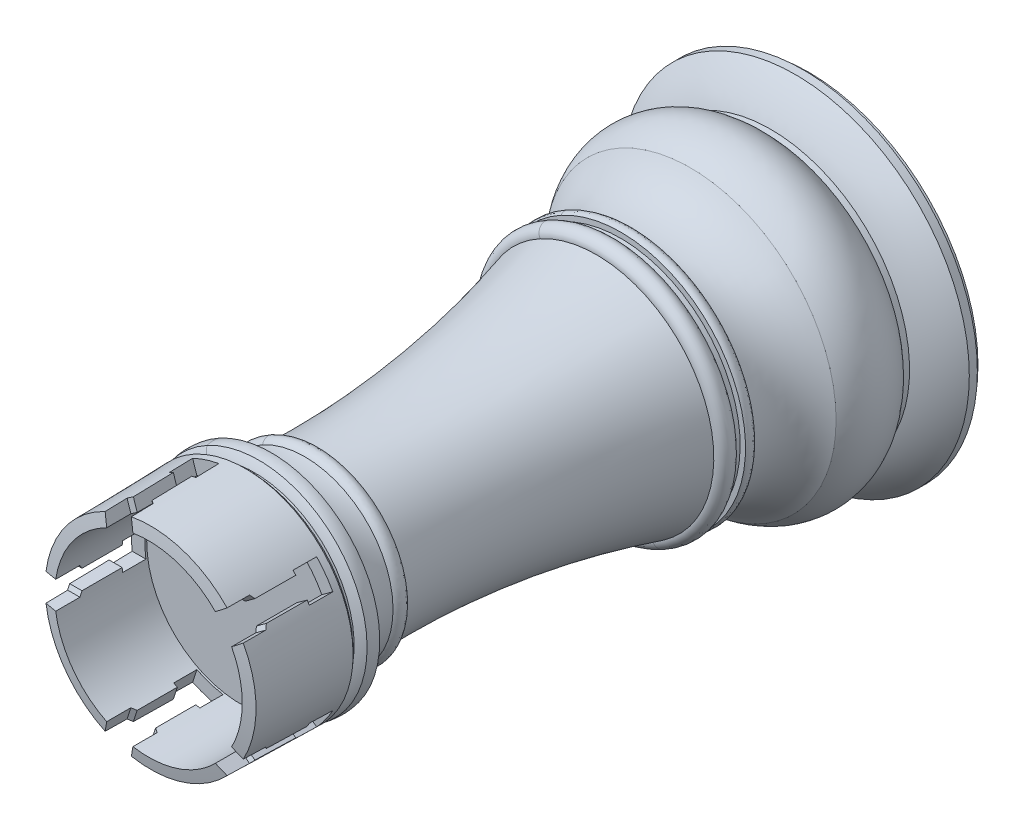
ISO-10303-21;
HEADER;
FILE_DESCRIPTION(('STEP AP214'),'2;1');
FILE_NAME('part.step','',(''),(''),'','','');
FILE_SCHEMA(('AUTOMOTIVE_DESIGN { 1 0 10303 214 1 1 1 1 }'));
ENDSEC;
DATA;
#1=APPLICATION_CONTEXT('core data for automotive mechanical design processes');
#2=APPLICATION_PROTOCOL_DEFINITION('international standard','automotive_design',2000,#1);
#3=PRODUCT_CONTEXT('',#1,'mechanical');
#4=PRODUCT('Part','Part','',(#3));
#5=PRODUCT_RELATED_PRODUCT_CATEGORY('part','',(#4));
#6=PRODUCT_DEFINITION_FORMATION('','',#4);
#7=PRODUCT_DEFINITION_CONTEXT('part definition',#1,'design');
#8=PRODUCT_DEFINITION('design','',#6,#7);
#9=PRODUCT_DEFINITION_SHAPE('','',#8);
#10=(LENGTH_UNIT() NAMED_UNIT(*) SI_UNIT(.MILLI.,.METRE.));
#11=(NAMED_UNIT(*) PLANE_ANGLE_UNIT() SI_UNIT($,.RADIAN.));
#12=(NAMED_UNIT(*) SI_UNIT($,.STERADIAN.) SOLID_ANGLE_UNIT());
#13=UNCERTAINTY_MEASURE_WITH_UNIT(LENGTH_MEASURE(1.E-05),#10,'distance_accuracy_value','');
#14=(GEOMETRIC_REPRESENTATION_CONTEXT(3) GLOBAL_UNCERTAINTY_ASSIGNED_CONTEXT((#13)) GLOBAL_UNIT_ASSIGNED_CONTEXT((#10,
#11,#12)) REPRESENTATION_CONTEXT('',''));
#15=CARTESIAN_POINT('',(0.,0.,0.));
#16=DIRECTION('',(0.,0.,1.));
#17=DIRECTION('',(1.,0.,0.));
#18=AXIS2_PLACEMENT_3D('',#15,#16,#17);
#19=CARTESIAN_POINT('',(0.,0.,42.5));
#20=DIRECTION('',(0.,0.,1.));
#21=DIRECTION('',(1.,0.,0.));
#22=AXIS2_PLACEMENT_3D('',#19,#20,#21);
#23=PLANE('',#22);
#24=CARTESIAN_POINT('',(0.,0.,42.5));
#25=DIRECTION('',(0.,0.,1.));
#26=DIRECTION('',(1.,0.,0.));
#27=AXIS2_PLACEMENT_3D('',#24,#25,#26);
#28=CIRCLE('',#27,6.518315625);
#29=CARTESIAN_POINT('',(6.518315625,0.,42.5));
#30=VERTEX_POINT('',#29);
#31=EDGE_CURVE('E472',#30,#30,#28,.T.);
#32=ORIENTED_EDGE('',*,*,#31,.T.);
#33=EDGE_LOOP('',(#32));
#34=FACE_BOUND('',#33,.T.);
#35=ADVANCED_FACE('F17',(#34),#23,.T.);
#36=CARTESIAN_POINT('',(0.,0.,42.5));
#37=DIRECTION('',(0.,0.,1.));
#38=DIRECTION('',(1.,0.,0.));
#39=AXIS2_PLACEMENT_3D('',#36,#37,#38);
#40=CYLINDRICAL_SURFACE('',#39,6.518315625);
#41=ORIENTED_EDGE('',*,*,#31,.F.);
#42=EDGE_LOOP('',(#41));
#43=FACE_BOUND('',#42,.T.);
#44=CARTESIAN_POINT('',(0.,0.,46.6073196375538));
#45=DIRECTION('',(-0.314968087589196,-0.433516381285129,-0.844309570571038));
#46=DIRECTION('',(-0.496272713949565,-0.683060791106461,0.535855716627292));
#47=AXIS2_PLACEMENT_3D('',#44,#45,#46);
#48=ELLIPSE('',#47,7.72029105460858,6.518315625);
#49=CARTESIAN_POINT('',(4.65293247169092,-4.56493789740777,47.2154497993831));
#50=VERTEX_POINT('',#49);
#51=CARTESIAN_POINT('',(4.84801427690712,-4.35720049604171,47.0360107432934));
#52=VERTEX_POINT('',#51);
#53=EDGE_CURVE('E2226',#50,#52,#48,.F.);
#54=ORIENTED_EDGE('',*,*,#53,.T.);
#55=DIRECTION('',(0.,0.,1.));
#56=VECTOR('',#55,1.);
#57=CARTESIAN_POINT('',(4.84801427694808,-4.35720049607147,0.));
#58=LINE('',#57,#56);
#59=CARTESIAN_POINT('',(4.84801427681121,-4.35720049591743,44.2410965));
#60=VERTEX_POINT('',#59);
#61=EDGE_CURVE('E712',#52,#60,#58,.F.);
#62=ORIENTED_EDGE('',*,*,#61,.T.);
#63=CARTESIAN_POINT('',(0.,0.,44.2410965));
#64=DIRECTION('',(0.,0.,1.));
#65=DIRECTION('',(1.,0.,0.));
#66=AXIS2_PLACEMENT_3D('',#63,#64,#65);
#67=CIRCLE('',#66,6.518315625);
#68=CARTESIAN_POINT('',(4.65293251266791,-4.5649378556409,44.2410965));
#69=VERTEX_POINT('',#68);
#70=EDGE_CURVE('E711',#60,#69,#67,.F.);
#71=ORIENTED_EDGE('',*,*,#70,.T.);
#72=DIRECTION('',(0.,0.,1.));
#73=VECTOR('',#72,1.);
#74=CARTESIAN_POINT('',(4.65293251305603,-4.56493785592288,0.));
#75=LINE('',#74,#73);
#76=CARTESIAN_POINT('',(4.65293242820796,-4.56493794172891,42.62926865));
#77=VERTEX_POINT('',#76);
#78=EDGE_CURVE('E708',#69,#77,#75,.F.);
#79=ORIENTED_EDGE('',*,*,#78,.T.);
#80=CARTESIAN_POINT('',(0.,0.,42.62926865));
#81=DIRECTION('',(0.,0.,1.));
#82=DIRECTION('',(1.,0.,0.));
#83=AXIS2_PLACEMENT_3D('',#80,#81,#82);
#84=CIRCLE('',#83,6.518315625);
#85=CARTESIAN_POINT('',(5.77934911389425,-3.0145584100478,42.62926865));
#86=VERTEX_POINT('',#85);
#87=EDGE_CURVE('E707',#77,#86,#84,.T.);
#88=ORIENTED_EDGE('',*,*,#87,.T.);
#89=DIRECTION('',(0.,0.,1.));
#90=VECTOR('',#89,1.);
#91=CARTESIAN_POINT('',(5.77934911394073,-3.01455841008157,0.));
#92=LINE('',#91,#90);
#93=CARTESIAN_POINT('',(5.7793491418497,-3.01455835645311,44.2410965));
#94=VERTEX_POINT('',#93);
#95=EDGE_CURVE('E704',#86,#94,#92,.T.);
#96=ORIENTED_EDGE('',*,*,#95,.T.);
#97=CARTESIAN_POINT('',(0.,0.,44.2410965));
#98=DIRECTION('',(0.,0.,1.));
#99=DIRECTION('',(1.,0.,0.));
#100=AXIS2_PLACEMENT_3D('',#97,#98,#99);
#101=CIRCLE('',#100,6.518315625);
#102=CARTESIAN_POINT('',(5.64206272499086,-3.26428656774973,44.2410965));
#103=VERTEX_POINT('',#102);
#104=EDGE_CURVE('E2234',#94,#103,#101,.F.);
#105=ORIENTED_EDGE('',*,*,#104,.T.);
#106=DIRECTION('',(0.,0.,1.));
#107=VECTOR('',#106,1.);
#108=CARTESIAN_POINT('',(5.64206272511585,-3.26428656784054,0.));
#109=LINE('',#108,#107);
#110=CARTESIAN_POINT('',(5.64206272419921,-3.26428656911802,47.036010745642));
#111=VERTEX_POINT('',#110);
#112=EDGE_CURVE('E700',#103,#111,#109,.T.);
#113=ORIENTED_EDGE('',*,*,#112,.T.);
#114=CARTESIAN_POINT('',(0.,0.,46.6073196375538));
#115=DIRECTION('',(-0.314968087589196,-0.433516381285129,0.844309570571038));
#116=DIRECTION('',(0.496272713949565,0.683060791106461,0.535855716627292));
#117=AXIS2_PLACEMENT_3D('',#114,#115,#116);
#118=ELLIPSE('',#117,7.72029105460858,6.518315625);
#119=CARTESIAN_POINT('',(5.77934911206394,-3.014558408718,47.2154497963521));
#120=VERTEX_POINT('',#119);
#121=EDGE_CURVE('E2236',#111,#120,#118,.T.);
#122=ORIENTED_EDGE('',*,*,#121,.T.);
#123=DIRECTION('',(0.,0.,1.));
#124=VECTOR('',#123,1.);
#125=CARTESIAN_POINT('',(5.77934911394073,-3.01455841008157,0.));
#126=LINE('',#125,#124);
#127=CARTESIAN_POINT('',(5.7793491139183,-3.01455841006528,48.8983114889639));
#128=VERTEX_POINT('',#127);
#129=EDGE_CURVE('E2242',#120,#128,#126,.T.);
#130=ORIENTED_EDGE('',*,*,#129,.T.);
#131=CARTESIAN_POINT('',(0.,0.,48.8983114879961));
#132=DIRECTION('',(0.,0.,1.));
#133=DIRECTION('',(0.,1.,0.));
#134=AXIS2_PLACEMENT_3D('',#131,#132,#133);
#135=CIRCLE('',#134,6.51831562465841);
#136=CARTESIAN_POINT('',(5.77934911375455,3.0145584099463,48.8983114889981));
#137=VERTEX_POINT('',#136);
#138=EDGE_CURVE('E920',#128,#137,#135,.T.);
#139=ORIENTED_EDGE('',*,*,#138,.T.);
#140=DIRECTION('',(0.,0.,1.));
#141=VECTOR('',#140,1.);
#142=CARTESIAN_POINT('',(5.77934911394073,3.01455841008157,0.));
#143=LINE('',#142,#141);
#144=CARTESIAN_POINT('',(5.77934914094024,3.01455835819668,47.2154497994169));
#145=VERTEX_POINT('',#144);
#146=EDGE_CURVE('E911',#137,#145,#143,.F.);
#147=ORIENTED_EDGE('',*,*,#146,.T.);
#148=CARTESIAN_POINT('',(0.,0.,46.6073196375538));
#149=DIRECTION('',(0.314968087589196,-0.433516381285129,-0.844309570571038));
#150=DIRECTION('',(0.496272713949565,-0.683060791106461,0.535855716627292));
#151=AXIS2_PLACEMENT_3D('',#148,#149,#150);
#152=ELLIPSE('',#151,7.72029105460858,6.518315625);
#153=CARTESIAN_POINT('',(5.64206272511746,3.26428656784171,47.03601074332));
#154=VERTEX_POINT('',#153);
#155=EDGE_CURVE('E908',#145,#154,#152,.F.);
#156=ORIENTED_EDGE('',*,*,#155,.T.);
#157=DIRECTION('',(0.,0.,1.));
#158=VECTOR('',#157,1.);
#159=CARTESIAN_POINT('',(5.64206272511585,3.26428656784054,0.));
#160=LINE('',#159,#158);
#161=CARTESIAN_POINT('',(5.64206272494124,3.26428656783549,44.2410965));
#162=VERTEX_POINT('',#161);
#163=EDGE_CURVE('E696',#154,#162,#160,.F.);
#164=ORIENTED_EDGE('',*,*,#163,.T.);
#165=CARTESIAN_POINT('',(0.,0.,44.2410965));
#166=DIRECTION('',(0.,0.,1.));
#167=DIRECTION('',(1.,0.,0.));
#168=AXIS2_PLACEMENT_3D('',#165,#166,#167);
#169=CIRCLE('',#168,6.518315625);
#170=CARTESIAN_POINT('',(5.77934911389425,3.0145584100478,44.2410965));
#171=VERTEX_POINT('',#170);
#172=EDGE_CURVE('E695',#162,#171,#169,.F.);
#173=ORIENTED_EDGE('',*,*,#172,.T.);
#174=DIRECTION('',(0.,0.,1.));
#175=VECTOR('',#174,1.);
#176=CARTESIAN_POINT('',(5.77934911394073,3.01455841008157,0.));
#177=LINE('',#176,#175);
#178=CARTESIAN_POINT('',(5.77934916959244,3.01455830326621,42.62926865));
#179=VERTEX_POINT('',#178);
#180=EDGE_CURVE('E692',#171,#179,#177,.F.);
#181=ORIENTED_EDGE('',*,*,#180,.T.);
#182=CARTESIAN_POINT('',(0.,0.,42.62926865));
#183=DIRECTION('',(0.,0.,1.));
#184=DIRECTION('',(1.,0.,0.));
#185=AXIS2_PLACEMENT_3D('',#182,#183,#184);
#186=CIRCLE('',#185,6.518315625);
#187=CARTESIAN_POINT('',(4.65293251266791,4.5649378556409,42.62926865));
#188=VERTEX_POINT('',#187);
#189=EDGE_CURVE('E691',#179,#188,#186,.T.);
#190=ORIENTED_EDGE('',*,*,#189,.T.);
#191=DIRECTION('',(0.,0.,1.));
#192=VECTOR('',#191,1.);
#193=CARTESIAN_POINT('',(4.65293251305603,4.56493785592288,0.));
#194=LINE('',#193,#192);
#195=CARTESIAN_POINT('',(4.65293247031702,4.56493789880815,44.2410965));
#196=VERTEX_POINT('',#195);
#197=EDGE_CURVE('E688',#188,#196,#194,.T.);
#198=ORIENTED_EDGE('',*,*,#197,.T.);
#199=CARTESIAN_POINT('',(0.,0.,44.2410965));
#200=DIRECTION('',(0.,0.,1.));
#201=DIRECTION('',(1.,0.,0.));
#202=AXIS2_PLACEMENT_3D('',#199,#200,#201);
#203=CIRCLE('',#202,6.518315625);
#204=CARTESIAN_POINT('',(4.84801427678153,4.35720049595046,44.2410965));
#205=VERTEX_POINT('',#204);
#206=EDGE_CURVE('E900',#196,#205,#203,.F.);
#207=ORIENTED_EDGE('',*,*,#206,.T.);
#208=DIRECTION('',(0.,0.,1.));
#209=VECTOR('',#208,1.);
#210=CARTESIAN_POINT('',(4.84801427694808,4.35720049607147,0.));
#211=LINE('',#210,#209);
#212=CARTESIAN_POINT('',(4.84801427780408,4.35720049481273,47.0360107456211));
#213=VERTEX_POINT('',#212);
#214=EDGE_CURVE('E684',#205,#213,#211,.T.);
#215=ORIENTED_EDGE('',*,*,#214,.T.);
#216=CARTESIAN_POINT('',(0.,0.,46.6073196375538));
#217=DIRECTION('',(0.314968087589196,-0.433516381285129,0.844309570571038));
#218=DIRECTION('',(-0.496272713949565,0.683060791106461,0.535855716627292));
#219=AXIS2_PLACEMENT_3D('',#216,#217,#218);
#220=ELLIPSE('',#219,7.72029105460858,6.518315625);
#221=CARTESIAN_POINT('',(4.65293251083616,4.56493785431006,47.2154497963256));
#222=VERTEX_POINT('',#221);
#223=EDGE_CURVE('E898',#213,#222,#220,.T.);
#224=ORIENTED_EDGE('',*,*,#223,.T.);
#225=DIRECTION('',(0.,0.,1.));
#226=VECTOR('',#225,1.);
#227=CARTESIAN_POINT('',(4.65293251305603,4.56493785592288,0.));
#228=LINE('',#227,#226);
#229=CARTESIAN_POINT('',(4.65293251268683,4.56493785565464,48.898311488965));
#230=VERTEX_POINT('',#229);
#231=EDGE_CURVE('E883',#222,#230,#228,.T.);
#232=ORIENTED_EDGE('',*,*,#231,.T.);
#233=CARTESIAN_POINT('',(0.,0.,48.89831148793));
#234=DIRECTION('',(0.,0.,1.));
#235=DIRECTION('',(0.,1.,0.));
#236=AXIS2_PLACEMENT_3D('',#233,#234,#235);
#237=CIRCLE('',#236,6.51831562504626);
#238=CARTESIAN_POINT('',(-1.08109832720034,6.42803741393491,48.898311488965));
#239=VERTEX_POINT('',#238);
#240=EDGE_CURVE('E873',#230,#239,#237,.T.);
#241=ORIENTED_EDGE('',*,*,#240,.T.);
#242=DIRECTION('',(0.,0.,1.));
#243=VECTOR('',#242,1.);
#244=CARTESIAN_POINT('',(-1.08109832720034,6.42803741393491,0.));
#245=LINE('',#244,#243);
#246=CARTESIAN_POINT('',(-1.08109826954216,6.42803742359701,47.2154497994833));
#247=VERTEX_POINT('',#246);
#248=EDGE_CURVE('E657',#239,#247,#245,.F.);
#249=ORIENTED_EDGE('',*,*,#248,.T.);
#250=CARTESIAN_POINT('',(0.,0.,46.6073196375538));
#251=DIRECTION('',(0.509629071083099,0.165588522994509,-0.844309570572));
#252=DIRECTION('',(0.802986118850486,0.260906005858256,0.535855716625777));
#253=AXIS2_PLACEMENT_3D('',#250,#251,#252);
#254=ELLIPSE('',#253,7.72029105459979,6.518315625);
#255=CARTESIAN_POINT('',(-1.36102774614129,6.37464054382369,47.0360107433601));
#256=VERTEX_POINT('',#255);
#257=EDGE_CURVE('E656',#247,#256,#254,.F.);
#258=ORIENTED_EDGE('',*,*,#257,.T.);
#259=DIRECTION('',(0.,0.,1.));
#260=VECTOR('',#259,1.);
#261=CARTESIAN_POINT('',(-1.36102774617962,6.37464054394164,0.));
#262=LINE('',#261,#260);
#263=CARTESIAN_POINT('',(-1.36102774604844,6.37464054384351,44.2410965));
#264=VERTEX_POINT('',#263);
#265=EDGE_CURVE('E652',#256,#264,#262,.F.);
#266=ORIENTED_EDGE('',*,*,#265,.T.);
#267=CARTESIAN_POINT('',(0.,0.,44.2410965));
#268=DIRECTION('',(0.,0.,1.));
#269=DIRECTION('',(1.,0.,0.));
#270=AXIS2_PLACEMENT_3D('',#267,#268,#269);
#271=CIRCLE('',#270,6.518315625);
#272=CARTESIAN_POINT('',(-1.08109832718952,6.4280374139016,44.2410965));
#273=VERTEX_POINT('',#272);
#274=EDGE_CURVE('E648',#264,#273,#271,.F.);
#275=ORIENTED_EDGE('',*,*,#274,.T.);
#276=DIRECTION('',(0.,0.,1.));
#277=VECTOR('',#276,1.);
#278=CARTESIAN_POINT('',(-1.08109832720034,6.42803741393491,0.));
#279=LINE('',#278,#277);
#280=CARTESIAN_POINT('',(-1.08109820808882,6.42803743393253,42.62926865));
#281=VERTEX_POINT('',#280);
#282=EDGE_CURVE('E644',#273,#281,#279,.F.);
#283=ORIENTED_EDGE('',*,*,#282,.T.);
#284=CARTESIAN_POINT('',(0.,0.,42.62926865));
#285=DIRECTION('',(0.,0.,1.));
#286=DIRECTION('',(1.,0.,0.));
#287=AXIS2_PLACEMENT_3D('',#284,#285,#286);
#288=CIRCLE('',#287,6.518315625);
#289=CARTESIAN_POINT('',(-2.90367867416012,5.835845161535,42.62926865));
#290=VERTEX_POINT('',#289);
#291=EDGE_CURVE('E630',#281,#290,#288,.T.);
#292=ORIENTED_EDGE('',*,*,#291,.T.);
#293=DIRECTION('',(0.,0.,1.));
#294=VECTOR('',#293,1.);
#295=CARTESIAN_POINT('',(-2.90367867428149,5.83584516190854,0.));
#296=LINE('',#295,#294);
#297=CARTESIAN_POINT('',(-2.90367872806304,5.83584513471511,44.2410965));
#298=VERTEX_POINT('',#297);
#299=EDGE_CURVE('E627',#290,#298,#296,.T.);
#300=ORIENTED_EDGE('',*,*,#299,.T.);
#301=CARTESIAN_POINT('',(0.,0.,44.2410965));
#302=DIRECTION('',(0.,0.,1.));
#303=DIRECTION('',(1.,0.,0.));
#304=AXIS2_PLACEMENT_3D('',#301,#302,#303);
#305=CIRCLE('',#304,6.518315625);
#306=CARTESIAN_POINT('',(-2.64582512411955,5.9571845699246,44.2410965));
#307=VERTEX_POINT('',#306);
#308=EDGE_CURVE('E2004',#298,#307,#305,.F.);
#309=ORIENTED_EDGE('',*,*,#308,.T.);
#310=DIRECTION('',(0.,0.,1.));
#311=VECTOR('',#310,1.);
#312=CARTESIAN_POINT('',(-2.6458251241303,5.95718456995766,0.));
#313=LINE('',#312,#311);
#314=CARTESIAN_POINT('',(-2.64582512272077,5.95718457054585,47.0360107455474));
#315=VERTEX_POINT('',#314);
#316=EDGE_CURVE('E716',#307,#315,#313,.T.);
#317=ORIENTED_EDGE('',*,*,#316,.T.);
#318=CARTESIAN_POINT('',(0.,0.,46.6073196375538));
#319=DIRECTION('',(0.509629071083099,0.165588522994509,0.844309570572));
#320=DIRECTION('',(-0.802986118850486,-0.260906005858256,0.535855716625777));
#321=AXIS2_PLACEMENT_3D('',#318,#319,#320);
#322=ELLIPSE('',#321,7.72029105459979,6.518315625);
#323=CARTESIAN_POINT('',(-2.90367867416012,5.835845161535,47.21544979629));
#324=VERTEX_POINT('',#323);
#325=EDGE_CURVE('E2006',#315,#324,#322,.T.);
#326=ORIENTED_EDGE('',*,*,#325,.T.);
#327=DIRECTION('',(0.,0.,1.));
#328=VECTOR('',#327,1.);
#329=CARTESIAN_POINT('',(-2.90367867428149,5.83584516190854,0.));
#330=LINE('',#329,#328);
#331=CARTESIAN_POINT('',(-2.90367867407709,5.83584516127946,48.8983114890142));
#332=VERTEX_POINT('',#331);
#333=EDGE_CURVE('E2016',#324,#332,#330,.T.);
#334=ORIENTED_EDGE('',*,*,#333,.T.);
#335=CARTESIAN_POINT('',(0.,0.,48.8983114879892));
#336=DIRECTION('',(0.,0.,1.));
#337=DIRECTION('',(0.,1.,0.));
#338=AXIS2_PLACEMENT_3D('',#335,#336,#337);
#339=CIRCLE('',#338,6.51831562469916);
#340=CARTESIAN_POINT('',(-6.44750462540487,0.9581871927,48.8983114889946));
#341=VERTEX_POINT('',#340);
#342=EDGE_CURVE('E2035',#332,#341,#339,.T.);
#343=ORIENTED_EDGE('',*,*,#342,.T.);
#344=DIRECTION('',(0.,0.,1.));
#345=VECTOR('',#344,1.);
#346=CARTESIAN_POINT('',(-6.447504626,0.9581871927,0.));
#347=LINE('',#346,#345);
#348=CARTESIAN_POINT('',(-6.44750461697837,0.958187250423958,47.2154497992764));
#349=VERTEX_POINT('',#348);
#350=EDGE_CURVE('E504',#341,#349,#347,.F.);
#351=ORIENTED_EDGE('',*,*,#350,.T.);
#352=CARTESIAN_POINT('',(0.,0.,46.6073196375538));
#353=DIRECTION('',(0.,0.535855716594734,-0.844309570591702));
#354=DIRECTION('',(0.,0.844309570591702,0.535855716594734));
#355=AXIS2_PLACEMENT_3D('',#352,#353,#354);
#356=ELLIPSE('',#355,7.72029105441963,6.518315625);
#357=CARTESIAN_POINT('',(-6.48322413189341,0.6754579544,47.0360107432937));
#358=VERTEX_POINT('',#357);
#359=EDGE_CURVE('E479',#349,#358,#356,.F.);
#360=ORIENTED_EDGE('',*,*,#359,.T.);
#361=DIRECTION('',(0.,0.,1.));
#362=VECTOR('',#361,1.);
#363=CARTESIAN_POINT('',(-6.483224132,0.6754579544,0.));
#364=LINE('',#363,#362);
#365=CARTESIAN_POINT('',(-6.48322413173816,0.6754579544,44.2410965));
#366=VERTEX_POINT('',#365);
#367=EDGE_CURVE('E475',#358,#366,#364,.F.);
#368=ORIENTED_EDGE('',*,*,#367,.T.);
#369=CARTESIAN_POINT('',(0.,0.,44.2410965));
#370=DIRECTION('',(0.,0.,1.));
#371=DIRECTION('',(1.,0.,0.));
#372=AXIS2_PLACEMENT_3D('',#369,#370,#371);
#373=CIRCLE('',#372,6.518315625);
#374=CARTESIAN_POINT('',(-6.44750460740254,0.958187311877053,44.2410965));
#375=VERTEX_POINT('',#374);
#376=EDGE_CURVE('E20',#375,#366,#373,.T.);
#377=ORIENTED_EDGE('',*,*,#376,.F.);
#378=DIRECTION('',(0.,0.,-1.));
#379=VECTOR('',#378,1.);
#380=CARTESIAN_POINT('',(-6.4475045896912,0.958187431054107,45.699155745));
#381=LINE('',#380,#379);
#382=CARTESIAN_POINT('',(-6.44750458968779,0.958187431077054,42.62926865));
#383=VERTEX_POINT('',#382);
#384=EDGE_CURVE('E473',#383,#375,#381,.F.);
#385=ORIENTED_EDGE('',*,*,#384,.F.);
#386=CARTESIAN_POINT('',(0.,0.,42.62926865));
#387=DIRECTION('',(0.,0.,1.));
#388=DIRECTION('',(1.,0.,0.));
#389=AXIS2_PLACEMENT_3D('',#386,#387,#388);
#390=CIRCLE('',#389,6.518315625);
#391=CARTESIAN_POINT('',(-6.44750462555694,-0.9581871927,42.62926865));
#392=VERTEX_POINT('',#391);
#393=EDGE_CURVE('E490',#383,#392,#390,.T.);
#394=ORIENTED_EDGE('',*,*,#393,.T.);
#395=DIRECTION('',(0.,0.,-1.));
#396=VECTOR('',#395,1.);
#397=CARTESIAN_POINT('',(-6.447504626,-0.9581871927,0.));
#398=LINE('',#397,#396);
#399=CARTESIAN_POINT('',(-6.44750461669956,-0.9581872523,44.2410965));
#400=VERTEX_POINT('',#399);
#401=EDGE_CURVE('E664',#392,#400,#398,.F.);
#402=ORIENTED_EDGE('',*,*,#401,.T.);
#403=CARTESIAN_POINT('',(0.,0.,44.2410965));
#404=DIRECTION('',(0.,0.,1.));
#405=DIRECTION('',(1.,0.,0.));
#406=AXIS2_PLACEMENT_3D('',#403,#404,#405);
#407=CIRCLE('',#406,6.518315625);
#408=CARTESIAN_POINT('',(-6.48322413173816,-0.6754579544,44.2410965));
#409=VERTEX_POINT('',#408);
#410=EDGE_CURVE('E2132',#400,#409,#407,.F.);
#411=ORIENTED_EDGE('',*,*,#410,.T.);
#412=DIRECTION('',(0.,0.,1.));
#413=VECTOR('',#412,1.);
#414=CARTESIAN_POINT('',(-6.483224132,-0.6754579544,0.));
#415=LINE('',#414,#413);
#416=CARTESIAN_POINT('',(-6.48322413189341,-0.675457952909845,47.0360107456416));
#417=VERTEX_POINT('',#416);
#418=EDGE_CURVE('E660',#409,#417,#415,.T.);
#419=ORIENTED_EDGE('',*,*,#418,.T.);
#420=CARTESIAN_POINT('',(0.,0.,46.6073196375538));
#421=DIRECTION('',(0.,0.535855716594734,0.844309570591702));
#422=DIRECTION('',(0.,-0.844309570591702,0.535855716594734));
#423=AXIS2_PLACEMENT_3D('',#420,#421,#422);
#424=ELLIPSE('',#423,7.72029105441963,6.518315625);
#425=CARTESIAN_POINT('',(-6.44750462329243,-0.9581871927,47.2154497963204));
#426=VERTEX_POINT('',#425);
#427=EDGE_CURVE('E2134',#417,#426,#424,.T.);
#428=ORIENTED_EDGE('',*,*,#427,.T.);
#429=DIRECTION('',(0.,0.,-1.));
#430=VECTOR('',#429,1.);
#431=CARTESIAN_POINT('',(-6.447504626,-0.9581871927,0.));
#432=LINE('',#431,#430);
#433=CARTESIAN_POINT('',(-6.44750462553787,-0.9581871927,48.8983114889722));
#434=VERTEX_POINT('',#433);
#435=EDGE_CURVE('E2139',#426,#434,#432,.F.);
#436=ORIENTED_EDGE('',*,*,#435,.T.);
#437=CARTESIAN_POINT('',(0.,0.,48.8983114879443));
#438=DIRECTION('',(0.,0.,1.));
#439=DIRECTION('',(0.,1.,0.));
#440=AXIS2_PLACEMENT_3D('',#437,#438,#439);
#441=CIRCLE('',#440,6.51831562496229);
#442=CARTESIAN_POINT('',(-2.90367867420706,-5.83584516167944,48.8983114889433));
#443=VERTEX_POINT('',#442);
#444=EDGE_CURVE('E842',#434,#443,#441,.T.);
#445=ORIENTED_EDGE('',*,*,#444,.T.);
#446=DIRECTION('',(0.,0.,1.));
#447=VECTOR('',#446,1.);
#448=CARTESIAN_POINT('',(-2.90367867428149,-5.83584516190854,0.));
#449=LINE('',#448,#447);
#450=CARTESIAN_POINT('',(-2.90367872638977,-5.83584513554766,47.2154497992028));
#451=VERTEX_POINT('',#450);
#452=EDGE_CURVE('E871',#443,#451,#449,.F.);
#453=ORIENTED_EDGE('',*,*,#452,.T.);
#454=CARTESIAN_POINT('',(0.,0.,46.6073196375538));
#455=DIRECTION('',(-0.509629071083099,0.165588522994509,-0.844309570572));
#456=DIRECTION('',(-0.802986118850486,0.260906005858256,0.535855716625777));
#457=AXIS2_PLACEMENT_3D('',#454,#455,#456);
#458=ELLIPSE('',#457,7.72029105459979,6.518315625);
#459=CARTESIAN_POINT('',(-2.64582512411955,-5.9571845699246,47.0360107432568));
#460=VERTEX_POINT('',#459);
#461=EDGE_CURVE('E2109',#451,#460,#458,.F.);
#462=ORIENTED_EDGE('',*,*,#461,.T.);
#463=DIRECTION('',(0.,0.,1.));
#464=VECTOR('',#463,1.);
#465=CARTESIAN_POINT('',(-2.6458251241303,-5.95718456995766,0.));
#466=LINE('',#465,#464);
#467=CARTESIAN_POINT('',(-2.64582512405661,-5.95718456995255,44.2410965));
#468=VERTEX_POINT('',#467);
#469=EDGE_CURVE('E680',#460,#468,#466,.F.);
#470=ORIENTED_EDGE('',*,*,#469,.T.);
#471=CARTESIAN_POINT('',(0.,0.,44.2410965));
#472=DIRECTION('',(0.,0.,1.));
#473=DIRECTION('',(1.,0.,0.));
#474=AXIS2_PLACEMENT_3D('',#471,#472,#473);
#475=CIRCLE('',#474,6.518315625);
#476=CARTESIAN_POINT('',(-2.90367867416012,-5.835845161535,44.2410965));
#477=VERTEX_POINT('',#476);
#478=EDGE_CURVE('E679',#468,#477,#475,.F.);
#479=ORIENTED_EDGE('',*,*,#478,.T.);
#480=DIRECTION('',(0.,0.,1.));
#481=VECTOR('',#480,1.);
#482=CARTESIAN_POINT('',(-2.90367867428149,-5.83584516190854,0.));
#483=LINE('',#482,#481);
#484=CARTESIAN_POINT('',(-2.9036787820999,-5.83584510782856,42.62926865));
#485=VERTEX_POINT('',#484);
#486=EDGE_CURVE('E676',#477,#485,#483,.F.);
#487=ORIENTED_EDGE('',*,*,#486,.T.);
#488=CARTESIAN_POINT('',(0.,0.,42.62926865));
#489=DIRECTION('',(0.,0.,1.));
#490=DIRECTION('',(1.,0.,0.));
#491=AXIS2_PLACEMENT_3D('',#488,#489,#490);
#492=CIRCLE('',#491,6.518315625);
#493=CARTESIAN_POINT('',(-1.08109832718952,-6.4280374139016,42.62926865));
#494=VERTEX_POINT('',#493);
#495=EDGE_CURVE('E675',#485,#494,#492,.T.);
#496=ORIENTED_EDGE('',*,*,#495,.T.);
#497=DIRECTION('',(0.,0.,1.));
#498=VECTOR('',#497,1.);
#499=CARTESIAN_POINT('',(-1.08109832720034,-6.42803741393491,0.));
#500=LINE('',#499,#498);
#501=CARTESIAN_POINT('',(-1.08109826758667,-6.42803742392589,44.2410965));
#502=VERTEX_POINT('',#501);
#503=EDGE_CURVE('E672',#494,#502,#500,.T.);
#504=ORIENTED_EDGE('',*,*,#503,.T.);
#505=CARTESIAN_POINT('',(0.,0.,44.2410965));
#506=DIRECTION('',(0.,0.,1.));
#507=DIRECTION('',(1.,0.,0.));
#508=AXIS2_PLACEMENT_3D('',#505,#506,#507);
#509=CIRCLE('',#508,6.518315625);
#510=CARTESIAN_POINT('',(-1.36102774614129,-6.37464054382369,44.2410965));
#511=VERTEX_POINT('',#510);
#512=EDGE_CURVE('E2077',#502,#511,#509,.F.);
#513=ORIENTED_EDGE('',*,*,#512,.T.);
#514=DIRECTION('',(0.,0.,1.));
#515=VECTOR('',#514,1.);
#516=CARTESIAN_POINT('',(-1.36102774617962,-6.37464054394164,0.));
#517=LINE('',#516,#515);
#518=CARTESIAN_POINT('',(-1.36102774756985,-6.37464054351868,47.0360107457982));
#519=VERTEX_POINT('',#518);
#520=EDGE_CURVE('E668',#511,#519,#517,.T.);
#521=ORIENTED_EDGE('',*,*,#520,.T.);
#522=CARTESIAN_POINT('',(0.,0.,46.6073196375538));
#523=DIRECTION('',(-0.509629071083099,0.165588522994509,0.844309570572));
#524=DIRECTION('',(0.802986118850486,-0.260906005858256,0.535855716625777));
#525=AXIS2_PLACEMENT_3D('',#522,#523,#524);
#526=ELLIPSE('',#525,7.72029105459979,6.518315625);
#527=CARTESIAN_POINT('',(-1.08109832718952,-6.4280374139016,47.2154497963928));
#528=VERTEX_POINT('',#527);
#529=EDGE_CURVE('E2072',#519,#528,#526,.T.);
#530=ORIENTED_EDGE('',*,*,#529,.T.);
#531=DIRECTION('',(0.,0.,1.));
#532=VECTOR('',#531,1.);
#533=CARTESIAN_POINT('',(-1.08109832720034,-6.42803741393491,0.));
#534=LINE('',#533,#532);
#535=CARTESIAN_POINT('',(-1.08109832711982,-6.4280374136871,48.898311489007));
#536=VERTEX_POINT('',#535);
#537=EDGE_CURVE('E2056',#528,#536,#534,.T.);
#538=ORIENTED_EDGE('',*,*,#537,.T.);
#539=CARTESIAN_POINT('',(0.,0.,48.8983114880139));
#540=DIRECTION('',(0.,0.,1.));
#541=DIRECTION('',(0.,1.,0.));
#542=AXIS2_PLACEMENT_3D('',#539,#540,#541);
#543=CIRCLE('',#542,6.51831562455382);
#544=CARTESIAN_POINT('',(4.65293251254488,-4.56493785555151,48.8983114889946));
#545=VERTEX_POINT('',#544);
#546=EDGE_CURVE('E2051',#536,#545,#543,.T.);
#547=ORIENTED_EDGE('',*,*,#546,.T.);
#548=DIRECTION('',(0.,0.,1.));
#549=VECTOR('',#548,1.);
#550=CARTESIAN_POINT('',(4.65293251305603,-4.56493785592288,0.));
#551=LINE('',#550,#549);
#552=EDGE_CURVE('E2225',#545,#50,#551,.F.);
#553=ORIENTED_EDGE('',*,*,#552,.T.);
#554=EDGE_LOOP('',(#54,#62,#71,#79,#88,#96,#105,#113,#122,#130,#139,#147,#156,#164,#173,#181,
#190,#198,#207,#215,#224,#232,#241,#249,#258,#266,#275,#283,#292,#300,#309,#317,#326,#334,#343,
#351,#360,#368,#377,#385,#394,#402,#411,#419,#428,#436,#445,#453,#462,#470,#479,#487,#496,#504,
#513,#521,#530,#538,#547,#553));
#555=FACE_BOUND('',#554,.T.);
#556=ADVANCED_FACE('F477',(#43,#555),#40,.F.);
#557=CARTESIAN_POINT('',(0.911290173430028,0.296096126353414,0.));
#558=DIRECTION('',(0.951056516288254,0.309016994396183,0.));
#559=DIRECTION('',(-0.309016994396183,0.951056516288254,0.));
#560=AXIS2_PLACEMENT_3D('',#557,#558,#559);
#561=PLANE('',#560);
#562=CARTESIAN_POINT('',(-1.08109832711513,6.42803741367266,48.8983114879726));
#563=CARTESIAN_POINT('',(-1.12344360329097,6.55836277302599,48.875206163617));
#564=CARTESIAN_POINT('',(-1.16575115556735,6.68857203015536,48.8513811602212));
#565=CARTESIAN_POINT('',(-1.22915473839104,6.88370819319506,48.8145649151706));
#566=CARTESIAN_POINT('',(-1.25028069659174,6.94872720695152,48.8021123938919));
#567=CARTESIAN_POINT('',(-1.29251269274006,7.07870392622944,48.776848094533));
#568=CARTESIAN_POINT('',(-1.313618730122,7.14366163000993,48.7640363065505));
#569=CARTESIAN_POINT('',(-1.3347142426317,7.20858694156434,48.7510452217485));
#570=B_SPLINE_CURVE_WITH_KNOTS('',3,(#562,#563,#564,#565,#566,#567,#568,#569),.UNSPECIFIED.,.F.,
.F.,(4,2,2,4),(0.,0.416895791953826,0.625364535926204,0.833839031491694),.UNSPECIFIED.);
#571=CARTESIAN_POINT('',(-1.33471424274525,7.20858694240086,48.7510452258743));
#572=VERTEX_POINT('',#571);
#573=EDGE_CURVE('E878',#239,#572,#570,.T.);
#574=ORIENTED_EDGE('',*,*,#573,.T.);
#575=CARTESIAN_POINT('',(-1.3347142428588,7.20858694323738,48.75104523));
#576=CARTESIAN_POINT('',(-1.33512834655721,7.2098638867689,48.6870620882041));
#577=CARTESIAN_POINT('',(-1.3355425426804,7.21114080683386,48.6230789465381));
#578=CARTESIAN_POINT('',(-1.33637111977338,7.21369460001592,48.4951126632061));
#579=CARTESIAN_POINT('',(-1.33678550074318,7.21497147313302,48.43112952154));
#580=CARTESIAN_POINT('',(-1.3376144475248,7.21752517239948,48.303163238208));
#581=CARTESIAN_POINT('',(-1.33802901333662,7.21880199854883,48.239180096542));
#582=CARTESIAN_POINT('',(-1.33885832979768,7.22135560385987,48.1112138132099));
#583=CARTESIAN_POINT('',(-1.33927308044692,7.22263238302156,48.0472306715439));
#584=CARTESIAN_POINT('',(-1.34010276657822,7.22518589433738,47.9192643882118));
#585=CARTESIAN_POINT('',(-1.34051770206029,7.22646262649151,47.8552812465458));
#586=CARTESIAN_POINT('',(-1.34134775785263,7.22901604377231,47.7273149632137));
#587=CARTESIAN_POINT('',(-1.34176287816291,7.23029272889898,47.6633318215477));
#588=CARTESIAN_POINT('',(-1.34259330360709,7.23284605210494,47.5353655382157));
#589=CARTESIAN_POINT('',(-1.34300860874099,7.23412269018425,47.4713823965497));
#590=CARTESIAN_POINT('',(-1.34383940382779,7.23667591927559,47.3434161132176));
#591=CARTESIAN_POINT('',(-1.3442548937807,7.23795251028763,47.2794329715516));
#592=CARTESIAN_POINT('',(-1.34467047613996,7.23922907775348,47.2154498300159));
#593=B_SPLINE_CURVE_WITH_KNOTS('',3,(#575,#576,#577,#578,#579,#580,#581,#582,#583,#584,#585,
#586,#587,#588,#589,#590,#591,#592),.UNSPECIFIED.,.F.,.F.,(4,2,2,2,2,2,2,2,4),(0.,
0.191991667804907,0.383983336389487,0.575975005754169,0.767966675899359,0.959958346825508,
1.15195001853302,1.34394169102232,1.53593336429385),.UNSPECIFIED.);
#594=CARTESIAN_POINT('',(-1.3446703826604,7.23922909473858,47.2154498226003));
#595=VERTEX_POINT('',#594);
#596=EDGE_CURVE('E552',#572,#595,#593,.T.);
#597=ORIENTED_EDGE('',*,*,#596,.T.);
#598=DIRECTION('',(0.309016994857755,-0.95105651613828,2.92081353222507E-10));
#599=VECTOR('',#598,1.);
#600=CARTESIAN_POINT('',(-1.34467036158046,7.23922909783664,47.2154498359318));
#601=LINE('',#600,#599);
#602=EDGE_CURVE('E653',#595,#247,#601,.T.);
#603=ORIENTED_EDGE('',*,*,#602,.T.);
#604=ORIENTED_EDGE('',*,*,#248,.F.);
#605=EDGE_LOOP('',(#574,#597,#603,#604));
#606=FACE_BOUND('',#605,.T.);
#607=ADVANCED_FACE('F1975',(#606),#561,.F.);
#608=CARTESIAN_POINT('',(-20.0544166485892,-6.5160749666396,33.2244310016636));
#609=DIRECTION('',(0.509629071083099,0.165588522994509,-0.844309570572));
#610=DIRECTION('',(-0.856128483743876,0.,-0.516763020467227));
#611=AXIS2_PLACEMENT_3D('',#608,#609,#610);
#612=PLANE('',#611);
#613=CARTESIAN_POINT('',(-0.0926280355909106,-0.030096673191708,46.5455062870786));
#614=DIRECTION('',(0.509629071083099,0.165588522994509,-0.844309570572));
#615=DIRECTION('',(-0.802986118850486,-0.260906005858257,-0.535855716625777));
#616=AXIS2_PLACEMENT_3D('',#613,#614,#615);
#617=ELLIPSE('',#616,8.73730610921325,7.37634821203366);
#618=CARTESIAN_POINT('',(-1.62447457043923,7.18544649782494,47.0360107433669));
#619=VERTEX_POINT('',#618);
#620=EDGE_CURVE('E832',#595,#619,#617,.F.);
#621=ORIENTED_EDGE('',*,*,#620,.T.);
#622=DIRECTION('',(-0.309016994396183,0.951056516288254,0.));
#623=VECTOR('',#622,1.);
#624=CARTESIAN_POINT('',(0.64239868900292,0.208727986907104,47.03601074));
#625=LINE('',#624,#623);
#626=EDGE_CURVE('E649',#619,#256,#625,.F.);
#627=ORIENTED_EDGE('',*,*,#626,.T.);
#628=ORIENTED_EDGE('',*,*,#257,.F.);
#629=ORIENTED_EDGE('',*,*,#602,.F.);
#630=EDGE_LOOP('',(#621,#627,#628,#629));
#631=FACE_BOUND('',#630,.T.);
#632=ADVANCED_FACE('F1967',(#631),#612,.F.);
#633=CARTESIAN_POINT('',(0.64239868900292,0.208727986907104,0.));
#634=DIRECTION('',(0.951056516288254,0.309016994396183,0.));
#635=DIRECTION('',(-0.309016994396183,0.951056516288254,0.));
#636=AXIS2_PLACEMENT_3D('',#633,#634,#635);
#637=PLANE('',#636);
#638=DIRECTION('',(0.00645382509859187,-0.0198628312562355,0.999781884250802));
#639=VECTOR('',#638,1.);
#640=CARTESIAN_POINT('',(-1.64251639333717,7.24097351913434,44.2410965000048));
#641=LINE('',#640,#639);
#642=CARTESIAN_POINT('',(-1.64251639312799,7.24097351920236,44.2410965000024));
#643=VERTEX_POINT('',#642);
#644=EDGE_CURVE('E829',#619,#643,#641,.F.);
#645=ORIENTED_EDGE('',*,*,#644,.T.);
#646=DIRECTION('',(0.309016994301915,-0.951056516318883,0.));
#647=VECTOR('',#646,1.);
#648=CARTESIAN_POINT('',(-1.642516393,7.240973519,44.2410965));
#649=LINE('',#648,#647);
#650=EDGE_CURVE('E645',#643,#264,#649,.T.);
#651=ORIENTED_EDGE('',*,*,#650,.T.);
#652=ORIENTED_EDGE('',*,*,#265,.F.);
#653=ORIENTED_EDGE('',*,*,#626,.F.);
#654=EDGE_LOOP('',(#645,#651,#652,#653));
#655=FACE_BOUND('',#654,.T.);
#656=ADVANCED_FACE('F1959',(#655),#637,.F.);
#657=CARTESIAN_POINT('',(0.,0.,44.2410965));
#658=DIRECTION('',(0.,0.,-1.));
#659=DIRECTION('',(-1.,0.,0.));
#660=AXIS2_PLACEMENT_3D('',#657,#658,#659);
#661=PLANE('',#660);
#662=ORIENTED_EDGE('',*,*,#650,.F.);
#663=CARTESIAN_POINT('',(0.,0.,44.2410965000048));
#664=DIRECTION('',(0.,0.,-1.));
#665=DIRECTION('',(-1.,0.,0.));
#666=AXIS2_PLACEMENT_3D('',#663,#664,#665);
#667=CIRCLE('',#666,7.42492812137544);
#668=CARTESIAN_POINT('',(-1.36395297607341,7.29857451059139,44.2410964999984));
#669=VERTEX_POINT('',#668);
#670=EDGE_CURVE('E636',#643,#669,#667,.T.);
#671=ORIENTED_EDGE('',*,*,#670,.T.);
#672=DIRECTION('',(-0.309016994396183,0.951056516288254,0.));
#673=VECTOR('',#672,1.);
#674=CARTESIAN_POINT('',(0.911290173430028,0.296096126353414,44.2410965));
#675=LINE('',#674,#673);
#676=EDGE_CURVE('E631',#669,#273,#675,.F.);
#677=ORIENTED_EDGE('',*,*,#676,.T.);
#678=ORIENTED_EDGE('',*,*,#274,.F.);
#679=EDGE_LOOP('',(#662,#671,#677,#678));
#680=FACE_BOUND('',#679,.T.);
#681=ADVANCED_FACE('F1951',(#680),#661,.T.);
#682=CARTESIAN_POINT('',(0.911290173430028,0.296096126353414,0.));
#683=DIRECTION('',(0.951056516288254,0.309016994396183,0.));
#684=DIRECTION('',(-0.309016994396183,0.951056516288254,0.));
#685=AXIS2_PLACEMENT_3D('',#682,#683,#684);
#686=PLANE('',#685);
#687=CARTESIAN_POINT('',(-1.36395297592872,7.29857451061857,44.2410964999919));
#688=CARTESIAN_POINT('',(-1.36438752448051,7.29991455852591,44.173937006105));
#689=CARTESIAN_POINT('',(-1.36482217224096,7.30125458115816,44.1067775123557));
#690=CARTESIAN_POINT('',(-1.36569166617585,7.30393457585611,43.9724585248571));
#691=CARTESIAN_POINT('',(-1.3661265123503,7.30527454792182,43.9052990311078));
#692=CARTESIAN_POINT('',(-1.36699640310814,7.30795444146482,43.7709800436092));
#693=CARTESIAN_POINT('',(-1.36743144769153,7.30929436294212,43.7038205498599));
#694=CARTESIAN_POINT('',(-1.36830173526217,7.31197415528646,43.5695015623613));
#695=CARTESIAN_POINT('',(-1.36873697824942,7.31331402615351,43.502342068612));
#696=CARTESIAN_POINT('',(-1.36960766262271,7.3159937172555,43.3680230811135));
#697=CARTESIAN_POINT('',(-1.37004310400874,7.31733353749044,43.3008635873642));
#698=CARTESIAN_POINT('',(-1.37091418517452,7.32001312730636,43.1665445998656));
#699=CARTESIAN_POINT('',(-1.37134982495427,7.32135289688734,43.0993851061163));
#700=CARTESIAN_POINT('',(-1.37222130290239,7.3240323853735,42.9650661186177));
#701=CARTESIAN_POINT('',(-1.37265714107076,7.32537210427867,42.8979066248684));
#702=CARTESIAN_POINT('',(-1.37352901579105,7.32805149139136,42.7635876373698));
#703=CARTESIAN_POINT('',(-1.37396505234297,7.32939115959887,42.6964281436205));
#704=CARTESIAN_POINT('',(-1.37440118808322,7.33073080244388,42.6292686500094));
#705=B_SPLINE_CURVE_WITH_KNOTS('',3,(#687,#688,#689,#690,#691,#692,#693,#694,#695,#696,#697,
#698,#699,#700,#701,#702,#703,#704),.UNSPECIFIED.,.F.,.F.,(4,2,2,2,2,2,2,2,4),(0.,
0.201522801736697,0.403045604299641,0.604568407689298,0.806091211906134,1.00761401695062,
1.2091368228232,1.41065962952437,1.61218243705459),.UNSPECIFIED.);
#706=CARTESIAN_POINT('',(-1.37440106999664,7.33073082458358,42.6292686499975));
#707=VERTEX_POINT('',#706);
#708=EDGE_CURVE('E632',#669,#707,#705,.T.);
#709=ORIENTED_EDGE('',*,*,#708,.T.);
#710=DIRECTION('',(0.309016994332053,-0.951056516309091,0.));
#711=VECTOR('',#710,1.);
#712=CARTESIAN_POINT('',(-1.374400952,7.330730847,42.62926865));
#713=LINE('',#712,#711);
#714=EDGE_CURVE('E628',#707,#281,#713,.T.);
#715=ORIENTED_EDGE('',*,*,#714,.T.);
#716=ORIENTED_EDGE('',*,*,#282,.F.);
#717=ORIENTED_EDGE('',*,*,#676,.F.);
#718=EDGE_LOOP('',(#709,#715,#716,#717));
#719=FACE_BOUND('',#718,.T.);
#720=ADVANCED_FACE('F1943',(#719),#686,.F.);
#721=CARTESIAN_POINT('',(0.,0.,42.62926865));
#722=DIRECTION('',(0.,0.,1.));
#723=DIRECTION('',(1.,0.,0.));
#724=AXIS2_PLACEMENT_3D('',#721,#722,#723);
#725=PLANE('',#724);
#726=ORIENTED_EDGE('',*,*,#714,.F.);
#727=CARTESIAN_POINT('',(0.,0.,42.6292686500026));
#728=DIRECTION('',(0.,0.,-1.));
#729=DIRECTION('',(-1.,0.,0.));
#730=AXIS2_PLACEMENT_3D('',#727,#728,#729);
#731=CIRCLE('',#730,7.45845779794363);
#732=CARTESIAN_POINT('',(-3.19698153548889,6.73853854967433,42.6292686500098));
#733=VERTEX_POINT('',#732);
#734=EDGE_CURVE('E616',#707,#733,#731,.F.);
#735=ORIENTED_EDGE('',*,*,#734,.T.);
#736=DIRECTION('',(0.309016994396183,-0.951056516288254,0.));
#737=VECTOR('',#736,1.);
#738=CARTESIAN_POINT('',(-0.911290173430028,-0.296096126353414,42.62926865));
#739=LINE('',#738,#737);
#740=EDGE_CURVE('E619',#733,#290,#739,.T.);
#741=ORIENTED_EDGE('',*,*,#740,.T.);
#742=ORIENTED_EDGE('',*,*,#291,.F.);
#743=EDGE_LOOP('',(#726,#735,#741,#742));
#744=FACE_BOUND('',#743,.T.);
#745=ADVANCED_FACE('F1935',(#744),#725,.T.);
#746=CARTESIAN_POINT('',(-0.911290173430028,-0.296096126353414,0.));
#747=DIRECTION('',(-0.951056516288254,-0.309016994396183,0.));
#748=DIRECTION('',(0.309016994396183,-0.951056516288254,0.));
#749=AXIS2_PLACEMENT_3D('',#746,#747,#748);
#750=PLANE('',#749);
#751=CARTESIAN_POINT('',(-3.1969815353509,6.73853854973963,42.629268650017));
#752=CARTESIAN_POINT('',(-3.19654695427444,6.73719840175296,42.6964281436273));
#753=CARTESIAN_POINT('',(-3.19611227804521,6.73585829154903,42.7635876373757));
#754=CARTESIAN_POINT('',(-3.19524273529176,6.73317814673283,42.8979066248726));
#755=CARTESIAN_POINT('',(-3.19480786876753,6.73183811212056,42.9650661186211));
#756=CARTESIAN_POINT('',(-3.19393794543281,6.72915811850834,43.099385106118));
#757=CARTESIAN_POINT('',(-3.19350288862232,6.72781815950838,43.1665445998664));
#758=CARTESIAN_POINT('',(-3.19263258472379,6.72513831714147,43.3008635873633));
#759=CARTESIAN_POINT('',(-3.19219733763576,6.7237984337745,43.3680230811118));
#760=CARTESIAN_POINT('',(-3.1913266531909,6.72111874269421,43.5023420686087));
#761=CARTESIAN_POINT('',(-3.19089121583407,6.71977893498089,43.5695015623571));
#762=CARTESIAN_POINT('',(-3.19002015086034,6.71709939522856,43.703820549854));
#763=CARTESIAN_POINT('',(-3.18958452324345,6.71575966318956,43.7709800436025));
#764=CARTESIAN_POINT('',(-3.18871307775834,6.71308027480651,43.9052990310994));
#765=CARTESIAN_POINT('',(-3.18827725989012,6.71174061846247,43.9724585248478));
#766=CARTESIAN_POINT('',(-3.18740543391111,6.70906138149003,44.1067775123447));
#767=CARTESIAN_POINT('',(-3.18696942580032,6.70772180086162,44.1739370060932));
#768=CARTESIAN_POINT('',(-3.18653332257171,6.70638225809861,44.2410964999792));
#769=B_SPLINE_CURVE_WITH_KNOTS('',3,(#751,#752,#753,#754,#755,#756,#757,#758,#759,#760,#761,
#762,#763,#764,#765,#766,#767,#768),.UNSPECIFIED.,.F.,.F.,(4,2,2,2,2,2,2,2,4),(0.,
0.201522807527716,0.403045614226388,0.604568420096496,0.806091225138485,1.00761402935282,
1.20913683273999,1.41065963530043,1.61218243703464),.UNSPECIFIED.);
#770=CARTESIAN_POINT('',(-3.18653337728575,6.70638223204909,44.241096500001));
#771=VERTEX_POINT('',#770);
#772=EDGE_CURVE('E610',#733,#771,#769,.T.);
#773=ORIENTED_EDGE('',*,*,#772,.T.);
#774=DIRECTION('',(0.309016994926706,-0.951056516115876,0.));
#775=VECTOR('',#774,1.);
#776=CARTESIAN_POINT('',(-3.186533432,6.706382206,44.2410965));
#777=LINE('',#776,#775);
#778=EDGE_CURVE('E617',#771,#298,#777,.T.);
#779=ORIENTED_EDGE('',*,*,#778,.T.);
#780=ORIENTED_EDGE('',*,*,#299,.F.);
#781=ORIENTED_EDGE('',*,*,#740,.F.);
#782=EDGE_LOOP('',(#773,#779,#780,#781));
#783=FACE_BOUND('',#782,.T.);
#784=ADVANCED_FACE('F1927',(#783),#750,.F.);
#785=CARTESIAN_POINT('',(0.,0.,44.2410965));
#786=DIRECTION('',(0.,0.,-1.));
#787=DIRECTION('',(-1.,0.,0.));
#788=AXIS2_PLACEMENT_3D('',#785,#786,#787);
#789=PLANE('',#788);
#790=ORIENTED_EDGE('',*,*,#778,.F.);
#791=CARTESIAN_POINT('',(0.,0.,44.2410965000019));
#792=DIRECTION('',(0.,0.,-1.));
#793=DIRECTION('',(-1.,0.,0.));
#794=AXIS2_PLACEMENT_3D('',#791,#792,#793);
#795=CIRCLE('',#794,7.4249281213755);
#796=CARTESIAN_POINT('',(-2.92731377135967,6.82351754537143,44.241096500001));
#797=VERTEX_POINT('',#796);
#798=EDGE_CURVE('E615',#771,#797,#795,.T.);
#799=ORIENTED_EDGE('',*,*,#798,.T.);
#800=DIRECTION('',(-0.309016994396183,0.951056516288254,0.));
#801=VECTOR('',#800,1.);
#802=CARTESIAN_POINT('',(-0.64239868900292,-0.208727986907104,44.2410965));
#803=LINE('',#802,#801);
#804=EDGE_CURVE('E719',#797,#307,#803,.F.);
#805=ORIENTED_EDGE('',*,*,#804,.T.);
#806=ORIENTED_EDGE('',*,*,#308,.F.);
#807=EDGE_LOOP('',(#790,#799,#805,#806));
#808=FACE_BOUND('',#807,.T.);
#809=ADVANCED_FACE('F1919',(#808),#789,.T.);
#810=CARTESIAN_POINT('',(-0.64239868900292,-0.208727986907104,0.));
#811=DIRECTION('',(0.951056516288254,0.309016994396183,0.));
#812=DIRECTION('',(-0.309016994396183,0.951056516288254,0.));
#813=AXIS2_PLACEMENT_3D('',#810,#811,#812);
#814=PLANE('',#813);
#815=ORIENTED_EDGE('',*,*,#804,.F.);
#816=DIRECTION('',(-0.00645382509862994,0.0198628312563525,-0.999781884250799));
#817=VECTOR('',#816,1.);
#818=CARTESIAN_POINT('',(-2.90927194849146,6.76799052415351,47.0360107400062));
#819=LINE('',#818,#817);
#820=CARTESIAN_POINT('',(-2.90927194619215,6.76799052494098,47.0360107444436));
#821=VERTEX_POINT('',#820);
#822=EDGE_CURVE('E820',#797,#821,#819,.F.);
#823=ORIENTED_EDGE('',*,*,#822,.T.);
#824=DIRECTION('',(0.309016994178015,-0.951056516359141,1.61529790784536E-10));
#825=VECTOR('',#824,1.);
#826=CARTESIAN_POINT('',(-2.90927194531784,6.76799052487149,47.0360107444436));
#827=LINE('',#826,#825);
#828=EDGE_CURVE('E718',#821,#315,#827,.T.);
#829=ORIENTED_EDGE('',*,*,#828,.T.);
#830=ORIENTED_EDGE('',*,*,#316,.F.);
#831=EDGE_LOOP('',(#815,#823,#829,#830));
#832=FACE_BOUND('',#831,.T.);
#833=ADVANCED_FACE('F1911',(#832),#814,.T.);
#834=CARTESIAN_POINT('',(20.0544166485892,6.5160749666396,33.2244310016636));
#835=DIRECTION('',(0.509629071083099,0.165588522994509,0.844309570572));
#836=DIRECTION('',(0.856128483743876,0.,-0.516763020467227));
#837=AXIS2_PLACEMENT_3D('',#834,#835,#836);
#838=PLANE('',#837);
#839=ORIENTED_EDGE('',*,*,#828,.F.);
#840=CARTESIAN_POINT('',(0.0926280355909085,0.0300966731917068,46.5455062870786));
#841=DIRECTION('',(0.509629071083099,0.165588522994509,0.844309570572));
#842=DIRECTION('',(0.802986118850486,0.260906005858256,-0.535855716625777));
#843=AXIS2_PLACEMENT_3D('',#840,#841,#842);
#844=ELLIPSE('',#843,8.73730610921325,7.37634821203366);
#845=CARTESIAN_POINT('',(-3.1672508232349,6.647036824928,47.21544983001));
#846=VERTEX_POINT('',#845);
#847=EDGE_CURVE('E817',#821,#846,#844,.T.);
#848=ORIENTED_EDGE('',*,*,#847,.T.);
#849=DIRECTION('',(0.309016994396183,-0.951056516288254,0.));
#850=VECTOR('',#849,1.);
#851=CARTESIAN_POINT('',(-0.911290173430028,-0.296096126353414,47.21544983));
#852=LINE('',#851,#850);
#853=EDGE_CURVE('E2008',#846,#324,#852,.T.);
#854=ORIENTED_EDGE('',*,*,#853,.T.);
#855=ORIENTED_EDGE('',*,*,#325,.F.);
#856=EDGE_LOOP('',(#839,#848,#854,#855));
#857=FACE_BOUND('',#856,.T.);
#858=ADVANCED_FACE('F1903',(#857),#838,.T.);
#859=CARTESIAN_POINT('',(-0.911290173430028,-0.296096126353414,0.));
#860=DIRECTION('',(-0.951056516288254,-0.309016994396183,0.));
#861=DIRECTION('',(0.309016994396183,-0.951056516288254,0.));
#862=AXIS2_PLACEMENT_3D('',#859,#860,#861);
#863=PLANE('',#862);
#864=CARTESIAN_POINT('',(-3.15729458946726,6.61639468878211,48.7510452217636));
#865=CARTESIAN_POINT('',(-3.1362020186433,6.55147843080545,48.7640344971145));
#866=CARTESIAN_POINT('',(-3.1150988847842,6.4865296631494,48.7768445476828));
#867=CARTESIAN_POINT('',(-3.06231350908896,6.32407298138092,48.8084222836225));
#868=CARTESIAN_POINT('',(-3.03061843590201,6.22652557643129,48.8269656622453));
#869=CARTESIAN_POINT('',(-2.96718215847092,6.03128878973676,48.863244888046));
#870=CARTESIAN_POINT('',(-2.93544095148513,5.93359939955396,48.8809806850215));
#871=CARTESIAN_POINT('',(-2.90367867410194,5.83584516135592,48.8983114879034));
#872=B_SPLINE_CURVE_WITH_KNOTS('',3,(#864,#865,#866,#867,#868,#869,#870,#871),.UNSPECIFIED.,.F.,
.F.,(4,2,2,4),(0.,0.208445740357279,0.52113294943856,0.83383956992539),.UNSPECIFIED.);
#873=CARTESIAN_POINT('',(-3.15729458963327,6.61639468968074,48.7510452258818));
#874=VERTEX_POINT('',#873);
#875=EDGE_CURVE('E2009',#874,#332,#872,.T.);
#876=ORIENTED_EDGE('',*,*,#875,.T.);
#877=ORIENTED_EDGE('',*,*,#333,.F.);
#878=ORIENTED_EDGE('',*,*,#853,.F.);
#879=CARTESIAN_POINT('',(-3.16725082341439,6.64703682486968,47.21544983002));
#880=CARTESIAN_POINT('',(-3.16683668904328,6.64575978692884,47.2794329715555));
#881=CARTESIAN_POINT('',(-3.16642246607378,6.64448278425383,47.3434161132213));
#882=CARTESIAN_POINT('',(-3.16559384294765,6.64192884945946,47.4713823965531));
#883=CARTESIAN_POINT('',(-3.16517944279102,6.6406519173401,47.5353655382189));
#884=CARTESIAN_POINT('',(-3.16435046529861,6.63809812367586,47.6633318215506));
#885=CARTESIAN_POINT('',(-3.16393588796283,6.63682126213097,47.7273149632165));
#886=CARTESIAN_POINT('',(-3.16310655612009,6.63426760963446,47.8552812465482));
#887=CARTESIAN_POINT('',(-3.16269180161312,6.63299081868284,47.919264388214));
#888=CARTESIAN_POINT('',(-3.16186211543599,6.63043730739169,48.0472306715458));
#889=CARTESIAN_POINT('',(-3.16144718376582,6.62916058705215,48.1112138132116));
#890=CARTESIAN_POINT('',(-3.16061714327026,6.62660721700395,48.2391800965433));
#891=CARTESIAN_POINT('',(-3.16020203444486,6.6253305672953,48.3031632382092));
#892=CARTESIAN_POINT('',(-3.15937163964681,6.62277733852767,48.4311295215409));
#893=CARTESIAN_POINT('',(-3.15895635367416,6.6215007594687,48.4951126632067));
#894=CARTESIAN_POINT('',(-3.1581256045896,6.61894767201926,48.6230789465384));
#895=CARTESIAN_POINT('',(-3.15771014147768,6.61767116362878,48.6870620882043));
#896=CARTESIAN_POINT('',(-3.15729458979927,6.61639469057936,48.75104523));
#897=B_SPLINE_CURVE_WITH_KNOTS('',3,(#879,#880,#881,#882,#883,#884,#885,#886,#887,#888,#889,
#890,#891,#892,#893,#894,#895,#896),.UNSPECIFIED.,.F.,.F.,(4,2,2,2,2,2,2,2,4),(0.,
0.191991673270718,0.383983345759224,0.575975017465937,0.767966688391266,0.959958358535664,
1.15195002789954,1.34394169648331,1.53593336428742),.UNSPECIFIED.);
#898=EDGE_CURVE('E606',#846,#874,#897,.T.);
#899=ORIENTED_EDGE('',*,*,#898,.T.);
#900=EDGE_LOOP('',(#876,#877,#878,#899));
#901=FACE_BOUND('',#900,.T.);
#902=ADVANCED_FACE('F1895',(#901),#863,.F.);
#903=CARTESIAN_POINT('',(-0.563208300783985,-0.775189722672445,0.));
#904=DIRECTION('',(-0.587785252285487,-0.809016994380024,0.));
#905=DIRECTION('',(0.809016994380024,-0.587785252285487,0.));
#906=AXIS2_PLACEMENT_3D('',#903,#904,#905);
#907=PLANE('',#906);
#908=CARTESIAN_POINT('',(5.31690759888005,-5.04734399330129,48.7510452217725));
#909=CARTESIAN_POINT('',(5.26168653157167,-5.00722353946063,48.7640344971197));
#910=CARTESIAN_POINT('',(5.20643780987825,-4.96708299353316,48.7768445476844));
#911=CARTESIAN_POINT('',(5.06824390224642,-4.86667924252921,48.8084222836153));
#912=CARTESIAN_POINT('',(4.98526512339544,-4.80639163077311,48.8269656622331));
#913=CARTESIAN_POINT('',(4.81918679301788,-4.68572866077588,48.8632448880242));
#914=CARTESIAN_POINT('',(4.7360872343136,-4.62535329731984,48.8809806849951));
#915=CARTESIAN_POINT('',(4.65293251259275,-4.5649378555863,48.8983114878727));
#916=B_SPLINE_CURVE_WITH_KNOTS('',3,(#908,#909,#910,#911,#912,#913,#914,#915),.UNSPECIFIED.,.F.,
.F.,(4,2,2,4),(0.,0.20844574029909,0.521132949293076,0.833839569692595),.UNSPECIFIED.);
#917=CARTESIAN_POINT('',(5.31690759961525,-5.04734399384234,48.7510452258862));
#918=VERTEX_POINT('',#917);
#919=EDGE_CURVE('E2015',#918,#545,#916,.T.);
#920=ORIENTED_EDGE('',*,*,#919,.F.);
#921=CARTESIAN_POINT('',(5.31690760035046,-5.04734399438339,48.75104523));
#922=CARTESIAN_POINT('',(5.31799318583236,-5.04813365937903,48.687062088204));
#923=CARTESIAN_POINT('',(5.31907883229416,-5.04892325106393,48.6230789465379));
#924=CARTESIAN_POINT('',(5.32125024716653,-5.05050228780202,48.4951126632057));
#925=CARTESIAN_POINT('',(5.3223360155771,-5.05129173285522,48.4311295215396));
#926=CARTESIAN_POINT('',(5.32450767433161,-5.05287047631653,48.3031632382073));
#927=CARTESIAN_POINT('',(5.32559356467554,-5.05365977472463,48.2391800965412));
#928=CARTESIAN_POINT('',(5.32776546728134,-5.05523822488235,48.111213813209));
#929=CARTESIAN_POINT('',(5.32885147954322,-5.05602737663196,48.0472306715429));
#930=CARTESIAN_POINT('',(5.33102362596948,-5.05760553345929,47.9192643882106));
#931=CARTESIAN_POINT('',(5.33210976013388,-5.05839453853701,47.8552812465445));
#932=CARTESIAN_POINT('',(5.33428215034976,-5.05997240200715,47.7273149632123));
#933=CARTESIAN_POINT('',(5.33536840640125,-5.06076126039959,47.6633318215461));
#934=CARTESIAN_POINT('',(5.33754104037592,-5.06233883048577,47.5353655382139));
#935=CARTESIAN_POINT('',(5.33862741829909,-5.06312754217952,47.4713823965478));
#936=CARTESIAN_POINT('',(5.34080029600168,-5.06470481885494,47.3434161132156));
#937=CARTESIAN_POINT('',(5.34188679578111,-5.06549338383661,47.2794329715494));
#938=CARTESIAN_POINT('',(5.34297335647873,-5.06628187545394,47.2154498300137));
#939=B_SPLINE_CURVE_WITH_KNOTS('',3,(#921,#922,#923,#924,#925,#926,#927,#928,#929,#930,#931,
#932,#933,#934,#935,#936,#937,#938),.UNSPECIFIED.,.F.,.F.,(4,2,2,2,2,2,2,2,4),(0.,
0.191991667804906,0.383983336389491,0.575975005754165,0.76796667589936,0.9599583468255,
1.15195001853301,1.34394169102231,1.53593336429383),.UNSPECIFIED.);
#940=CARTESIAN_POINT('',(5.34297329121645,-5.06628194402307,47.2154498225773));
#941=VERTEX_POINT('',#940);
#942=EDGE_CURVE('E601',#918,#941,#939,.T.);
#943=ORIENTED_EDGE('',*,*,#942,.T.);
#944=DIRECTION('',(-0.809016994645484,0.587785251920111,2.90730894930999E-10));
#945=VECTOR('',#944,1.);
#946=CARTESIAN_POINT('',(5.34297327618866,-5.06628195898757,47.215449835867));
#947=LINE('',#946,#945);
#948=EDGE_CURVE('E715',#941,#50,#947,.T.);
#949=ORIENTED_EDGE('',*,*,#948,.T.);
#950=ORIENTED_EDGE('',*,*,#552,.F.);
#951=EDGE_LOOP('',(#920,#943,#949,#950));
#952=FACE_BOUND('',#951,.T.);
#953=ADVANCED_FACE('F1887',(#952),#907,.F.);
#954=CARTESIAN_POINT('',(12.3943111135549,17.0593057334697,33.2244310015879));
#955=DIRECTION('',(-0.314968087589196,-0.433516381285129,-0.844309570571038));
#956=DIRECTION('',(0.,0.889587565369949,-0.456764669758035));
#957=AXIS2_PLACEMENT_3D('',#954,#955,#956);
#958=PLANE('',#957);
#959=CARTESIAN_POINT('',(0.0572472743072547,0.0787941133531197,46.5455062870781));
#960=DIRECTION('',(-0.314968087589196,-0.433516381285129,-0.844309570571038));
#961=DIRECTION('',(0.496272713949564,0.683060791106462,-0.535855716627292));
#962=AXIS2_PLACEMENT_3D('',#959,#960,#961);
#963=ELLIPSE('',#962,8.73730610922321,7.37634821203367);
#964=CARTESIAN_POINT('',(5.53772701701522,-4.85830613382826,47.0360107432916));
#965=VERTEX_POINT('',#964);
#966=EDGE_CURVE('E814',#941,#965,#963,.F.);
#967=ORIENTED_EDGE('',*,*,#966,.T.);
#968=DIRECTION('',(0.809016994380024,-0.587785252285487,0.));
#969=VECTOR('',#968,1.);
#970=CARTESIAN_POINT('',(-0.397024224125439,-0.546456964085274,47.03601074));
#971=LINE('',#970,#969);
#972=EDGE_CURVE('E714',#965,#52,#971,.F.);
#973=ORIENTED_EDGE('',*,*,#972,.T.);
#974=ORIENTED_EDGE('',*,*,#53,.F.);
#975=ORIENTED_EDGE('',*,*,#948,.F.);
#976=EDGE_LOOP('',(#967,#973,#974,#975));
#977=FACE_BOUND('',#976,.T.);
#978=ADVANCED_FACE('F1879',(#977),#958,.F.);
#979=CARTESIAN_POINT('',(-0.397024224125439,-0.546456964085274,0.));
#980=DIRECTION('',(-0.587785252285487,-0.809016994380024,0.));
#981=DIRECTION('',(0.809016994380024,-0.587785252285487,0.));
#982=AXIS2_PLACEMENT_3D('',#979,#980,#981);
#983=PLANE('',#982);
#984=DIRECTION('',(-0.0168963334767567,0.0122759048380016,0.999781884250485));
#985=VECTOR('',#984,1.);
#986=CARTESIAN_POINT('',(5.58496112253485,-4.89262372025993,44.2410964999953));
#987=LINE('',#986,#985);
#988=CARTESIAN_POINT('',(5.58496112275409,-4.89262371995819,44.2410964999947));
#989=VERTEX_POINT('',#988);
#990=EDGE_CURVE('E811',#965,#989,#987,.F.);
#991=ORIENTED_EDGE('',*,*,#990,.T.);
#992=DIRECTION('',(-0.809016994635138,0.587785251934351,0.));
#993=VECTOR('',#992,1.);
#994=CARTESIAN_POINT('',(5.584961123,-4.89262372,44.2410965));
#995=LINE('',#994,#993);
#996=EDGE_CURVE('E2231',#989,#60,#995,.T.);
#997=ORIENTED_EDGE('',*,*,#996,.T.);
#998=ORIENTED_EDGE('',*,*,#61,.F.);
#999=ORIENTED_EDGE('',*,*,#972,.F.);
#1000=EDGE_LOOP('',(#991,#997,#998,#999));
#1001=FACE_BOUND('',#1000,.T.);
#1002=ADVANCED_FACE('F1871',(#1001),#983,.F.);
#1003=CARTESIAN_POINT('',(0.,0.,44.2410965));
#1004=DIRECTION('',(0.,0.,-1.));
#1005=DIRECTION('',(-1.,0.,0.));
#1006=AXIS2_PLACEMENT_3D('',#1003,#1004,#1005);
#1007=PLANE('',#1006);
#1008=ORIENTED_EDGE('',*,*,#996,.F.);
#1009=CARTESIAN_POINT('',(0.,0.,44.2410964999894));
#1010=DIRECTION('',(0.,0.,-1.));
#1011=DIRECTION('',(-1.,0.,0.));
#1012=AXIS2_PLACEMENT_3D('',#1009,#1010,#1011);
#1013=CIRCLE('',#1012,7.42492812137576);
#1014=CARTESIAN_POINT('',(5.39345559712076,-5.10295936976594,44.241096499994));
#1015=VERTEX_POINT('',#1014);
#1016=EDGE_CURVE('E808',#989,#1015,#1013,.T.);
#1017=ORIENTED_EDGE('',*,*,#1016,.T.);
#1018=DIRECTION('',(0.809016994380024,-0.587785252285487,0.));
#1019=VECTOR('',#1018,1.);
#1020=CARTESIAN_POINT('',(-0.563208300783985,-0.775189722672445,44.2410965));
#1021=LINE('',#1020,#1019);
#1022=EDGE_CURVE('E710',#1015,#69,#1021,.F.);
#1023=ORIENTED_EDGE('',*,*,#1022,.T.);
#1024=ORIENTED_EDGE('',*,*,#70,.F.);
#1025=EDGE_LOOP('',(#1008,#1017,#1023,#1024));
#1026=FACE_BOUND('',#1025,.T.);
#1027=ADVANCED_FACE('F1863',(#1026),#1007,.T.);
#1028=CARTESIAN_POINT('',(-0.563208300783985,-0.775189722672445,0.));
#1029=DIRECTION('',(-0.587785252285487,-0.809016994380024,0.));
#1030=DIRECTION('',(0.809016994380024,-0.587785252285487,0.));
#1031=AXIS2_PLACEMENT_3D('',#1028,#1029,#1030);
#1032=PLANE('',#1031);
#1033=CARTESIAN_POINT('',(5.3934555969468,-5.10295936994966,44.2410964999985));
#1034=CARTESIAN_POINT('',(5.39459481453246,-5.10378807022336,44.1739370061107));
#1035=CARTESIAN_POINT('',(5.3957340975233,-5.10461669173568,44.1067775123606));
#1036=CARTESIAN_POINT('',(5.39801279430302,-5.10627377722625,43.9724585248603));
#1037=CARTESIAN_POINT('',(5.39915220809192,-5.10710224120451,43.9052990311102));
#1038=CARTESIAN_POINT('',(5.40143116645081,-5.10875901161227,43.7709800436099));
#1039=CARTESIAN_POINT('',(5.40257071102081,-5.10958731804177,43.7038205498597));
#1040=CARTESIAN_POINT('',(5.40484993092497,-5.11124377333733,43.5695015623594));
#1041=CARTESIAN_POINT('',(5.40598960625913,-5.11207192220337,43.5023420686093));
#1042=CARTESIAN_POINT('',(5.40826908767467,-5.11372806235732,43.368023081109));
#1043=CARTESIAN_POINT('',(5.40940889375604,-5.11455605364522,43.3008635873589));
#1044=CARTESIAN_POINT('',(5.41168863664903,-5.11621187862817,43.1665445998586));
#1045=CARTESIAN_POINT('',(5.41282857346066,-5.11703971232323,43.0993851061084));
#1046=CARTESIAN_POINT('',(5.41510857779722,-5.11869522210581,42.9650661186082));
#1047=CARTESIAN_POINT('',(5.41624864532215,-5.11952289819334,42.897906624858));
#1048=CARTESIAN_POINT('',(5.41852891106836,-5.12117809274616,42.7635876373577));
#1049=CARTESIAN_POINT('',(5.41966910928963,-5.12200561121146,42.6964281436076));
#1050=CARTESIAN_POINT('',(5.42080937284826,-5.1228330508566,42.6292686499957));
#1051=B_SPLINE_CURVE_WITH_KNOTS('',3,(#1033,#1034,#1035,#1036,#1037,#1038,#1039,#1040,#1041,
#1042,#1043,#1044,#1045,#1046,#1047,#1048,#1049,#1050),.UNSPECIFIED.,.F.,.F.,(4,2,2,2,2,2,2,2,
4),(0.,0.201522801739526,0.403045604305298,0.604568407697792,0.806091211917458,1.00761401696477,
1.20913682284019,1.4106596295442,1.61218243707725),.UNSPECIFIED.);
#1052=CARTESIAN_POINT('',(5.4208092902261,-5.12283313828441,42.6292686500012));
#1053=VERTEX_POINT('',#1052);
#1054=EDGE_CURVE('E595',#1015,#1053,#1051,.T.);
#1055=ORIENTED_EDGE('',*,*,#1054,.T.);
#1056=DIRECTION('',(-0.809016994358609,0.587785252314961,0.));
#1057=VECTOR('',#1056,1.);
#1058=CARTESIAN_POINT('',(5.420809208,-5.122833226,42.62926865));
#1059=LINE('',#1058,#1057);
#1060=EDGE_CURVE('E2233',#1053,#77,#1059,.T.);
#1061=ORIENTED_EDGE('',*,*,#1060,.T.);
#1062=ORIENTED_EDGE('',*,*,#78,.F.);
#1063=ORIENTED_EDGE('',*,*,#1022,.F.);
#1064=EDGE_LOOP('',(#1055,#1061,#1062,#1063));
#1065=FACE_BOUND('',#1064,.T.);
#1066=ADVANCED_FACE('F1855',(#1065),#1032,.F.);
#1067=CARTESIAN_POINT('',(0.,0.,42.62926865));
#1068=DIRECTION('',(0.,0.,1.));
#1069=DIRECTION('',(1.,0.,0.));
#1070=AXIS2_PLACEMENT_3D('',#1067,#1068,#1069);
#1071=PLANE('',#1070);
#1072=ORIENTED_EDGE('',*,*,#1060,.F.);
#1073=CARTESIAN_POINT('',(0.,0.,42.6292686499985));
#1074=DIRECTION('',(0.,0.,-1.));
#1075=DIRECTION('',(-1.,0.,0.));
#1076=AXIS2_PLACEMENT_3D('',#1073,#1074,#1075);
#1077=CIRCLE('',#1076,7.45845779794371);
#1078=CARTESIAN_POINT('',(6.54722597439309,-3.57245360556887,42.6292686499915));
#1079=VERTEX_POINT('',#1078);
#1080=EDGE_CURVE('E805',#1053,#1079,#1077,.F.);
#1081=ORIENTED_EDGE('',*,*,#1080,.T.);
#1082=DIRECTION('',(-0.809016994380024,0.587785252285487,0.));
#1083=VECTOR('',#1082,1.);
#1084=CARTESIAN_POINT('',(0.563208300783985,0.775189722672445,42.62926865));
#1085=LINE('',#1084,#1083);
#1086=EDGE_CURVE('E706',#1079,#86,#1085,.T.);
#1087=ORIENTED_EDGE('',*,*,#1086,.T.);
#1088=ORIENTED_EDGE('',*,*,#87,.F.);
#1089=EDGE_LOOP('',(#1072,#1081,#1087,#1088));
#1090=FACE_BOUND('',#1089,.T.);
#1091=ADVANCED_FACE('F1847',(#1090),#1071,.T.);
#1092=CARTESIAN_POINT('',(0.563208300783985,0.775189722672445,0.));
#1093=DIRECTION('',(0.587785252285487,0.809016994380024,0.));
#1094=DIRECTION('',(-0.809016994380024,0.587785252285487,0.));
#1095=AXIS2_PLACEMENT_3D('',#1092,#1093,#1094);
#1096=PLANE('',#1095);
#1097=CARTESIAN_POINT('',(6.54722597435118,-3.57245360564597,42.6292686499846));
#1098=CARTESIAN_POINT('',(6.54608667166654,-3.5716248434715,42.6964281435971));
#1099=CARTESIAN_POINT('',(6.54494731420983,-3.57079616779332,42.7635876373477));
#1100=CARTESIAN_POINT('',(6.54266848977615,-3.5691389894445,42.897906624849));
#1101=CARTESIAN_POINT('',(6.54152902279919,-3.56831048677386,42.9650661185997));
#1102=CARTESIAN_POINT('',(6.53924997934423,-3.56665365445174,43.099385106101));
#1103=CARTESIAN_POINT('',(6.53811040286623,-3.56582532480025,43.1665445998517));
#1104=CARTESIAN_POINT('',(6.5358311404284,-3.56416883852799,43.300863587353));
#1105=CARTESIAN_POINT('',(6.53469145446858,-3.56334068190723,43.3680230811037));
#1106=CARTESIAN_POINT('',(6.53241197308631,-3.56168454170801,43.502342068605));
#1107=CARTESIAN_POINT('',(6.53127217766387,-3.56085655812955,43.5695015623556));
#1108=CARTESIAN_POINT('',(6.52899247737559,-3.55920076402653,43.703820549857));
#1109=CARTESIAN_POINT('',(6.52785257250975,-3.55837295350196,43.7709800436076));
#1110=CARTESIAN_POINT('',(6.52557265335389,-3.55671750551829,43.905299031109));
#1111=CARTESIAN_POINT('',(6.52443263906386,-3.55588986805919,43.9724585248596));
#1112=CARTESIAN_POINT('',(6.52215250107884,-3.55423476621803,44.1067775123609));
#1113=CARTESIAN_POINT('',(6.52101237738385,-3.55340730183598,44.1739370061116));
#1114=CARTESIAN_POINT('',(6.51987219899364,-3.55257992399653,44.2410964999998));
#1115=B_SPLINE_CURVE_WITH_KNOTS('',3,(#1097,#1098,#1099,#1100,#1101,#1102,#1103,#1104,#1105,
#1106,#1107,#1108,#1109,#1110,#1111,#1112,#1113,#1114),.UNSPECIFIED.,.F.,.F.,(4,2,2,2,2,2,2,2,
4),(0.,0.201522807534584,0.403045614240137,0.604568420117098,0.806091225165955,1.00761402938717,
1.2091368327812,1.41065963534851,1.61218243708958),.UNSPECIFIED.);
#1116=CARTESIAN_POINT('',(6.51987222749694,-3.55257987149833,44.2410964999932));
#1117=VERTEX_POINT('',#1116);
#1118=EDGE_CURVE('E589',#1079,#1117,#1115,.T.);
#1119=ORIENTED_EDGE('',*,*,#1118,.T.);
#1120=DIRECTION('',(-0.809016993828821,0.587785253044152,0.));
#1121=VECTOR('',#1120,1.);
#1122=CARTESIAN_POINT('',(6.519872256,-3.552579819,44.2410965));
#1123=LINE('',#1122,#1121);
#1124=EDGE_CURVE('E2235',#1117,#94,#1123,.T.);
#1125=ORIENTED_EDGE('',*,*,#1124,.T.);
#1126=ORIENTED_EDGE('',*,*,#95,.F.);
#1127=ORIENTED_EDGE('',*,*,#1086,.F.);
#1128=EDGE_LOOP('',(#1119,#1125,#1126,#1127));
#1129=FACE_BOUND('',#1128,.T.);
#1130=ADVANCED_FACE('F1839',(#1129),#1096,.F.);
#1131=CARTESIAN_POINT('',(0.,0.,44.2410965));
#1132=DIRECTION('',(0.,0.,-1.));
#1133=DIRECTION('',(-1.,0.,0.));
#1134=AXIS2_PLACEMENT_3D('',#1131,#1132,#1133);
#1135=PLANE('',#1134);
#1136=ORIENTED_EDGE('',*,*,#1124,.F.);
#1137=CARTESIAN_POINT('',(0.,0.,44.2410964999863));
#1138=DIRECTION('',(0.,0.,-1.));
#1139=DIRECTION('',(-1.,0.,0.));
#1140=AXIS2_PLACEMENT_3D('',#1137,#1138,#1139);
#1141=CIRCLE('',#1140,7.42492812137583);
#1142=CARTESIAN_POINT('',(6.3790095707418,-3.79970979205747,44.2410964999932));
#1143=VERTEX_POINT('',#1142);
#1144=EDGE_CURVE('E802',#1117,#1143,#1141,.T.);
#1145=ORIENTED_EDGE('',*,*,#1144,.T.);
#1146=DIRECTION('',(0.809016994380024,-0.587785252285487,0.));
#1147=VECTOR('',#1146,1.);
#1148=CARTESIAN_POINT('',(0.397024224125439,0.546456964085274,44.2410965));
#1149=LINE('',#1148,#1147);
#1150=EDGE_CURVE('E703',#1143,#103,#1149,.F.);
#1151=ORIENTED_EDGE('',*,*,#1150,.T.);
#1152=ORIENTED_EDGE('',*,*,#104,.F.);
#1153=EDGE_LOOP('',(#1136,#1145,#1151,#1152));
#1154=FACE_BOUND('',#1153,.T.);
#1155=ADVANCED_FACE('F1831',(#1154),#1135,.T.);
#1156=CARTESIAN_POINT('',(0.397024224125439,0.546456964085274,0.));
#1157=DIRECTION('',(-0.587785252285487,-0.809016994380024,0.));
#1158=DIRECTION('',(0.809016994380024,-0.587785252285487,0.));
#1159=AXIS2_PLACEMENT_3D('',#1156,#1157,#1158);
#1160=PLANE('',#1159);
#1161=ORIENTED_EDGE('',*,*,#1150,.F.);
#1162=DIRECTION('',(0.0168963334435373,-0.0122759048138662,-0.999781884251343));
#1163=VECTOR('',#1162,1.);
#1164=CARTESIAN_POINT('',(6.33177546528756,-3.7653922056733,47.0360107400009));
#1165=LINE('',#1164,#1163);
#1166=CARTESIAN_POINT('',(6.33177546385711,-3.76539220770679,47.0360107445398));
#1167=VERTEX_POINT('',#1166);
#1168=EDGE_CURVE('E799',#1143,#1167,#1165,.F.);
#1169=ORIENTED_EDGE('',*,*,#1168,.T.);
#1170=DIRECTION('',(-0.809016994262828,0.587785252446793,1.22437400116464E-10));
#1171=VECTOR('',#1170,1.);
#1172=CARTESIAN_POINT('',(6.33177546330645,-3.76539220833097,47.0360107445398));
#1173=LINE('',#1172,#1171);
#1174=EDGE_CURVE('E702',#1167,#111,#1173,.T.);
#1175=ORIENTED_EDGE('',*,*,#1174,.T.);
#1176=ORIENTED_EDGE('',*,*,#112,.F.);
#1177=EDGE_LOOP('',(#1161,#1169,#1175,#1176));
#1178=FACE_BOUND('',#1177,.T.);
#1179=ADVANCED_FACE('F1823',(#1178),#1160,.T.);
#1180=CARTESIAN_POINT('',(-12.3943111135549,-17.0593057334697,33.2244310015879));
#1181=DIRECTION('',(-0.314968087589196,-0.433516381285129,0.844309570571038));
#1182=DIRECTION('',(0.,-0.889587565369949,-0.456764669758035));
#1183=AXIS2_PLACEMENT_3D('',#1180,#1181,#1182);
#1184=PLANE('',#1183);
#1185=ORIENTED_EDGE('',*,*,#1174,.F.);
#1186=CARTESIAN_POINT('',(-0.0572472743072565,-0.0787941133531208,46.5455062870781));
#1187=DIRECTION('',(-0.314968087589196,-0.433516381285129,0.844309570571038));
#1188=DIRECTION('',(-0.496272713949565,-0.683060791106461,-0.535855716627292));
#1189=AXIS2_PLACEMENT_3D('',#1186,#1187,#1188);
#1190=ELLIPSE('',#1189,8.73730610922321,7.37634821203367);
#1191=CARTESIAN_POINT('',(6.46938995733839,-3.51590242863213,47.2154498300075));
#1192=VERTEX_POINT('',#1191);
#1193=EDGE_CURVE('E796',#1167,#1192,#1190,.T.);
#1194=ORIENTED_EDGE('',*,*,#1193,.T.);
#1195=DIRECTION('',(-0.809016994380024,0.587785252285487,0.));
#1196=VECTOR('',#1195,1.);
#1197=CARTESIAN_POINT('',(0.563208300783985,0.775189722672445,47.21544983));
#1198=LINE('',#1197,#1196);
#1199=EDGE_CURVE('E2237',#1192,#120,#1198,.T.);
#1200=ORIENTED_EDGE('',*,*,#1199,.T.);
#1201=ORIENTED_EDGE('',*,*,#121,.F.);
#1202=EDGE_LOOP('',(#1185,#1194,#1200,#1201));
#1203=FACE_BOUND('',#1202,.T.);
#1204=ADVANCED_FACE('F1816',(#1203),#1184,.T.);
#1205=CARTESIAN_POINT('',(0.563208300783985,0.775189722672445,0.));
#1206=DIRECTION('',(0.587785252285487,0.809016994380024,0.));
#1207=DIRECTION('',(-0.809016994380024,0.587785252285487,0.));
#1208=AXIS2_PLACEMENT_3D('',#1205,#1206,#1207);
#1209=PLANE('',#1208);
#1210=CARTESIAN_POINT('',(6.44332420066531,-3.49696454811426,48.7510452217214));
#1211=CARTESIAN_POINT('',(6.38810313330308,-3.45684409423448,48.7640344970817));
#1212=CARTESIAN_POINT('',(6.33285441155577,-3.41670354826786,48.7768445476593));
#1213=CARTESIAN_POINT('',(6.19466050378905,-3.31629979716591,48.8084222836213));
#1214=CARTESIAN_POINT('',(6.11168172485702,-3.25601218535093,48.826965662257));
#1215=CARTESIAN_POINT('',(5.94560339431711,-3.13534921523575,48.8632448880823));
#1216=CARTESIAN_POINT('',(5.86250383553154,-3.07497385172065,48.8809806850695));
#1217=CARTESIAN_POINT('',(5.77934911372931,-3.01455840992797,48.8983114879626));
#1218=B_SPLINE_CURVE_WITH_KNOTS('',3,(#1210,#1211,#1212,#1213,#1214,#1215,#1216,#1217),
.UNSPECIFIED.,.F.,.F.,(4,2,2,4),(0.,0.208445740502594,0.521132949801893,0.833839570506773),.UNSPECIFIED.);
#1219=CARTESIAN_POINT('',(6.4433242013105,-3.49696454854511,48.7510452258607));
#1220=VERTEX_POINT('',#1219);
#1221=EDGE_CURVE('E921',#1220,#128,#1218,.T.);
#1222=ORIENTED_EDGE('',*,*,#1221,.T.);
#1223=ORIENTED_EDGE('',*,*,#129,.F.);
#1224=ORIENTED_EDGE('',*,*,#1199,.F.);
#1225=CARTESIAN_POINT('',(6.46938995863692,-3.51590242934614,47.2154498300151));
#1226=CARTESIAN_POINT('',(6.46830429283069,-3.51511270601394,47.2794329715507));
#1227=CARTESIAN_POINT('',(6.46721857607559,-3.51432306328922,47.3434161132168));
#1228=CARTESIAN_POINT('',(6.46504704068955,-3.5127439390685,47.4713823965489));
#1229=CARTESIAN_POINT('',(6.46396122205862,-3.5119544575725,47.535365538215));
#1230=CARTESIAN_POINT('',(6.46178948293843,-3.51037565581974,47.6633318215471));
#1231=CARTESIAN_POINT('',(6.46070356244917,-3.50958633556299,47.7273149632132));
#1232=CARTESIAN_POINT('',(6.45853161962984,-3.50800785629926,47.8552812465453));
#1233=CARTESIAN_POINT('',(6.45744559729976,-3.50721869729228,47.9192643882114));
#1234=CARTESIAN_POINT('',(6.45527345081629,-3.50564054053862,48.0472306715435));
#1235=CARTESIAN_POINT('',(6.4541873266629,-3.50485154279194,48.1112138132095));
#1236=CARTESIAN_POINT('',(6.45201497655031,-3.50327370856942,48.2391800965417));
#1237=CARTESIAN_POINT('',(6.45092875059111,-3.50248487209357,48.3031632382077));
#1238=CARTESIAN_POINT('',(6.44875619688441,-3.50090736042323,48.4311295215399));
#1239=CARTESIAN_POINT('',(6.44766986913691,-3.50011868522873,48.4951126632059));
#1240=CARTESIAN_POINT('',(6.44549711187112,-3.49854149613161,48.623078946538));
#1241=CARTESIAN_POINT('',(6.44441068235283,-3.49775298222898,48.6870620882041));
#1242=CARTESIAN_POINT('',(6.44332420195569,-3.49696454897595,48.75104523));
#1243=B_SPLINE_CURVE_WITH_KNOTS('',3,(#1225,#1226,#1227,#1228,#1229,#1230,#1231,#1232,#1233,
#1234,#1235,#1236,#1237,#1238,#1239,#1240,#1241,#1242),.UNSPECIFIED.,.F.,.F.,(4,2,2,2,2,2,2,2,
4),(0.,0.191991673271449,0.383983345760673,0.575975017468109,0.767966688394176,
0.959958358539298,1.1519500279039,1.3439416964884,1.53593336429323),.UNSPECIFIED.);
#1244=EDGE_CURVE('E583',#1192,#1220,#1243,.T.);
#1245=ORIENTED_EDGE('',*,*,#1244,.T.);
#1246=EDGE_LOOP('',(#1222,#1223,#1224,#1245));
#1247=FACE_BOUND('',#1246,.T.);
#1248=ADVANCED_FACE('F1809',(#1247),#1209,.F.);
#1249=CARTESIAN_POINT('',(0.,7.33111095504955,48.7510452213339));
#1250=CARTESIAN_POINT('',(0.,7.0606945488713,48.8029505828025));
#1251=CARTESIAN_POINT('',(0.,6.78975300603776,48.8520411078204));
#1252=CARTESIAN_POINT('',(0.,6.51831562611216,48.8983114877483));
#1253=(BOUNDED_CURVE() B_SPLINE_CURVE(3,(#1249,#1250,#1251,#1252),.UNSPECIFIED.,.F.,
.F.) B_SPLINE_CURVE_WITH_KNOTS((4,4),(0.,1.),
.UNSPECIFIED.) CURVE() GEOMETRIC_REPRESENTATION_ITEM() RATIONAL_B_SPLINE_CURVE((1.,
0.999963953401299,0.999963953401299,1.)) REPRESENTATION_ITEM(''));
#1254=CARTESIAN_POINT('',(0.,0.,26.22927186));
#1255=DIRECTION('',(0.,0.,1.));
#1256=AXIS1_PLACEMENT('',#1254,#1255);
#1257=SURFACE_OF_REVOLUTION('',#1253,#1256);
#1258=ORIENTED_EDGE('',*,*,#138,.F.);
#1259=ORIENTED_EDGE('',*,*,#1221,.F.);
#1260=CARTESIAN_POINT('',(0.,0.,48.75104523));
#1261=DIRECTION('',(0.,0.,-1.));
#1262=DIRECTION('',(-0.479425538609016,0.877582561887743,0.));
#1263=AXIS2_PLACEMENT_3D('',#1260,#1261,#1262);
#1264=CIRCLE('',#1263,7.33111095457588);
#1265=CARTESIAN_POINT('',(6.44332420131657,3.49696454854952,48.7510452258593));
#1266=VERTEX_POINT('',#1265);
#1267=EDGE_CURVE('E2282',#1220,#1266,#1264,.F.);
#1268=ORIENTED_EDGE('',*,*,#1267,.T.);
#1269=CARTESIAN_POINT('',(6.44332420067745,3.49696454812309,48.7510452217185));
#1270=CARTESIAN_POINT('',(6.38810313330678,3.45684409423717,48.7640344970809));
#1271=CARTESIAN_POINT('',(6.33285441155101,3.4167035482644,48.7768445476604));
#1272=CARTESIAN_POINT('',(6.19466050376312,3.31629979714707,48.8084222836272));
#1273=CARTESIAN_POINT('',(6.11168172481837,3.25601218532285,48.8269656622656));
#1274=CARTESIAN_POINT('',(5.94560339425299,3.13534921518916,48.8632448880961));
#1275=CARTESIAN_POINT('',(5.86250383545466,3.07497385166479,48.8809806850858));
#1276=CARTESIAN_POINT('',(5.77934911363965,3.01455840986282,48.8983114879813));
#1277=B_SPLINE_CURVE_WITH_KNOTS('',3,(#1269,#1270,#1271,#1272,#1273,#1274,#1275,#1276),
.UNSPECIFIED.,.F.,.F.,(4,2,2,4),(0.,0.208445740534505,0.521132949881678,0.833839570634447),.UNSPECIFIED.);
#1278=EDGE_CURVE('E912',#1266,#137,#1277,.T.);
#1279=ORIENTED_EDGE('',*,*,#1278,.T.);
#1280=EDGE_LOOP('',(#1258,#1259,#1268,#1279));
#1281=FACE_BOUND('',#1280,.T.);
#1282=ADVANCED_FACE('F927',(#1281),#1257,.T.);
#1283=CARTESIAN_POINT('',(0.563208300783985,-0.775189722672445,0.));
#1284=DIRECTION('',(0.587785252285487,-0.809016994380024,0.));
#1285=DIRECTION('',(0.809016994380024,0.587785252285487,0.));
#1286=AXIS2_PLACEMENT_3D('',#1283,#1284,#1285);
#1287=PLANE('',#1286);
#1288=ORIENTED_EDGE('',*,*,#1278,.F.);
#1289=CARTESIAN_POINT('',(6.44332420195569,3.49696454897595,48.75104523));
#1290=CARTESIAN_POINT('',(6.44441068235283,3.49775298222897,48.6870620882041));
#1291=CARTESIAN_POINT('',(6.44549711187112,3.4985414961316,48.623078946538));
#1292=CARTESIAN_POINT('',(6.44766986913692,3.50011868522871,48.4951126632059));
#1293=CARTESIAN_POINT('',(6.44875619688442,3.5009073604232,48.4311295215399));
#1294=CARTESIAN_POINT('',(6.45092875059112,3.50248487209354,48.3031632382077));
#1295=CARTESIAN_POINT('',(6.45201497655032,3.50327370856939,48.2391800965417));
#1296=CARTESIAN_POINT('',(6.45418732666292,3.50485154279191,48.1112138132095));
#1297=CARTESIAN_POINT('',(6.45527345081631,3.50564054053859,48.0472306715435));
#1298=CARTESIAN_POINT('',(6.45744559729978,3.50721869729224,47.9192643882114));
#1299=CARTESIAN_POINT('',(6.45853161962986,3.50800785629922,47.8552812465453));
#1300=CARTESIAN_POINT('',(6.46070356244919,3.50958633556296,47.7273149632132));
#1301=CARTESIAN_POINT('',(6.46178948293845,3.51037565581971,47.6633318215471));
#1302=CARTESIAN_POINT('',(6.46396122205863,3.51195445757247,47.535365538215));
#1303=CARTESIAN_POINT('',(6.46504704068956,3.51274393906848,47.4713823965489));
#1304=CARTESIAN_POINT('',(6.46721857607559,3.51432306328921,47.3434161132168));
#1305=CARTESIAN_POINT('',(6.46830429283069,3.51511270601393,47.2794329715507));
#1306=CARTESIAN_POINT('',(6.46938995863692,3.51590242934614,47.2154498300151));
#1307=B_SPLINE_CURVE_WITH_KNOTS('',3,(#1289,#1290,#1291,#1292,#1293,#1294,#1295,#1296,#1297,
#1298,#1299,#1300,#1301,#1302,#1303,#1304,#1305,#1306),.UNSPECIFIED.,.F.,.F.,(4,2,2,2,2,2,2,2,
4),(0.,0.19199166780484,0.383983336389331,0.575975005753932,0.767966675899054,0.959958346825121,
1.15195001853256,1.34394169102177,1.53593336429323),.UNSPECIFIED.);
#1308=CARTESIAN_POINT('',(6.46939000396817,3.51590234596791,47.2154498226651));
#1309=VERTEX_POINT('',#1308);
#1310=EDGE_CURVE('E577',#1266,#1309,#1307,.T.);
#1311=ORIENTED_EDGE('',*,*,#1310,.T.);
#1312=DIRECTION('',(-0.809016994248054,-0.587785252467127,1.38389435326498E-10));
#1313=VECTOR('',#1312,1.);
#1314=CARTESIAN_POINT('',(6.46939001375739,3.5159023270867,47.2154498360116));
#1315=LINE('',#1314,#1313);
#1316=EDGE_CURVE('E699',#1309,#145,#1315,.T.);
#1317=ORIENTED_EDGE('',*,*,#1316,.T.);
#1318=ORIENTED_EDGE('',*,*,#146,.F.);
#1319=EDGE_LOOP('',(#1288,#1311,#1317,#1318));
#1320=FACE_BOUND('',#1319,.T.);
#1321=ADVANCED_FACE('F930',(#1320),#1287,.F.);
#1322=CARTESIAN_POINT('',(-12.3943111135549,17.0593057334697,33.2244310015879));
#1323=DIRECTION('',(0.314968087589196,-0.433516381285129,-0.844309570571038));
#1324=DIRECTION('',(0.,0.889587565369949,-0.456764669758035));
#1325=AXIS2_PLACEMENT_3D('',#1322,#1323,#1324);
#1326=PLANE('',#1325);
#1327=CARTESIAN_POINT('',(-0.0572472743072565,0.0787941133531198,46.5455062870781));
#1328=DIRECTION('',(0.314968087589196,-0.433516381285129,-0.844309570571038));
#1329=DIRECTION('',(-0.496272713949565,0.683060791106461,-0.535855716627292));
#1330=AXIS2_PLACEMENT_3D('',#1327,#1328,#1329);
#1331=ELLIPSE('',#1330,8.73730610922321,7.37634821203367);
#1332=CARTESIAN_POINT('',(6.33177546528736,3.76539220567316,47.0360107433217));
#1333=VERTEX_POINT('',#1332);
#1334=EDGE_CURVE('E793',#1309,#1333,#1331,.F.);
#1335=ORIENTED_EDGE('',*,*,#1334,.T.);
#1336=DIRECTION('',(0.809016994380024,0.587785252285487,0.));
#1337=VECTOR('',#1336,1.);
#1338=CARTESIAN_POINT('',(0.397024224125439,-0.546456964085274,47.03601074));
#1339=LINE('',#1338,#1337);
#1340=EDGE_CURVE('E698',#1333,#154,#1339,.F.);
#1341=ORIENTED_EDGE('',*,*,#1340,.T.);
#1342=ORIENTED_EDGE('',*,*,#155,.F.);
#1343=ORIENTED_EDGE('',*,*,#1316,.F.);
#1344=EDGE_LOOP('',(#1335,#1341,#1342,#1343));
#1345=FACE_BOUND('',#1344,.T.);
#1346=ADVANCED_FACE('F934',(#1345),#1326,.F.);
#1347=CARTESIAN_POINT('',(0.397024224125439,-0.546456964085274,0.));
#1348=DIRECTION('',(0.587785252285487,-0.809016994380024,0.));
#1349=DIRECTION('',(0.809016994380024,0.587785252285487,0.));
#1350=AXIS2_PLACEMENT_3D('',#1347,#1348,#1349);
#1351=PLANE('',#1350);
#1352=DIRECTION('',(-0.0168963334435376,-0.0122759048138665,0.999781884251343));
#1353=VECTOR('',#1352,1.);
#1354=CARTESIAN_POINT('',(6.37900957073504,3.79970979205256,44.2410964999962));
#1355=LINE('',#1354,#1353);
#1356=CARTESIAN_POINT('',(6.37900957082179,3.79970979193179,44.2410964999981));
#1357=VERTEX_POINT('',#1356);
#1358=EDGE_CURVE('E790',#1333,#1357,#1355,.F.);
#1359=ORIENTED_EDGE('',*,*,#1358,.T.);
#1360=DIRECTION('',(-0.809016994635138,-0.587785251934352,0.));
#1361=VECTOR('',#1360,1.);
#1362=CARTESIAN_POINT('',(6.379009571,3.799709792,44.2410965));
#1363=LINE('',#1362,#1361);
#1364=EDGE_CURVE('E907',#1357,#162,#1363,.T.);
#1365=ORIENTED_EDGE('',*,*,#1364,.T.);
#1366=ORIENTED_EDGE('',*,*,#163,.F.);
#1367=ORIENTED_EDGE('',*,*,#1340,.F.);
#1368=EDGE_LOOP('',(#1359,#1365,#1366,#1367));
#1369=FACE_BOUND('',#1368,.T.);
#1370=ADVANCED_FACE('F938',(#1369),#1351,.F.);
#1371=CARTESIAN_POINT('',(0.,0.,44.2410965));
#1372=DIRECTION('',(0.,0.,-1.));
#1373=DIRECTION('',(-1.,0.,0.));
#1374=AXIS2_PLACEMENT_3D('',#1371,#1372,#1373);
#1375=PLANE('',#1374);
#1376=ORIENTED_EDGE('',*,*,#1364,.F.);
#1377=CARTESIAN_POINT('',(0.,0.,44.2410964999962));
#1378=DIRECTION('',(0.,0.,-1.));
#1379=DIRECTION('',(-1.,0.,0.));
#1380=AXIS2_PLACEMENT_3D('',#1377,#1378,#1379);
#1381=CIRCLE('',#1380,7.42492812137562);
#1382=CARTESIAN_POINT('',(6.5198721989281,3.55257992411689,44.241096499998));
#1383=VERTEX_POINT('',#1382);
#1384=EDGE_CURVE('E787',#1357,#1383,#1381,.T.);
#1385=ORIENTED_EDGE('',*,*,#1384,.T.);
#1386=DIRECTION('',(0.809016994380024,0.587785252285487,0.));
#1387=VECTOR('',#1386,1.);
#1388=CARTESIAN_POINT('',(0.563208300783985,-0.775189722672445,44.2410965));
#1389=LINE('',#1388,#1387);
#1390=EDGE_CURVE('E694',#1383,#171,#1389,.F.);
#1391=ORIENTED_EDGE('',*,*,#1390,.T.);
#1392=ORIENTED_EDGE('',*,*,#172,.F.);
#1393=EDGE_LOOP('',(#1376,#1385,#1391,#1392));
#1394=FACE_BOUND('',#1393,.T.);
#1395=ADVANCED_FACE('F942',(#1394),#1375,.T.);
#1396=CARTESIAN_POINT('',(0.563208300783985,-0.775189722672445,0.));
#1397=DIRECTION('',(0.587785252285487,-0.809016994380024,0.));
#1398=DIRECTION('',(0.809016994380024,0.587785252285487,0.));
#1399=AXIS2_PLACEMENT_3D('',#1396,#1397,#1398);
#1400=PLANE('',#1399);
#1401=CARTESIAN_POINT('',(6.51987219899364,3.55257992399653,44.2410964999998));
#1402=CARTESIAN_POINT('',(6.52101237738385,3.55340730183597,44.1739370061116));
#1403=CARTESIAN_POINT('',(6.52215250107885,3.55423476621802,44.1067775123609));
#1404=CARTESIAN_POINT('',(6.52443263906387,3.55588986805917,43.9724585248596));
#1405=CARTESIAN_POINT('',(6.5255726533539,3.55671750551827,43.905299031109));
#1406=CARTESIAN_POINT('',(6.52785257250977,3.55837295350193,43.7709800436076));
#1407=CARTESIAN_POINT('',(6.52899247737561,3.5592007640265,43.703820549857));
#1408=CARTESIAN_POINT('',(6.53127217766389,3.56085655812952,43.5695015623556));
#1409=CARTESIAN_POINT('',(6.53241197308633,3.56168454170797,43.502342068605));
#1410=CARTESIAN_POINT('',(6.5346914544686,3.56334068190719,43.3680230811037));
#1411=CARTESIAN_POINT('',(6.53583114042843,3.56416883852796,43.300863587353));
#1412=CARTESIAN_POINT('',(6.53811040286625,3.56582532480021,43.1665445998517));
#1413=CARTESIAN_POINT('',(6.53924997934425,3.56665365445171,43.099385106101));
#1414=CARTESIAN_POINT('',(6.54152902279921,3.56831048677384,42.9650661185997));
#1415=CARTESIAN_POINT('',(6.54266848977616,3.56913898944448,42.897906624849));
#1416=CARTESIAN_POINT('',(6.54494731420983,3.57079616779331,42.7635876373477));
#1417=CARTESIAN_POINT('',(6.54608667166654,3.5716248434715,42.6964281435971));
#1418=CARTESIAN_POINT('',(6.54722597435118,3.57245360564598,42.6292686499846));
#1419=B_SPLINE_CURVE_WITH_KNOTS('',3,(#1401,#1402,#1403,#1404,#1405,#1406,#1407,#1408,#1409,
#1410,#1411,#1412,#1413,#1414,#1415,#1416,#1417,#1418),.UNSPECIFIED.,.F.,.F.,(4,2,2,2,2,2,2,2,
4),(0.,0.201522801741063,0.403045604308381,0.604568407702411,0.806091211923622,1.00761401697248,
1.20913682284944,1.41065962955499,1.61218243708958),.UNSPECIFIED.);
#1420=CARTESIAN_POINT('',(6.5472260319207,3.57245350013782,42.6292686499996));
#1421=VERTEX_POINT('',#1420);
#1422=EDGE_CURVE('E571',#1383,#1421,#1419,.T.);
#1423=ORIENTED_EDGE('',*,*,#1422,.T.);
#1424=DIRECTION('',(-0.809016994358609,-0.587785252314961,0.));
#1425=VECTOR('',#1424,1.);
#1426=CARTESIAN_POINT('',(6.54722609,3.572453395,42.62926865));
#1427=LINE('',#1426,#1425);
#1428=EDGE_CURVE('E904',#1421,#179,#1427,.T.);
#1429=ORIENTED_EDGE('',*,*,#1428,.T.);
#1430=ORIENTED_EDGE('',*,*,#180,.F.);
#1431=ORIENTED_EDGE('',*,*,#1390,.F.);
#1432=EDGE_LOOP('',(#1423,#1429,#1430,#1431));
#1433=FACE_BOUND('',#1432,.T.);
#1434=ADVANCED_FACE('F946',(#1433),#1400,.F.);
#1435=CARTESIAN_POINT('',(0.,0.,42.62926865));
#1436=DIRECTION('',(0.,0.,1.));
#1437=DIRECTION('',(1.,0.,0.));
#1438=AXIS2_PLACEMENT_3D('',#1435,#1436,#1437);
#1439=PLANE('',#1438);
#1440=ORIENTED_EDGE('',*,*,#1428,.F.);
#1441=CARTESIAN_POINT('',(0.,0.,42.6292686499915));
#1442=DIRECTION('',(0.,0.,-1.));
#1443=DIRECTION('',(-1.,0.,0.));
#1444=AXIS2_PLACEMENT_3D('',#1441,#1442,#1443);
#1445=CIRCLE('',#1444,7.45845779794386);
#1446=CARTESIAN_POINT('',(5.4208093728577,5.12283305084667,42.6292686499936));
#1447=VERTEX_POINT('',#1446);
#1448=EDGE_CURVE('E784',#1421,#1447,#1445,.F.);
#1449=ORIENTED_EDGE('',*,*,#1448,.T.);
#1450=DIRECTION('',(-0.809016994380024,-0.587785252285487,0.));
#1451=VECTOR('',#1450,1.);
#1452=CARTESIAN_POINT('',(-0.563208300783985,0.775189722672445,42.62926865));
#1453=LINE('',#1452,#1451);
#1454=EDGE_CURVE('E690',#1447,#188,#1453,.T.);
#1455=ORIENTED_EDGE('',*,*,#1454,.T.);
#1456=ORIENTED_EDGE('',*,*,#189,.F.);
#1457=EDGE_LOOP('',(#1440,#1449,#1455,#1456));
#1458=FACE_BOUND('',#1457,.T.);
#1459=ADVANCED_FACE('F950',(#1458),#1439,.T.);
#1460=CARTESIAN_POINT('',(-0.563208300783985,0.775189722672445,0.));
#1461=DIRECTION('',(-0.587785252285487,0.809016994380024,0.));
#1462=DIRECTION('',(-0.809016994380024,-0.587785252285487,0.));
#1463=AXIS2_PLACEMENT_3D('',#1460,#1461,#1462);
#1464=PLANE('',#1463);
#1465=CARTESIAN_POINT('',(5.42080937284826,5.1228330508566,42.6292686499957));
#1466=CARTESIAN_POINT('',(5.41966910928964,5.12200561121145,42.6964281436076));
#1467=CARTESIAN_POINT('',(5.41852891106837,5.12117809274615,42.7635876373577));
#1468=CARTESIAN_POINT('',(5.41624864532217,5.11952289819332,42.897906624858));
#1469=CARTESIAN_POINT('',(5.41510857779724,5.11869522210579,42.9650661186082));
#1470=CARTESIAN_POINT('',(5.41282857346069,5.1170397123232,43.0993851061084));
#1471=CARTESIAN_POINT('',(5.41168863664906,5.11621187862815,43.1665445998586));
#1472=CARTESIAN_POINT('',(5.40940889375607,5.11455605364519,43.3008635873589));
#1473=CARTESIAN_POINT('',(5.4082690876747,5.11372806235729,43.368023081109));
#1474=CARTESIAN_POINT('',(5.40598960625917,5.11207192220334,43.5023420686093));
#1475=CARTESIAN_POINT('',(5.404849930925,5.11124377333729,43.5695015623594));
#1476=CARTESIAN_POINT('',(5.40257071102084,5.10958731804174,43.7038205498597));
#1477=CARTESIAN_POINT('',(5.40143116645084,5.10875901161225,43.7709800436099));
#1478=CARTESIAN_POINT('',(5.39915220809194,5.10710224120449,43.9052990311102));
#1479=CARTESIAN_POINT('',(5.39801279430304,5.10627377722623,43.9724585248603));
#1480=CARTESIAN_POINT('',(5.39573409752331,5.10461669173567,44.1067775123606));
#1481=CARTESIAN_POINT('',(5.39459481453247,5.10378807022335,44.1739370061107));
#1482=CARTESIAN_POINT('',(5.3934555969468,5.10295936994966,44.2410964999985));
#1483=B_SPLINE_CURVE_WITH_KNOTS('',3,(#1465,#1466,#1467,#1468,#1469,#1470,#1471,#1472,#1473,
#1474,#1475,#1476,#1477,#1478,#1479,#1480,#1481,#1482),.UNSPECIFIED.,.F.,.F.,(4,2,2,2,2,2,2,2,
4),(0.,0.201522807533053,0.403045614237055,0.604568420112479,0.80609122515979,1.00761402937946,
1.20913683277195,1.41065963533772,1.61218243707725),.UNSPECIFIED.);
#1484=CARTESIAN_POINT('',(5.39345555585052,5.10295941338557,44.2410964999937));
#1485=VERTEX_POINT('',#1484);
#1486=EDGE_CURVE('E565',#1447,#1485,#1483,.T.);
#1487=ORIENTED_EDGE('',*,*,#1486,.T.);
#1488=DIRECTION('',(-0.809016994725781,-0.587785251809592,0.));
#1489=VECTOR('',#1488,1.);
#1490=CARTESIAN_POINT('',(5.393455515,5.102959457,44.2410965));
#1491=LINE('',#1490,#1489);
#1492=EDGE_CURVE('E902',#1485,#196,#1491,.T.);
#1493=ORIENTED_EDGE('',*,*,#1492,.T.);
#1494=ORIENTED_EDGE('',*,*,#197,.F.);
#1495=ORIENTED_EDGE('',*,*,#1454,.F.);
#1496=EDGE_LOOP('',(#1487,#1493,#1494,#1495));
#1497=FACE_BOUND('',#1496,.T.);
#1498=ADVANCED_FACE('F954',(#1497),#1464,.F.);
#1499=CARTESIAN_POINT('',(0.,0.,44.2410965));
#1500=DIRECTION('',(0.,0.,-1.));
#1501=DIRECTION('',(-1.,0.,0.));
#1502=AXIS2_PLACEMENT_3D('',#1499,#1500,#1501);
#1503=PLANE('',#1502);
#1504=ORIENTED_EDGE('',*,*,#1492,.F.);
#1505=CARTESIAN_POINT('',(0.,0.,44.2410964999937));
#1506=DIRECTION('',(0.,0.,-1.));
#1507=DIRECTION('',(-1.,0.,0.));
#1508=AXIS2_PLACEMENT_3D('',#1505,#1506,#1507);
#1509=CIRCLE('',#1508,7.42492812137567);
#1510=CARTESIAN_POINT('',(5.58496112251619,4.89262372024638,44.2410964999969));
#1511=VERTEX_POINT('',#1510);
#1512=EDGE_CURVE('E781',#1485,#1511,#1509,.T.);
#1513=ORIENTED_EDGE('',*,*,#1512,.T.);
#1514=DIRECTION('',(0.809016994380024,0.587785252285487,0.));
#1515=VECTOR('',#1514,1.);
#1516=CARTESIAN_POINT('',(-0.397024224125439,0.546456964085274,44.2410965));
#1517=LINE('',#1516,#1515);
#1518=EDGE_CURVE('E687',#1511,#205,#1517,.F.);
#1519=ORIENTED_EDGE('',*,*,#1518,.T.);
#1520=ORIENTED_EDGE('',*,*,#206,.F.);
#1521=EDGE_LOOP('',(#1504,#1513,#1519,#1520));
#1522=FACE_BOUND('',#1521,.T.);
#1523=ADVANCED_FACE('F958',(#1522),#1503,.T.);
#1524=CARTESIAN_POINT('',(-0.397024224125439,0.546456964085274,0.));
#1525=DIRECTION('',(0.587785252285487,-0.809016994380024,0.));
#1526=DIRECTION('',(0.809016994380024,0.587785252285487,0.));
#1527=AXIS2_PLACEMENT_3D('',#1524,#1525,#1526);
#1528=PLANE('',#1527);
#1529=ORIENTED_EDGE('',*,*,#1518,.F.);
#1530=DIRECTION('',(0.0168963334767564,0.0122759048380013,-0.999781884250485));
#1531=VECTOR('',#1530,1.);
#1532=CARTESIAN_POINT('',(5.5377270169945,4.8583061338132,47.0360107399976));
#1533=LINE('',#1532,#1531);
#1534=CARTESIAN_POINT('',(5.53772701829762,4.85830613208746,47.0360107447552));
#1535=VERTEX_POINT('',#1534);
#1536=EDGE_CURVE('E778',#1511,#1535,#1533,.F.);
#1537=ORIENTED_EDGE('',*,*,#1536,.T.);
#1538=DIRECTION('',(-0.809016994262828,-0.587785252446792,-1.22437400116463E-10));
#1539=VECTOR('',#1538,1.);
#1540=CARTESIAN_POINT('',(5.53772701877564,4.85830613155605,47.0360107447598));
#1541=LINE('',#1540,#1539);
#1542=EDGE_CURVE('E686',#1535,#213,#1541,.T.);
#1543=ORIENTED_EDGE('',*,*,#1542,.T.);
#1544=ORIENTED_EDGE('',*,*,#214,.F.);
#1545=EDGE_LOOP('',(#1529,#1537,#1543,#1544));
#1546=FACE_BOUND('',#1545,.T.);
#1547=ADVANCED_FACE('F962',(#1546),#1528,.T.);
#1548=CARTESIAN_POINT('',(12.3943111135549,-17.0593057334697,33.2244310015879));
#1549=DIRECTION('',(0.314968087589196,-0.433516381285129,0.844309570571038));
#1550=DIRECTION('',(0.,-0.889587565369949,-0.456764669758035));
#1551=AXIS2_PLACEMENT_3D('',#1548,#1549,#1550);
#1552=PLANE('',#1551);
#1553=ORIENTED_EDGE('',*,*,#1542,.F.);
#1554=CARTESIAN_POINT('',(0.0572472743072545,-0.0787941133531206,46.5455062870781));
#1555=DIRECTION('',(0.314968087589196,-0.433516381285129,0.844309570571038));
#1556=DIRECTION('',(0.496272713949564,-0.683060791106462,-0.535855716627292));
#1557=AXIS2_PLACEMENT_3D('',#1554,#1555,#1556);
#1558=ELLIPSE('',#1557,8.73730610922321,7.37634821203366);
#1559=CARTESIAN_POINT('',(5.34297335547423,5.06628187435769,47.2154498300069));
#1560=VERTEX_POINT('',#1559);
#1561=EDGE_CURVE('E775',#1535,#1560,#1558,.T.);
#1562=ORIENTED_EDGE('',*,*,#1561,.T.);
#1563=DIRECTION('',(-0.809016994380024,-0.587785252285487,0.));
#1564=VECTOR('',#1563,1.);
#1565=CARTESIAN_POINT('',(-0.563208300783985,0.775189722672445,47.21544983));
#1566=LINE('',#1565,#1564);
#1567=EDGE_CURVE('E888',#1560,#222,#1566,.T.);
#1568=ORIENTED_EDGE('',*,*,#1567,.T.);
#1569=ORIENTED_EDGE('',*,*,#223,.F.);
#1570=EDGE_LOOP('',(#1553,#1562,#1568,#1569));
#1571=FACE_BOUND('',#1570,.T.);
#1572=ADVANCED_FACE('F965',(#1571),#1552,.T.);
#1573=CARTESIAN_POINT('',(-0.563208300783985,0.775189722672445,0.));
#1574=DIRECTION('',(-0.587785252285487,0.809016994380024,0.));
#1575=DIRECTION('',(-0.809016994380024,-0.587785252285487,0.));
#1576=AXIS2_PLACEMENT_3D('',#1573,#1574,#1575);
#1577=PLANE('',#1576);
#1578=CARTESIAN_POINT('',(5.31690759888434,5.0473439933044,48.7510452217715));
#1579=CARTESIAN_POINT('',(5.26168653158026,5.00722353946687,48.7640344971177));
#1580=CARTESIAN_POINT('',(5.20643780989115,4.96708299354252,48.7768445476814));
#1581=CARTESIAN_POINT('',(5.06824390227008,4.8666792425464,48.80842228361));
#1582=CARTESIAN_POINT('',(4.98526512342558,4.80639163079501,48.8269656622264));
#1583=CARTESIAN_POINT('',(4.81918679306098,4.68572866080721,48.8632448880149));
#1584=CARTESIAN_POINT('',(4.73608723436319,4.62535329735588,48.8809806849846));
#1585=CARTESIAN_POINT('',(4.65293251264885,4.56493785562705,48.898311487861));
#1586=B_SPLINE_CURVE_WITH_KNOTS('',3,(#1578,#1579,#1580,#1581,#1582,#1583,#1584,#1585),
.UNSPECIFIED.,.F.,.F.,(4,2,2,4),(0.,0.208445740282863,0.521132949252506,0.833839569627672),.UNSPECIFIED.);
#1587=CARTESIAN_POINT('',(5.3169075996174,5.0473439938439,48.7510452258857));
#1588=VERTEX_POINT('',#1587);
#1589=EDGE_CURVE('E879',#1588,#230,#1586,.T.);
#1590=ORIENTED_EDGE('',*,*,#1589,.T.);
#1591=ORIENTED_EDGE('',*,*,#231,.F.);
#1592=ORIENTED_EDGE('',*,*,#1567,.F.);
#1593=CARTESIAN_POINT('',(5.34297335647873,5.06628187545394,47.2154498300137));
#1594=CARTESIAN_POINT('',(5.34188679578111,5.0654933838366,47.2794329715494));
#1595=CARTESIAN_POINT('',(5.34080029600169,5.06470481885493,47.3434161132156));
#1596=CARTESIAN_POINT('',(5.33862741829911,5.0631275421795,47.4713823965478));
#1597=CARTESIAN_POINT('',(5.33754104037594,5.06233883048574,47.5353655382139));
#1598=CARTESIAN_POINT('',(5.33536840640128,5.06076126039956,47.6633318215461));
#1599=CARTESIAN_POINT('',(5.33428215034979,5.05997240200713,47.7273149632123));
#1600=CARTESIAN_POINT('',(5.3321097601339,5.05839453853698,47.8552812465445));
#1601=CARTESIAN_POINT('',(5.33102362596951,5.05760553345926,47.9192643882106));
#1602=CARTESIAN_POINT('',(5.32885147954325,5.05602737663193,48.0472306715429));
#1603=CARTESIAN_POINT('',(5.32776546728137,5.05523822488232,48.111213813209));
#1604=CARTESIAN_POINT('',(5.32559356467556,5.05365977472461,48.2391800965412));
#1605=CARTESIAN_POINT('',(5.32450767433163,5.0528704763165,48.3031632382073));
#1606=CARTESIAN_POINT('',(5.32233601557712,5.0512917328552,48.4311295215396));
#1607=CARTESIAN_POINT('',(5.32125024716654,5.05050228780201,48.4951126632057));
#1608=CARTESIAN_POINT('',(5.31907883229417,5.04892325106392,48.6230789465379));
#1609=CARTESIAN_POINT('',(5.31799318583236,5.04813365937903,48.687062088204));
#1610=CARTESIAN_POINT('',(5.31690760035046,5.04734399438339,48.75104523));
#1611=B_SPLINE_CURVE_WITH_KNOTS('',3,(#1593,#1594,#1595,#1596,#1597,#1598,#1599,#1600,#1601,
#1602,#1603,#1604,#1605,#1606,#1607,#1608,#1609,#1610),.UNSPECIFIED.,.F.,.F.,(4,2,2,2,2,2,2,2,
4),(0.,0.191991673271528,0.383983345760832,0.575975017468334,0.767966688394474,
0.959958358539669,1.15195002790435,1.34394169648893,1.53593336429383),.UNSPECIFIED.);
#1612=EDGE_CURVE('E560',#1560,#1588,#1611,.T.);
#1613=ORIENTED_EDGE('',*,*,#1612,.T.);
#1614=EDGE_LOOP('',(#1590,#1591,#1592,#1613));
#1615=FACE_BOUND('',#1614,.T.);
#1616=ADVANCED_FACE('F861',(#1615),#1577,.F.);
#1617=CARTESIAN_POINT('',(0.,7.33111095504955,48.7510452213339));
#1618=CARTESIAN_POINT('',(0.,7.0606945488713,48.8029505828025));
#1619=CARTESIAN_POINT('',(0.,6.78975300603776,48.8520411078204));
#1620=CARTESIAN_POINT('',(0.,6.51831562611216,48.8983114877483));
#1621=(BOUNDED_CURVE() B_SPLINE_CURVE(3,(#1617,#1618,#1619,#1620),.UNSPECIFIED.,.F.,
.F.) B_SPLINE_CURVE_WITH_KNOTS((4,4),(0.,1.),
.UNSPECIFIED.) CURVE() GEOMETRIC_REPRESENTATION_ITEM() RATIONAL_B_SPLINE_CURVE((1.,
0.999963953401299,0.999963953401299,1.)) REPRESENTATION_ITEM(''));
#1622=CARTESIAN_POINT('',(0.,0.,26.22927186));
#1623=DIRECTION('',(0.,0.,1.));
#1624=AXIS1_PLACEMENT('',#1622,#1623);
#1625=SURFACE_OF_REVOLUTION('',#1621,#1624);
#1626=ORIENTED_EDGE('',*,*,#240,.F.);
#1627=ORIENTED_EDGE('',*,*,#1589,.F.);
#1628=CARTESIAN_POINT('',(0.,0.,48.75104523));
#1629=DIRECTION('',(0.,0.,-1.));
#1630=DIRECTION('',(-0.479425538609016,0.877582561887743,0.));
#1631=AXIS2_PLACEMENT_3D('',#1628,#1629,#1630);
#1632=CIRCLE('',#1631,7.33111095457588);
#1633=EDGE_CURVE('E2184',#1588,#572,#1632,.F.);
#1634=ORIENTED_EDGE('',*,*,#1633,.T.);
#1635=ORIENTED_EDGE('',*,*,#573,.F.);
#1636=EDGE_LOOP('',(#1626,#1627,#1634,#1635));
#1637=FACE_BOUND('',#1636,.T.);
#1638=ADVANCED_FACE('F854',(#1637),#1625,.T.);
#1639=CARTESIAN_POINT('',(-0.911290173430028,0.296096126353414,0.));
#1640=DIRECTION('',(-0.951056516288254,0.309016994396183,0.));
#1641=DIRECTION('',(-0.309016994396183,-0.951056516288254,0.));
#1642=AXIS2_PLACEMENT_3D('',#1639,#1640,#1641);
#1643=PLANE('',#1642);
#1644=CARTESIAN_POINT('',(-2.90367867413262,-5.83584516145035,48.8983114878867));
#1645=CARTESIAN_POINT('',(-2.94602395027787,-5.96617052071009,48.8752061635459));
#1646=CARTESIAN_POINT('',(-2.9883315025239,-6.09637977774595,48.8513811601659));
#1647=CARTESIAN_POINT('',(-3.05173508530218,-6.29151594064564,48.8145649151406));
#1648=CARTESIAN_POINT('',(-3.07286104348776,-6.35653495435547,48.8021123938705));
#1649=CARTESIAN_POINT('',(-3.11509303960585,-6.48651167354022,48.7768480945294));
#1650=CARTESIAN_POINT('',(-3.13619907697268,-6.55146937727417,48.7640363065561));
#1651=CARTESIAN_POINT('',(-3.15729458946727,-6.61639468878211,48.7510452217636));
#1652=B_SPLINE_CURVE_WITH_KNOTS('',3,(#1644,#1645,#1646,#1647,#1648,#1649,#1650,#1651),
.UNSPECIFIED.,.F.,.F.,(4,2,2,4),(0.,0.416895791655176,0.62536453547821,0.833839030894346),.UNSPECIFIED.);
#1653=CARTESIAN_POINT('',(-3.15729458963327,-6.61639468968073,48.7510452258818));
#1654=VERTEX_POINT('',#1653);
#1655=EDGE_CURVE('E835',#443,#1654,#1652,.T.);
#1656=ORIENTED_EDGE('',*,*,#1655,.T.);
#1657=CARTESIAN_POINT('',(-3.15729458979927,-6.61639469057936,48.75104523));
#1658=CARTESIAN_POINT('',(-3.15771014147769,-6.61767116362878,48.6870620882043));
#1659=CARTESIAN_POINT('',(-3.15812560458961,-6.61894767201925,48.6230789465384));
#1660=CARTESIAN_POINT('',(-3.15895635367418,-6.62150075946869,48.4951126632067));
#1661=CARTESIAN_POINT('',(-3.15937163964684,-6.62277733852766,48.4311295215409));
#1662=CARTESIAN_POINT('',(-3.16020203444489,-6.62533056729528,48.3031632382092));
#1663=CARTESIAN_POINT('',(-3.16061714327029,-6.62660721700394,48.2391800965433));
#1664=CARTESIAN_POINT('',(-3.16144718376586,-6.62916058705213,48.1112138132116));
#1665=CARTESIAN_POINT('',(-3.16186211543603,-6.63043730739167,48.0472306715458));
#1666=CARTESIAN_POINT('',(-3.16269180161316,-6.63299081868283,47.919264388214));
#1667=CARTESIAN_POINT('',(-3.16310655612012,-6.63426760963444,47.8552812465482));
#1668=CARTESIAN_POINT('',(-3.16393588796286,-6.63682126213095,47.7273149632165));
#1669=CARTESIAN_POINT('',(-3.16435046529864,-6.63809812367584,47.6633318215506));
#1670=CARTESIAN_POINT('',(-3.16517944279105,-6.64065191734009,47.5353655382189));
#1671=CARTESIAN_POINT('',(-3.16559384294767,-6.64192884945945,47.4713823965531));
#1672=CARTESIAN_POINT('',(-3.16642246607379,-6.64448278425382,47.3434161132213));
#1673=CARTESIAN_POINT('',(-3.16683668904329,-6.64575978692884,47.2794329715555));
#1674=CARTESIAN_POINT('',(-3.16725082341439,-6.64703682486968,47.21544983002));
#1675=B_SPLINE_CURVE_WITH_KNOTS('',3,(#1657,#1658,#1659,#1660,#1661,#1662,#1663,#1664,#1665,
#1666,#1667,#1668,#1669,#1670,#1671,#1672,#1673,#1674),.UNSPECIFIED.,.F.,.F.,(4,2,2,2,2,2,2,2,
4),(0.,0.191991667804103,0.383983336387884,0.575975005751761,0.767966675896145,
0.959958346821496,1.1519500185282,1.3439416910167,1.53593336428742),.UNSPECIFIED.);
#1676=CARTESIAN_POINT('',(-3.16725090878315,-6.64703678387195,47.2154498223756));
#1677=VERTEX_POINT('',#1676);
#1678=EDGE_CURVE('E774',#1654,#1677,#1675,.T.);
#1679=ORIENTED_EDGE('',*,*,#1678,.T.);
#1680=DIRECTION('',(0.309016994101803,0.951056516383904,2.12388042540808E-10));
#1681=VECTOR('',#1680,1.);
#1682=CARTESIAN_POINT('',(-3.16725092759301,-6.647036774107,47.2154498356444));
#1683=LINE('',#1682,#1681);
#1684=EDGE_CURVE('E683',#1677,#451,#1683,.T.);
#1685=ORIENTED_EDGE('',*,*,#1684,.T.);
#1686=ORIENTED_EDGE('',*,*,#452,.F.);
#1687=EDGE_LOOP('',(#1656,#1679,#1685,#1686));
#1688=FACE_BOUND('',#1687,.T.);
#1689=ADVANCED_FACE('F848',(#1688),#1643,.F.);
#1690=CARTESIAN_POINT('',(20.0544166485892,-6.5160749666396,33.2244310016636));
#1691=DIRECTION('',(-0.509629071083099,0.165588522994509,-0.844309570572));
#1692=DIRECTION('',(-0.856128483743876,0.,0.516763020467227));
#1693=AXIS2_PLACEMENT_3D('',#1690,#1691,#1692);
#1694=PLANE('',#1693);
#1695=CARTESIAN_POINT('',(0.0926280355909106,-0.0300966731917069,46.5455062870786));
#1696=DIRECTION('',(-0.509629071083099,0.165588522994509,-0.844309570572));
#1697=DIRECTION('',(0.802986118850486,-0.260906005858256,-0.535855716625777));
#1698=AXIS2_PLACEMENT_3D('',#1695,#1696,#1697);
#1699=ELLIPSE('',#1698,8.73730610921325,7.37634821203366);
#1700=CARTESIAN_POINT('',(-2.90927194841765,-6.76799052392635,47.03601074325));
#1701=VERTEX_POINT('',#1700);
#1702=EDGE_CURVE('E771',#1677,#1701,#1699,.F.);
#1703=ORIENTED_EDGE('',*,*,#1702,.T.);
#1704=DIRECTION('',(-0.309016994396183,-0.951056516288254,0.));
#1705=VECTOR('',#1704,1.);
#1706=CARTESIAN_POINT('',(-0.64239868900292,0.208727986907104,47.03601074));
#1707=LINE('',#1706,#1705);
#1708=EDGE_CURVE('E682',#1701,#460,#1707,.F.);
#1709=ORIENTED_EDGE('',*,*,#1708,.T.);
#1710=ORIENTED_EDGE('',*,*,#461,.F.);
#1711=ORIENTED_EDGE('',*,*,#1684,.F.);
#1712=EDGE_LOOP('',(#1703,#1709,#1710,#1711));
#1713=FACE_BOUND('',#1712,.T.);
#1714=ADVANCED_FACE('F853',(#1713),#1694,.F.);
#1715=CARTESIAN_POINT('',(-0.64239868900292,0.208727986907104,0.));
#1716=DIRECTION('',(-0.951056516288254,0.309016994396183,0.));
#1717=DIRECTION('',(-0.309016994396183,-0.951056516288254,0.));
#1718=AXIS2_PLACEMENT_3D('',#1715,#1716,#1717);
#1719=PLANE('',#1718);
#1720=DIRECTION('',(0.00645382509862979,0.0198628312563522,0.999781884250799));
#1721=VECTOR('',#1720,1.);
#1722=CARTESIAN_POINT('',(-2.9273137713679,-6.82351754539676,44.2410964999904));
#1723=LINE('',#1722,#1721);
#1724=CARTESIAN_POINT('',(-2.92731377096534,-6.82351754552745,44.2410964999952));
#1725=VERTEX_POINT('',#1724);
#1726=EDGE_CURVE('E768',#1701,#1725,#1723,.F.);
#1727=ORIENTED_EDGE('',*,*,#1726,.T.);
#1728=DIRECTION('',(0.309016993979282,0.951056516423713,0.));
#1729=VECTOR('',#1728,1.);
#1730=CARTESIAN_POINT('',(-2.927313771,-6.823517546,44.2410965));
#1731=LINE('',#1730,#1729);
#1732=EDGE_CURVE('E2104',#1725,#468,#1731,.T.);
#1733=ORIENTED_EDGE('',*,*,#1732,.T.);
#1734=ORIENTED_EDGE('',*,*,#469,.F.);
#1735=ORIENTED_EDGE('',*,*,#1708,.F.);
#1736=EDGE_LOOP('',(#1727,#1733,#1734,#1735));
#1737=FACE_BOUND('',#1736,.T.);
#1738=ADVANCED_FACE('F1738',(#1737),#1719,.F.);
#1739=CARTESIAN_POINT('',(0.,0.,44.2410965));
#1740=DIRECTION('',(0.,0.,-1.));
#1741=DIRECTION('',(-1.,0.,0.));
#1742=AXIS2_PLACEMENT_3D('',#1739,#1740,#1741);
#1743=PLANE('',#1742);
#1744=ORIENTED_EDGE('',*,*,#1732,.F.);
#1745=CARTESIAN_POINT('',(0.,0.,44.2410964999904));
#1746=DIRECTION('',(0.,0.,-1.));
#1747=DIRECTION('',(-1.,0.,0.));
#1748=AXIS2_PLACEMENT_3D('',#1745,#1746,#1747);
#1749=CIRCLE('',#1748,7.42492812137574);
#1750=CARTESIAN_POINT('',(-3.18653332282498,-6.70638225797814,44.2410964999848));
#1751=VERTEX_POINT('',#1750);
#1752=EDGE_CURVE('E765',#1725,#1751,#1749,.T.);
#1753=ORIENTED_EDGE('',*,*,#1752,.T.);
#1754=DIRECTION('',(-0.309016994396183,-0.951056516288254,0.));
#1755=VECTOR('',#1754,1.);
#1756=CARTESIAN_POINT('',(-0.911290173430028,0.296096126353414,44.2410965));
#1757=LINE('',#1756,#1755);
#1758=EDGE_CURVE('E678',#1751,#477,#1757,.F.);
#1759=ORIENTED_EDGE('',*,*,#1758,.T.);
#1760=ORIENTED_EDGE('',*,*,#478,.F.);
#1761=EDGE_LOOP('',(#1744,#1753,#1759,#1760));
#1762=FACE_BOUND('',#1761,.T.);
#1763=ADVANCED_FACE('F1730',(#1762),#1743,.T.);
#1764=CARTESIAN_POINT('',(-0.911290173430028,0.296096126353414,0.));
#1765=DIRECTION('',(-0.951056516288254,0.309016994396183,0.));
#1766=DIRECTION('',(-0.309016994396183,-0.951056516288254,0.));
#1767=AXIS2_PLACEMENT_3D('',#1764,#1765,#1766);
#1768=PLANE('',#1767);
#1769=CARTESIAN_POINT('',(-3.18653332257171,-6.70638225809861,44.2410964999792));
#1770=CARTESIAN_POINT('',(-3.18696942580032,-6.70772180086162,44.1739370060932));
#1771=CARTESIAN_POINT('',(-3.18740543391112,-6.70906138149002,44.1067775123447));
#1772=CARTESIAN_POINT('',(-3.18827725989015,-6.71174061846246,43.9724585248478));
#1773=CARTESIAN_POINT('',(-3.18871307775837,-6.7130802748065,43.9052990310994));
#1774=CARTESIAN_POINT('',(-3.18958452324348,-6.71575966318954,43.7709800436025));
#1775=CARTESIAN_POINT('',(-3.19002015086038,-6.71709939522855,43.703820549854));
#1776=CARTESIAN_POINT('',(-3.1908912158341,-6.71977893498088,43.5695015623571));
#1777=CARTESIAN_POINT('',(-3.19132665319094,-6.72111874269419,43.5023420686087));
#1778=CARTESIAN_POINT('',(-3.1921973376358,-6.72379843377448,43.3680230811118));
#1779=CARTESIAN_POINT('',(-3.19263258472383,-6.72513831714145,43.3008635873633));
#1780=CARTESIAN_POINT('',(-3.19350288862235,-6.72781815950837,43.1665445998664));
#1781=CARTESIAN_POINT('',(-3.19393794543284,-6.72915811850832,43.099385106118));
#1782=CARTESIAN_POINT('',(-3.19480786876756,-6.73183811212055,42.9650661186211));
#1783=CARTESIAN_POINT('',(-3.19524273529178,-6.73317814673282,42.8979066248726));
#1784=CARTESIAN_POINT('',(-3.19611227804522,-6.73585829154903,42.7635876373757));
#1785=CARTESIAN_POINT('',(-3.19654695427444,-6.73719840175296,42.6964281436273));
#1786=CARTESIAN_POINT('',(-3.1969815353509,-6.73853854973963,42.629268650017));
#1787=B_SPLINE_CURVE_WITH_KNOTS('',3,(#1769,#1770,#1771,#1772,#1773,#1774,#1775,#1776,#1777,
#1778,#1779,#1780,#1781,#1782,#1783,#1784,#1785,#1786),.UNSPECIFIED.,.F.,.F.,(4,2,2,2,2,2,2,2,
4),(0.,0.201522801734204,0.403045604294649,0.604568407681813,0.80609121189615,1.00761401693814,
1.20913682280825,1.41065962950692,1.61218243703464),.UNSPECIFIED.);
#1788=CARTESIAN_POINT('',(-3.19698164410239,-6.73853849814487,42.6292686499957));
#1789=VERTEX_POINT('',#1788);
#1790=EDGE_CURVE('E764',#1751,#1789,#1787,.T.);
#1791=ORIENTED_EDGE('',*,*,#1790,.T.);
#1792=DIRECTION('',(0.309016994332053,0.951056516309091,0.));
#1793=VECTOR('',#1792,1.);
#1794=CARTESIAN_POINT('',(-3.196981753,-6.738538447,42.62926865));
#1795=LINE('',#1794,#1793);
#1796=EDGE_CURVE('E2091',#1789,#485,#1795,.T.);
#1797=ORIENTED_EDGE('',*,*,#1796,.T.);
#1798=ORIENTED_EDGE('',*,*,#486,.F.);
#1799=ORIENTED_EDGE('',*,*,#1758,.F.);
#1800=EDGE_LOOP('',(#1791,#1797,#1798,#1799));
#1801=FACE_BOUND('',#1800,.T.);
#1802=ADVANCED_FACE('F1722',(#1801),#1768,.F.);
#1803=CARTESIAN_POINT('',(0.,0.,42.62926865));
#1804=DIRECTION('',(0.,0.,1.));
#1805=DIRECTION('',(1.,0.,0.));
#1806=AXIS2_PLACEMENT_3D('',#1803,#1804,#1805);
#1807=PLANE('',#1806);
#1808=ORIENTED_EDGE('',*,*,#1796,.F.);
#1809=CARTESIAN_POINT('',(0.,0.,42.6292686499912));
#1810=DIRECTION('',(0.,0.,-1.));
#1811=DIRECTION('',(-1.,0.,0.));
#1812=AXIS2_PLACEMENT_3D('',#1809,#1810,#1811);
#1813=CIRCLE('',#1812,7.45845779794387);
#1814=CARTESIAN_POINT('',(-1.37440118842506,-7.33073080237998,42.6292686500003));
#1815=VERTEX_POINT('',#1814);
#1816=EDGE_CURVE('E761',#1789,#1815,#1813,.F.);
#1817=ORIENTED_EDGE('',*,*,#1816,.T.);
#1818=DIRECTION('',(0.309016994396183,0.951056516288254,0.));
#1819=VECTOR('',#1818,1.);
#1820=CARTESIAN_POINT('',(0.911290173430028,-0.296096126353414,42.62926865));
#1821=LINE('',#1820,#1819);
#1822=EDGE_CURVE('E674',#1815,#494,#1821,.T.);
#1823=ORIENTED_EDGE('',*,*,#1822,.T.);
#1824=ORIENTED_EDGE('',*,*,#495,.F.);
#1825=EDGE_LOOP('',(#1808,#1817,#1823,#1824));
#1826=FACE_BOUND('',#1825,.T.);
#1827=ADVANCED_FACE('F1714',(#1826),#1807,.T.);
#1828=CARTESIAN_POINT('',(0.911290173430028,-0.296096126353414,0.));
#1829=DIRECTION('',(0.951056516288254,-0.309016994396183,0.));
#1830=DIRECTION('',(0.309016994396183,0.951056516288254,0.));
#1831=AXIS2_PLACEMENT_3D('',#1828,#1829,#1830);
#1832=PLANE('',#1831);
#1833=CARTESIAN_POINT('',(-1.37440118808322,-7.33073080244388,42.6292686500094));
#1834=CARTESIAN_POINT('',(-1.37396505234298,-7.32939115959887,42.6964281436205));
#1835=CARTESIAN_POINT('',(-1.37352901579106,-7.32805149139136,42.7635876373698));
#1836=CARTESIAN_POINT('',(-1.37265714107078,-7.32537210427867,42.8979066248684));
#1837=CARTESIAN_POINT('',(-1.37222130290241,-7.32403238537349,42.9650661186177));
#1838=CARTESIAN_POINT('',(-1.3713498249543,-7.32135289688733,43.0993851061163));
#1839=CARTESIAN_POINT('',(-1.37091418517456,-7.32001312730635,43.1665445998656));
#1840=CARTESIAN_POINT('',(-1.37004310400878,-7.31733353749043,43.3008635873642));
#1841=CARTESIAN_POINT('',(-1.36960766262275,-7.31599371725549,43.3680230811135));
#1842=CARTESIAN_POINT('',(-1.36873697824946,-7.3133140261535,43.502342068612));
#1843=CARTESIAN_POINT('',(-1.36830173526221,-7.31197415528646,43.5695015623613));
#1844=CARTESIAN_POINT('',(-1.36743144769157,-7.30929436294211,43.7038205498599));
#1845=CARTESIAN_POINT('',(-1.36699640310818,-7.30795444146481,43.7709800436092));
#1846=CARTESIAN_POINT('',(-1.36612651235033,-7.30527454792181,43.9052990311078));
#1847=CARTESIAN_POINT('',(-1.36569166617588,-7.30393457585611,43.9724585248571));
#1848=CARTESIAN_POINT('',(-1.36482217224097,-7.30125458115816,44.1067775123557));
#1849=CARTESIAN_POINT('',(-1.36438752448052,-7.29991455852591,44.173937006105));
#1850=CARTESIAN_POINT('',(-1.36395297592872,-7.29857451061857,44.2410964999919));
#1851=B_SPLINE_CURVE_WITH_KNOTS('',3,(#1833,#1834,#1835,#1836,#1837,#1838,#1839,#1840,#1841,
#1842,#1843,#1844,#1845,#1846,#1847,#1848,#1849,#1850),.UNSPECIFIED.,.F.,.F.,(4,2,2,2,2,2,2,2,
4),(0.,0.201522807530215,0.403045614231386,0.604568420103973,0.806091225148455,1.00761402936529,
1.20913683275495,1.41065963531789,1.61218243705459),.UNSPECIFIED.);
#1852=CARTESIAN_POINT('',(-1.36395291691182,-7.29857452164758,44.241096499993));
#1853=VERTEX_POINT('',#1852);
#1854=EDGE_CURVE('E760',#1815,#1853,#1851,.T.);
#1855=ORIENTED_EDGE('',*,*,#1854,.T.);
#1856=DIRECTION('',(0.309016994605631,0.9510565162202,0.));
#1857=VECTOR('',#1856,1.);
#1858=CARTESIAN_POINT('',(-1.363952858,-7.298574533,44.2410965));
#1859=LINE('',#1858,#1857);
#1860=EDGE_CURVE('E2078',#1853,#502,#1859,.T.);
#1861=ORIENTED_EDGE('',*,*,#1860,.T.);
#1862=ORIENTED_EDGE('',*,*,#503,.F.);
#1863=ORIENTED_EDGE('',*,*,#1822,.F.);
#1864=EDGE_LOOP('',(#1855,#1861,#1862,#1863));
#1865=FACE_BOUND('',#1864,.T.);
#1866=ADVANCED_FACE('F1706',(#1865),#1832,.F.);
#1867=CARTESIAN_POINT('',(0.,0.,44.2410965));
#1868=DIRECTION('',(0.,0.,-1.));
#1869=DIRECTION('',(-1.,0.,0.));
#1870=AXIS2_PLACEMENT_3D('',#1867,#1868,#1869);
#1871=PLANE('',#1870);
#1872=ORIENTED_EDGE('',*,*,#1860,.F.);
#1873=CARTESIAN_POINT('',(0.,0.,44.241096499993));
#1874=DIRECTION('',(0.,0.,-1.));
#1875=DIRECTION('',(-1.,0.,0.));
#1876=AXIS2_PLACEMENT_3D('',#1873,#1874,#1875);
#1877=CIRCLE('',#1876,7.42492812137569);
#1878=CARTESIAN_POINT('',(-1.64251639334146,-7.24097351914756,44.2410964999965));
#1879=VERTEX_POINT('',#1878);
#1880=EDGE_CURVE('E757',#1853,#1879,#1877,.T.);
#1881=ORIENTED_EDGE('',*,*,#1880,.T.);
#1882=DIRECTION('',(-0.309016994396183,-0.951056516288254,0.));
#1883=VECTOR('',#1882,1.);
#1884=CARTESIAN_POINT('',(0.64239868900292,-0.208727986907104,44.2410965));
#1885=LINE('',#1884,#1883);
#1886=EDGE_CURVE('E671',#1879,#511,#1885,.F.);
#1887=ORIENTED_EDGE('',*,*,#1886,.T.);
#1888=ORIENTED_EDGE('',*,*,#512,.F.);
#1889=EDGE_LOOP('',(#1872,#1881,#1887,#1888));
#1890=FACE_BOUND('',#1889,.T.);
#1891=ADVANCED_FACE('F1698',(#1890),#1871,.T.);
#1892=CARTESIAN_POINT('',(0.64239868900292,-0.208727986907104,0.));
#1893=DIRECTION('',(-0.951056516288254,0.309016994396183,0.));
#1894=DIRECTION('',(-0.309016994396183,-0.951056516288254,0.));
#1895=AXIS2_PLACEMENT_3D('',#1892,#1893,#1894);
#1896=PLANE('',#1895);
#1897=ORIENTED_EDGE('',*,*,#1886,.F.);
#1898=DIRECTION('',(-0.00645382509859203,-0.0198628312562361,-0.999781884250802));
#1899=VECTOR('',#1898,1.);
#1900=CARTESIAN_POINT('',(-1.62447457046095,-7.18544649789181,47.0360107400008));
#1901=LINE('',#1900,#1899);
#1902=CARTESIAN_POINT('',(-1.62447457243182,-7.18544649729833,47.0360107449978));
#1903=VERTEX_POINT('',#1902);
#1904=EDGE_CURVE('E754',#1879,#1903,#1901,.F.);
#1905=ORIENTED_EDGE('',*,*,#1904,.T.);
#1906=DIRECTION('',(0.309016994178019,0.95105651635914,-1.61529790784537E-10));
#1907=VECTOR('',#1906,1.);
#1908=CARTESIAN_POINT('',(-1.62447457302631,-7.18544649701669,47.0360107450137));
#1909=LINE('',#1908,#1907);
#1910=EDGE_CURVE('E670',#1903,#519,#1909,.T.);
#1911=ORIENTED_EDGE('',*,*,#1910,.T.);
#1912=ORIENTED_EDGE('',*,*,#520,.F.);
#1913=EDGE_LOOP('',(#1897,#1905,#1911,#1912));
#1914=FACE_BOUND('',#1913,.T.);
#1915=ADVANCED_FACE('F1690',(#1914),#1896,.T.);
#1916=CARTESIAN_POINT('',(-20.0544166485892,6.5160749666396,33.2244310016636));
#1917=DIRECTION('',(-0.509629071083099,0.165588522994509,0.844309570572));
#1918=DIRECTION('',(0.856128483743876,0.,0.516763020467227));
#1919=AXIS2_PLACEMENT_3D('',#1916,#1917,#1918);
#1920=PLANE('',#1919);
#1921=ORIENTED_EDGE('',*,*,#1910,.F.);
#1922=CARTESIAN_POINT('',(-0.0926280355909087,0.0300966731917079,46.5455062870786));
#1923=DIRECTION('',(-0.509629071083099,0.165588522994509,0.844309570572));
#1924=DIRECTION('',(-0.802986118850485,0.260906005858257,-0.535855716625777));
#1925=AXIS2_PLACEMENT_3D('',#1922,#1923,#1924);
#1926=ELLIPSE('',#1925,8.73730610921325,7.37634821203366);
#1927=CARTESIAN_POINT('',(-1.34467047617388,-7.23922907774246,47.215449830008));
#1928=VERTEX_POINT('',#1927);
#1929=EDGE_CURVE('E750',#1903,#1928,#1926,.T.);
#1930=ORIENTED_EDGE('',*,*,#1929,.T.);
#1931=DIRECTION('',(0.309016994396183,0.951056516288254,0.));
#1932=VECTOR('',#1931,1.);
#1933=CARTESIAN_POINT('',(0.911290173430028,-0.296096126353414,47.21544983));
#1934=LINE('',#1933,#1932);
#1935=EDGE_CURVE('E2069',#1928,#528,#1934,.T.);
#1936=ORIENTED_EDGE('',*,*,#1935,.T.);
#1937=ORIENTED_EDGE('',*,*,#529,.F.);
#1938=EDGE_LOOP('',(#1921,#1930,#1936,#1937));
#1939=FACE_BOUND('',#1938,.T.);
#1940=ADVANCED_FACE('F1682',(#1939),#1920,.T.);
#1941=CARTESIAN_POINT('',(0.911290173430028,-0.296096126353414,0.));
#1942=DIRECTION('',(0.951056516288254,-0.309016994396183,0.));
#1943=DIRECTION('',(0.309016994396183,0.951056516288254,0.));
#1944=AXIS2_PLACEMENT_3D('',#1941,#1942,#1943);
#1945=PLANE('',#1944);
#1946=CARTESIAN_POINT('',(-1.3347142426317,-7.20858694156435,48.7510452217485));
#1947=CARTESIAN_POINT('',(-1.31362167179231,-7.14367068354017,48.7640344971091));
#1948=CARTESIAN_POINT('',(-1.29251853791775,-7.07872191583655,48.7768445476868));
#1949=CARTESIAN_POINT('',(-1.23973316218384,-6.91626523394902,48.8084222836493));
#1950=CARTESIAN_POINT('',(-1.20803808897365,-6.81871782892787,48.8269656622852));
#1951=CARTESIAN_POINT('',(-1.144601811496,-6.62348104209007,48.8632448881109));
#1952=CARTESIAN_POINT('',(-1.1128606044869,-6.52579165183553,48.8809806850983));
#1953=CARTESIAN_POINT('',(-1.08109832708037,-6.42803741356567,48.8983114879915));
#1954=B_SPLINE_CURVE_WITH_KNOTS('',3,(#1946,#1947,#1948,#1949,#1950,#1951,#1952,#1953),
.UNSPECIFIED.,.F.,.F.,(4,2,2,4),(0.,0.208445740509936,0.521132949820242,0.833839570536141),.UNSPECIFIED.);
#1955=CARTESIAN_POINT('',(-1.33471424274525,-7.20858694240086,48.7510452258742));
#1956=VERTEX_POINT('',#1955);
#1957=EDGE_CURVE('E2041',#1956,#536,#1954,.T.);
#1958=ORIENTED_EDGE('',*,*,#1957,.T.);
#1959=ORIENTED_EDGE('',*,*,#537,.F.);
#1960=ORIENTED_EDGE('',*,*,#1935,.F.);
#1961=CARTESIAN_POINT('',(-1.34467047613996,-7.23922907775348,47.2154498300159));
#1962=CARTESIAN_POINT('',(-1.3442548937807,-7.23795251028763,47.2794329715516));
#1963=CARTESIAN_POINT('',(-1.3438394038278,-7.23667591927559,47.3434161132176));
#1964=CARTESIAN_POINT('',(-1.34300860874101,-7.23412269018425,47.4713823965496));
#1965=CARTESIAN_POINT('',(-1.34259330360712,-7.23284605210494,47.5353655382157));
#1966=CARTESIAN_POINT('',(-1.34176287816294,-7.23029272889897,47.6633318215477));
#1967=CARTESIAN_POINT('',(-1.34134775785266,-7.2290160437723,47.7273149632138));
#1968=CARTESIAN_POINT('',(-1.34051770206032,-7.2264626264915,47.8552812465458));
#1969=CARTESIAN_POINT('',(-1.34010276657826,-7.22518589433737,47.9192643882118));
#1970=CARTESIAN_POINT('',(-1.33927308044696,-7.22263238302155,48.0472306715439));
#1971=CARTESIAN_POINT('',(-1.33885832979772,-7.22135560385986,48.1112138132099));
#1972=CARTESIAN_POINT('',(-1.33802901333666,-7.21880199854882,48.239180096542));
#1973=CARTESIAN_POINT('',(-1.33761444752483,-7.21752517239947,48.303163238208));
#1974=CARTESIAN_POINT('',(-1.33678550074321,-7.21497147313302,48.43112952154));
#1975=CARTESIAN_POINT('',(-1.3363711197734,-7.21369460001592,48.4951126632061));
#1976=CARTESIAN_POINT('',(-1.33554254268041,-7.21114080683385,48.6230789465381));
#1977=CARTESIAN_POINT('',(-1.33512834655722,-7.2098638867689,48.6870620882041));
#1978=CARTESIAN_POINT('',(-1.3347142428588,-7.20858694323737,48.75104523));
#1979=B_SPLINE_CURVE_WITH_KNOTS('',3,(#1961,#1962,#1963,#1964,#1965,#1966,#1967,#1968,#1969,
#1970,#1971,#1972,#1973,#1974,#1975,#1976,#1977,#1978),.UNSPECIFIED.,.F.,.F.,(4,2,2,2,2,2,2,2,
4),(0.,0.191991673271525,0.383983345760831,0.57597501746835,0.767966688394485,0.959958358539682,
1.15195002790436,1.34394169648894,1.53593336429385),.UNSPECIFIED.);
#1980=EDGE_CURVE('E753',#1928,#1956,#1979,.T.);
#1981=ORIENTED_EDGE('',*,*,#1980,.T.);
#1982=EDGE_LOOP('',(#1958,#1959,#1960,#1981));
#1983=FACE_BOUND('',#1982,.T.);
#1984=ADVANCED_FACE('F1674',(#1983),#1945,.F.);
#1985=CARTESIAN_POINT('',(0.,7.33111095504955,48.7510452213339));
#1986=CARTESIAN_POINT('',(0.,7.0606945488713,48.8029505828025));
#1987=CARTESIAN_POINT('',(0.,6.78975300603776,48.8520411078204));
#1988=CARTESIAN_POINT('',(0.,6.51831562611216,48.8983114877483));
#1989=(BOUNDED_CURVE() B_SPLINE_CURVE(3,(#1985,#1986,#1987,#1988),.UNSPECIFIED.,.F.,
.F.) B_SPLINE_CURVE_WITH_KNOTS((4,4),(0.,1.),
.UNSPECIFIED.) CURVE() GEOMETRIC_REPRESENTATION_ITEM() RATIONAL_B_SPLINE_CURVE((1.,
0.999963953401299,0.999963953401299,1.)) REPRESENTATION_ITEM(''));
#1990=CARTESIAN_POINT('',(0.,0.,26.22927186));
#1991=DIRECTION('',(0.,0.,1.));
#1992=AXIS1_PLACEMENT('',#1990,#1991);
#1993=SURFACE_OF_REVOLUTION('',#1989,#1992);
#1994=CARTESIAN_POINT('',(0.,0.,48.75104523));
#1995=DIRECTION('',(0.,0.,-1.));
#1996=DIRECTION('',(0.479425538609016,-0.877582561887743,0.));
#1997=AXIS2_PLACEMENT_3D('',#1994,#1995,#1996);
#1998=CIRCLE('',#1997,7.33111095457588);
#1999=EDGE_CURVE('E2044',#1956,#918,#1998,.F.);
#2000=ORIENTED_EDGE('',*,*,#1999,.T.);
#2001=ORIENTED_EDGE('',*,*,#919,.T.);
#2002=ORIENTED_EDGE('',*,*,#546,.F.);
#2003=ORIENTED_EDGE('',*,*,#1957,.F.);
#2004=EDGE_LOOP('',(#2000,#2001,#2002,#2003));
#2005=FACE_BOUND('',#2004,.T.);
#2006=ADVANCED_FACE('F1666',(#2005),#1993,.T.);
#2007=CARTESIAN_POINT('',(0.,7.33111095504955,48.7510452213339));
#2008=CARTESIAN_POINT('',(0.,7.0606945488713,48.8029505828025));
#2009=CARTESIAN_POINT('',(0.,6.78975300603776,48.8520411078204));
#2010=CARTESIAN_POINT('',(0.,6.51831562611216,48.8983114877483));
#2011=(BOUNDED_CURVE() B_SPLINE_CURVE(3,(#2007,#2008,#2009,#2010),.UNSPECIFIED.,.F.,
.F.) B_SPLINE_CURVE_WITH_KNOTS((4,4),(0.,1.),
.UNSPECIFIED.) CURVE() GEOMETRIC_REPRESENTATION_ITEM() RATIONAL_B_SPLINE_CURVE((1.,
0.999963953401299,0.999963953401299,1.)) REPRESENTATION_ITEM(''));
#2012=CARTESIAN_POINT('',(0.,0.,26.22927186));
#2013=DIRECTION('',(0.,0.,1.));
#2014=AXIS1_PLACEMENT('',#2012,#2013);
#2015=SURFACE_OF_REVOLUTION('',#2011,#2014);
#2016=ORIENTED_EDGE('',*,*,#342,.F.);
#2017=ORIENTED_EDGE('',*,*,#875,.F.);
#2018=CARTESIAN_POINT('',(0.,0.,48.75104523));
#2019=DIRECTION('',(0.,0.,-1.));
#2020=DIRECTION('',(0.479425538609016,-0.877582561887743,0.));
#2021=AXIS2_PLACEMENT_3D('',#2018,#2019,#2020);
#2022=CIRCLE('',#2021,7.33111095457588);
#2023=CARTESIAN_POINT('',(-7.26822296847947,0.958187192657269,48.7510452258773));
#2024=VERTEX_POINT('',#2023);
#2025=EDGE_CURVE('E503',#874,#2024,#2022,.F.);
#2026=ORIENTED_EDGE('',*,*,#2025,.T.);
#2027=CARTESIAN_POINT('',(-7.26822296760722,0.958187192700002,48.7510452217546));
#2028=CARTESIAN_POINT('',(-7.19996597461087,0.9581871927,48.7640344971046));
#2029=CARTESIAN_POINT('',(-7.13167479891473,0.9581871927,48.776844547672));
#2030=CARTESIAN_POINT('',(-6.96085773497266,0.958187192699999,48.8084222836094));
#2031=CARTESIAN_POINT('',(-6.85829032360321,0.958187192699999,48.8269656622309));
#2032=CARTESIAN_POINT('',(-6.6530062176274,0.9581871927,48.8632448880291));
#2033=CARTESIAN_POINT('',(-6.55028951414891,0.9581871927,48.8809806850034));
#2034=CARTESIAN_POINT('',(-6.44750462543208,0.9581871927,48.8983114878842));
#2035=B_SPLINE_CURVE_WITH_KNOTS('',3,(#2027,#2028,#2029,#2030,#2031,#2032,#2033,#2034),
.UNSPECIFIED.,.F.,.F.,(4,2,2,4),(0.,0.208445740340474,0.521132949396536,0.83383956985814),.UNSPECIFIED.);
#2036=EDGE_CURVE('E2040',#2024,#341,#2035,.T.);
#2037=ORIENTED_EDGE('',*,*,#2036,.T.);
#2038=EDGE_LOOP('',(#2016,#2017,#2026,#2037));
#2039=FACE_BOUND('',#2038,.T.);
#2040=ADVANCED_FACE('F1658',(#2039),#2015,.T.);
#2041=CARTESIAN_POINT('',(0.,0.9581871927,0.));
#2042=DIRECTION('',(0.,1.,0.));
#2043=DIRECTION('',(0.,0.,1.));
#2044=AXIS2_PLACEMENT_3D('',#2041,#2042,#2043);
#2045=PLANE('',#2044);
#2046=ORIENTED_EDGE('',*,*,#2036,.F.);
#2047=CARTESIAN_POINT('',(-7.26822296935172,0.958187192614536,48.75104523));
#2048=CARTESIAN_POINT('',(-7.26956537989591,0.958187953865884,48.6870620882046));
#2049=CARTESIAN_POINT('',(-7.27090779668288,0.958188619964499,48.623078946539));
#2050=CARTESIAN_POINT('',(-7.27359264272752,0.958189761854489,48.4951126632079));
#2051=CARTESIAN_POINT('',(-7.27493507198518,0.958190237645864,48.4311295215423));
#2052=CARTESIAN_POINT('',(-7.27761994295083,0.958190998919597,48.3031632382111));
#2053=CARTESIAN_POINT('',(-7.27896238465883,0.958191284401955,48.2391800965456));
#2054=CARTESIAN_POINT('',(-7.28164728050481,0.958191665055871,48.1112138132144));
#2055=CARTESIAN_POINT('',(-7.28298973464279,0.958191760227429,48.0472306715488));
#2056=CARTESIAN_POINT('',(-7.28567465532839,0.958191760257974,47.9192643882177));
#2057=CARTESIAN_POINT('',(-7.287017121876,0.958191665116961,47.8552812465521));
#2058=CARTESIAN_POINT('',(-7.28970206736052,0.958191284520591,47.727314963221));
#2059=CARTESIAN_POINT('',(-7.29104454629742,0.958190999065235,47.6633318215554));
#2060=CARTESIAN_POINT('',(-7.29372951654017,0.958190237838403,47.5353655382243));
#2061=CARTESIAN_POINT('',(-7.29507200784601,0.958189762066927,47.4713823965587));
#2062=CARTESIAN_POINT('',(-7.29775700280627,0.95818862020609,47.3434161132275));
#2063=CARTESIAN_POINT('',(-7.29909950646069,0.958187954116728,47.279432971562));
#2064=CARTESIAN_POINT('',(-7.3004420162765,0.958187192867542,47.2154498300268));
#2065=B_SPLINE_CURVE_WITH_KNOTS('',3,(#2047,#2048,#2049,#2050,#2051,#2052,#2053,#2054,#2055,
#2056,#2057,#2058,#2059,#2060,#2061,#2062,#2063,#2064),.UNSPECIFIED.,.F.,.F.,(4,2,2,2,2,2,2,2,
4),(0.,0.191991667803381,0.383983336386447,0.575975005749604,0.767966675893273,
0.959958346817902,1.15195001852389,1.34394169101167,1.53593336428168),.UNSPECIFIED.);
#2066=CARTESIAN_POINT('',(-7.3004420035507,0.958187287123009,47.2154498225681));
#2067=VERTEX_POINT('',#2066);
#2068=EDGE_CURVE('E497',#2024,#2067,#2065,.T.);
#2069=ORIENTED_EDGE('',*,*,#2068,.T.);
#2070=DIRECTION('',(1.,0.,0.));
#2071=VECTOR('',#2070,1.);
#2072=CARTESIAN_POINT('',(0.,0.958187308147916,47.2154498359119));
#2073=LINE('',#2072,#2071);
#2074=EDGE_CURVE('E483',#2067,#349,#2073,.T.);
#2075=ORIENTED_EDGE('',*,*,#2074,.T.);
#2076=ORIENTED_EDGE('',*,*,#350,.F.);
#2077=EDGE_LOOP('',(#2046,#2069,#2075,#2076));
#2078=FACE_BOUND('',#2077,.T.);
#2079=ADVANCED_FACE('F1650',(#2078),#2045,.F.);
#2080=CARTESIAN_POINT('',(0.,-21.0864615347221,33.2244310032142));
#2081=DIRECTION('',(0.,0.535855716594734,-0.844309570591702));
#2082=DIRECTION('',(0.,0.844309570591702,0.535855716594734));
#2083=AXIS2_PLACEMENT_3D('',#2080,#2081,#2082);
#2084=PLANE('',#2083);
#2085=CARTESIAN_POINT('',(0.,-0.0973948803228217,46.5455062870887));
#2086=DIRECTION('',(0.,0.535855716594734,-0.844309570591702));
#2087=DIRECTION('',(0.,-0.844309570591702,-0.535855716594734));
#2088=AXIS2_PLACEMENT_3D('',#2085,#2086,#2087);
#2089=ELLIPSE('',#2088,8.73730610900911,7.37634821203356);
#2090=CARTESIAN_POINT('',(-7.33575596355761,0.6754579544,47.0360107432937));
#2091=VERTEX_POINT('',#2090);
#2092=EDGE_CURVE('E502',#2067,#2091,#2089,.F.);
#2093=ORIENTED_EDGE('',*,*,#2092,.T.);
#2094=DIRECTION('',(1.,0.,0.));
#2095=VECTOR('',#2094,1.);
#2096=CARTESIAN_POINT('',(0.,0.6754579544,47.03601074));
#2097=LINE('',#2096,#2095);
#2098=EDGE_CURVE('E482',#2091,#358,#2097,.T.);
#2099=ORIENTED_EDGE('',*,*,#2098,.T.);
#2100=ORIENTED_EDGE('',*,*,#359,.F.);
#2101=ORIENTED_EDGE('',*,*,#2074,.F.);
#2102=EDGE_LOOP('',(#2093,#2099,#2100,#2101));
#2103=FACE_BOUND('',#2102,.T.);
#2104=ADVANCED_FACE('F1643',(#2103),#2084,.F.);
#2105=CARTESIAN_POINT('',(0.,0.6754579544,0.));
#2106=DIRECTION('',(0.,1.,0.));
#2107=DIRECTION('',(0.,0.,1.));
#2108=AXIS2_PLACEMENT_3D('',#2105,#2106,#2107);
#2109=PLANE('',#2108);
#2110=DIRECTION('',(0.0208850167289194,0.,0.999781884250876));
#2111=VECTOR('',#2110,1.);
#2112=CARTESIAN_POINT('',(-7.39414052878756,0.6754579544,44.2410964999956));
#2113=LINE('',#2112,#2111);
#2114=CARTESIAN_POINT('',(-7.39414052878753,0.675457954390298,44.2410964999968));
#2115=VERTEX_POINT('',#2114);
#2116=EDGE_CURVE('E488',#2091,#2115,#2113,.F.);
#2117=ORIENTED_EDGE('',*,*,#2116,.T.);
#2118=DIRECTION('',(-1.,0.,0.));
#2119=VECTOR('',#2118,1.);
#2120=CARTESIAN_POINT('',(0.,0.6754579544,44.2410965));
#2121=LINE('',#2120,#2119);
#2122=EDGE_CURVE('E466',#2115,#366,#2121,.F.);
#2123=ORIENTED_EDGE('',*,*,#2122,.T.);
#2124=ORIENTED_EDGE('',*,*,#367,.F.);
#2125=ORIENTED_EDGE('',*,*,#2098,.F.);
#2126=EDGE_LOOP('',(#2117,#2123,#2124,#2125));
#2127=FACE_BOUND('',#2126,.T.);
#2128=ADVANCED_FACE('F486',(#2127),#2109,.F.);
#2129=CARTESIAN_POINT('',(0.,0.,44.2410965));
#2130=DIRECTION('',(0.,0.,-1.));
#2131=DIRECTION('',(-1.,0.,0.));
#2132=AXIS2_PLACEMENT_3D('',#2129,#2130,#2131);
#2133=PLANE('',#2132);
#2134=ORIENTED_EDGE('',*,*,#2122,.F.);
#2135=CARTESIAN_POINT('',(0.,0.,44.2410964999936));
#2136=DIRECTION('',(0.,0.,-1.));
#2137=DIRECTION('',(-1.,0.,0.));
#2138=AXIS2_PLACEMENT_3D('',#2135,#2136,#2137);
#2139=CIRCLE('',#2138,7.42492812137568);
#2140=CARTESIAN_POINT('',(-7.36284149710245,0.958187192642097,44.2410964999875));
#2141=VERTEX_POINT('',#2140);
#2142=EDGE_CURVE('E745',#2115,#2141,#2139,.T.);
#2143=ORIENTED_EDGE('',*,*,#2142,.T.);
#2144=DIRECTION('',(1.,0.,0.));
#2145=VECTOR('',#2144,1.);
#2146=CARTESIAN_POINT('',(0.,0.9581871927,44.2410965));
#2147=LINE('',#2146,#2145);
#2148=EDGE_CURVE('E468',#2141,#375,#2147,.T.);
#2149=ORIENTED_EDGE('',*,*,#2148,.T.);
#2150=ORIENTED_EDGE('',*,*,#376,.T.);
#2151=EDGE_LOOP('',(#2134,#2143,#2149,#2150));
#2152=FACE_BOUND('',#2151,.T.);
#2153=ADVANCED_FACE('F463',(#2152),#2133,.T.);
#2154=CARTESIAN_POINT('',(0.,0.9581871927,0.));
#2155=DIRECTION('',(0.,1.,0.));
#2156=DIRECTION('',(0.,0.,1.));
#2157=AXIS2_PLACEMENT_3D('',#2154,#2155,#2156);
#2158=PLANE('',#2157);
#2159=CARTESIAN_POINT('',(-7.36284149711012,0.958187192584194,44.2410964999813));
#2160=CARTESIAN_POINT('',(-7.36425024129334,0.958188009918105,44.1739370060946));
#2161=CARTESIAN_POINT('',(-7.36565899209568,0.958188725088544,44.1067775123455));
#2162=CARTESIAN_POINT('',(-7.36847650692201,0.958189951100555,43.9724585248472));
#2163=CARTESIAN_POINT('',(-7.369885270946,0.958190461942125,43.9052990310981));
#2164=CARTESIAN_POINT('',(-7.37270281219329,0.958191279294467,43.7709800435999));
#2165=CARTESIAN_POINT('',(-7.37411158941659,0.958191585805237,43.7038205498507));
#2166=CARTESIAN_POINT('',(-7.37692915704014,0.958191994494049,43.5695015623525));
#2167=CARTESIAN_POINT('',(-7.37833794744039,0.95819209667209,43.5023420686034));
#2168=CARTESIAN_POINT('',(-7.38115554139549,0.958192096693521,43.3680230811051));
#2169=CARTESIAN_POINT('',(-7.38256434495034,0.95819199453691,43.300863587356));
#2170=CARTESIAN_POINT('',(-7.3853819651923,0.958191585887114,43.1665445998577));
#2171=CARTESIAN_POINT('',(-7.38679078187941,0.958191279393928,43.0993851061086));
#2172=CARTESIAN_POINT('',(-7.38960842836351,0.958190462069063,42.9650661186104));
#2173=CARTESIAN_POINT('',(-7.39101725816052,0.958189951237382,42.8979066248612));
#2174=CARTESIAN_POINT('',(-7.39383493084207,0.958188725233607,42.763587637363));
#2175=CARTESIAN_POINT('',(-7.39524377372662,0.958188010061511,42.6964281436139));
#2176=CARTESIAN_POINT('',(-7.39665262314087,0.95818719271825,42.629268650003));
#2177=B_SPLINE_CURVE_WITH_KNOTS('',3,(#2159,#2160,#2161,#2162,#2163,#2164,#2165,#2166,#2167,
#2168,#2169,#2170,#2171,#2172,#2173,#2174,#2175,#2176),.UNSPECIFIED.,.F.,.F.,(4,2,2,2,2,2,2,2,
4),(0.,0.201522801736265,0.403045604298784,0.604568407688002,0.806091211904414,1.00761401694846,
1.20913682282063,1.41065962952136,1.61218243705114),.UNSPECIFIED.);
#2178=CARTESIAN_POINT('',(-7.39665260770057,0.958187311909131,42.6292686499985));
#2179=VERTEX_POINT('',#2178);
#2180=EDGE_CURVE('E744',#2141,#2179,#2177,.T.);
#2181=ORIENTED_EDGE('',*,*,#2180,.T.);
#2182=DIRECTION('',(1.,0.,0.));
#2183=VECTOR('',#2182,1.);
#2184=CARTESIAN_POINT('',(0.,0.9581874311,42.62926865));
#2185=LINE('',#2184,#2183);
#2186=EDGE_CURVE('E666',#2179,#383,#2185,.T.);
#2187=ORIENTED_EDGE('',*,*,#2186,.T.);
#2188=ORIENTED_EDGE('',*,*,#384,.T.);
#2189=ORIENTED_EDGE('',*,*,#2148,.F.);
#2190=EDGE_LOOP('',(#2181,#2187,#2188,#2189));
#2191=FACE_BOUND('',#2190,.T.);
#2192=ADVANCED_FACE('F1622',(#2191),#2158,.F.);
#2193=CARTESIAN_POINT('',(0.,0.,42.62926865));
#2194=DIRECTION('',(0.,0.,1.));
#2195=DIRECTION('',(1.,0.,0.));
#2196=AXIS2_PLACEMENT_3D('',#2193,#2194,#2195);
#2197=PLANE('',#2196);
#2198=ORIENTED_EDGE('',*,*,#2186,.F.);
#2199=CARTESIAN_POINT('',(0.,0.,42.6292686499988));
#2200=DIRECTION('',(0.,0.,-1.));
#2201=DIRECTION('',(-1.,0.,0.));
#2202=AXIS2_PLACEMENT_3D('',#2199,#2200,#2201);
#2203=CIRCLE('',#2202,7.45845779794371);
#2204=CARTESIAN_POINT('',(-7.3966526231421,-0.958187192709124,42.6292686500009));
#2205=VERTEX_POINT('',#2204);
#2206=EDGE_CURVE('E741',#2179,#2205,#2203,.F.);
#2207=ORIENTED_EDGE('',*,*,#2206,.T.);
#2208=DIRECTION('',(1.,0.,0.));
#2209=VECTOR('',#2208,1.);
#2210=CARTESIAN_POINT('',(0.,-0.9581871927,42.62926865));
#2211=LINE('',#2210,#2209);
#2212=EDGE_CURVE('E665',#2205,#392,#2211,.T.);
#2213=ORIENTED_EDGE('',*,*,#2212,.T.);
#2214=ORIENTED_EDGE('',*,*,#393,.F.);
#2215=EDGE_LOOP('',(#2198,#2207,#2213,#2214));
#2216=FACE_BOUND('',#2215,.T.);
#2217=ADVANCED_FACE('F1614',(#2216),#2197,.T.);
#2218=CARTESIAN_POINT('',(0.,-0.9581871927,0.));
#2219=DIRECTION('',(0.,-1.,0.));
#2220=DIRECTION('',(0.,0.,-1.));
#2221=AXIS2_PLACEMENT_3D('',#2218,#2219,#2220);
#2222=PLANE('',#2221);
#2223=CARTESIAN_POINT('',(-7.39665262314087,-0.958187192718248,42.629268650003));
#2224=CARTESIAN_POINT('',(-7.39524377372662,-0.9581880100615,42.6964281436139));
#2225=CARTESIAN_POINT('',(-7.39383493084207,-0.958188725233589,42.763587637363));
#2226=CARTESIAN_POINT('',(-7.39101725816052,-0.958189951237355,42.8979066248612));
#2227=CARTESIAN_POINT('',(-7.38960842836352,-0.958190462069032,42.9650661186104));
#2228=CARTESIAN_POINT('',(-7.38679078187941,-0.958191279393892,43.0993851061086));
#2229=CARTESIAN_POINT('',(-7.38538196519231,-0.958191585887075,43.1665445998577));
#2230=CARTESIAN_POINT('',(-7.38256434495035,-0.958191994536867,43.300863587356));
#2231=CARTESIAN_POINT('',(-7.3811555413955,-0.958192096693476,43.3680230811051));
#2232=CARTESIAN_POINT('',(-7.37833794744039,-0.958192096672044,43.5023420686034));
#2233=CARTESIAN_POINT('',(-7.37692915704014,-0.958191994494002,43.5695015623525));
#2234=CARTESIAN_POINT('',(-7.3741115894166,-0.958191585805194,43.7038205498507));
#2235=CARTESIAN_POINT('',(-7.3727028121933,-0.958191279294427,43.7709800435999));
#2236=CARTESIAN_POINT('',(-7.36988527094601,-0.958190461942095,43.9052990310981));
#2237=CARTESIAN_POINT('',(-7.36847650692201,-0.95818995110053,43.9724585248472));
#2238=CARTESIAN_POINT('',(-7.36565899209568,-0.95818872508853,44.1067775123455));
#2239=CARTESIAN_POINT('',(-7.36425024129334,-0.958188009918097,44.1739370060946));
#2240=CARTESIAN_POINT('',(-7.36284149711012,-0.958187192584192,44.2410964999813));
#2241=B_SPLINE_CURVE_WITH_KNOTS('',3,(#2223,#2224,#2225,#2226,#2227,#2228,#2229,#2230,#2231,
#2232,#2233,#2234,#2235,#2236,#2237,#2238,#2239,#2240),.UNSPECIFIED.,.F.,.F.,(4,2,2,2,2,2,2,2,
4),(0.,0.201522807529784,0.403045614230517,0.604568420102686,0.806091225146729,1.00761402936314,
1.20913683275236,1.41065963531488,1.61218243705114),.UNSPECIFIED.);
#2242=CARTESIAN_POINT('',(-7.36284148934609,-0.95818725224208,44.2410964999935));
#2243=VERTEX_POINT('',#2242);
#2244=EDGE_CURVE('E740',#2205,#2243,#2241,.T.);
#2245=ORIENTED_EDGE('',*,*,#2244,.T.);
#2246=DIRECTION('',(-1.,0.,0.));
#2247=VECTOR('',#2246,1.);
#2248=CARTESIAN_POINT('',(0.,-0.9581873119,44.2410965));
#2249=LINE('',#2248,#2247);
#2250=EDGE_CURVE('E2133',#2243,#400,#2249,.F.);
#2251=ORIENTED_EDGE('',*,*,#2250,.T.);
#2252=ORIENTED_EDGE('',*,*,#401,.F.);
#2253=ORIENTED_EDGE('',*,*,#2212,.F.);
#2254=EDGE_LOOP('',(#2245,#2251,#2252,#2253));
#2255=FACE_BOUND('',#2254,.T.);
#2256=ADVANCED_FACE('F1606',(#2255),#2222,.F.);
#2257=CARTESIAN_POINT('',(0.,0.,44.2410965));
#2258=DIRECTION('',(0.,0.,-1.));
#2259=DIRECTION('',(-1.,0.,0.));
#2260=AXIS2_PLACEMENT_3D('',#2257,#2258,#2259);
#2261=PLANE('',#2260);
#2262=ORIENTED_EDGE('',*,*,#2250,.F.);
#2263=CARTESIAN_POINT('',(0.,0.,44.2410964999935));
#2264=DIRECTION('',(0.,0.,-1.));
#2265=DIRECTION('',(-1.,0.,0.));
#2266=AXIS2_PLACEMENT_3D('',#2263,#2264,#2265);
#2267=CIRCLE('',#2266,7.42492812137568);
#2268=CARTESIAN_POINT('',(-7.39414052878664,-0.6754579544,44.2410964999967));
#2269=VERTEX_POINT('',#2268);
#2270=EDGE_CURVE('E737',#2243,#2269,#2267,.T.);
#2271=ORIENTED_EDGE('',*,*,#2270,.T.);
#2272=DIRECTION('',(1.,0.,0.));
#2273=VECTOR('',#2272,1.);
#2274=CARTESIAN_POINT('',(0.,-0.6754579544,44.2410965));
#2275=LINE('',#2274,#2273);
#2276=EDGE_CURVE('E663',#2269,#409,#2275,.T.);
#2277=ORIENTED_EDGE('',*,*,#2276,.T.);
#2278=ORIENTED_EDGE('',*,*,#410,.F.);
#2279=EDGE_LOOP('',(#2262,#2271,#2277,#2278));
#2280=FACE_BOUND('',#2279,.T.);
#2281=ADVANCED_FACE('F1598',(#2280),#2261,.T.);
#2282=CARTESIAN_POINT('',(0.,-0.6754579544,0.));
#2283=DIRECTION('',(0.,1.,0.));
#2284=DIRECTION('',(0.,0.,1.));
#2285=AXIS2_PLACEMENT_3D('',#2282,#2283,#2284);
#2286=PLANE('',#2285);
#2287=ORIENTED_EDGE('',*,*,#2276,.F.);
#2288=DIRECTION('',(-0.0208850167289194,0.,-0.999781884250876));
#2289=VECTOR('',#2288,1.);
#2290=CARTESIAN_POINT('',(-7.33575596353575,-0.6754579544,47.0360107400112));
#2291=LINE('',#2290,#2289);
#2292=CARTESIAN_POINT('',(-7.33575596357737,-0.675457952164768,47.0360107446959));
#2293=VERTEX_POINT('',#2292);
#2294=EDGE_CURVE('E734',#2269,#2293,#2291,.F.);
#2295=ORIENTED_EDGE('',*,*,#2294,.T.);
#2296=DIRECTION('',(1.,0.,0.));
#2297=VECTOR('',#2296,1.);
#2298=CARTESIAN_POINT('',(0.,-0.67545795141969,47.0360107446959));
#2299=LINE('',#2298,#2297);
#2300=EDGE_CURVE('E662',#2293,#417,#2299,.T.);
#2301=ORIENTED_EDGE('',*,*,#2300,.T.);
#2302=ORIENTED_EDGE('',*,*,#418,.F.);
#2303=EDGE_LOOP('',(#2287,#2295,#2301,#2302));
#2304=FACE_BOUND('',#2303,.T.);
#2305=ADVANCED_FACE('F1590',(#2304),#2286,.T.);
#2306=CARTESIAN_POINT('',(0.,21.0864615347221,33.2244310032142));
#2307=DIRECTION('',(0.,0.535855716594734,0.844309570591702));
#2308=DIRECTION('',(0.,-0.844309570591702,0.535855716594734));
#2309=AXIS2_PLACEMENT_3D('',#2306,#2307,#2308);
#2310=PLANE('',#2309);
#2311=ORIENTED_EDGE('',*,*,#2300,.F.);
#2312=CARTESIAN_POINT('',(0.,0.097394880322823,46.5455062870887));
#2313=DIRECTION('',(0.,0.535855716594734,0.844309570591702));
#2314=DIRECTION('',(0.,0.844309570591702,-0.535855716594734));
#2315=AXIS2_PLACEMENT_3D('',#2312,#2313,#2314);
#2316=ELLIPSE('',#2315,8.73730610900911,7.37634821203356);
#2317=CARTESIAN_POINT('',(-7.30044201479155,-0.958187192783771,47.2154498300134));
#2318=VERTEX_POINT('',#2317);
#2319=EDGE_CURVE('E730',#2293,#2318,#2316,.T.);
#2320=ORIENTED_EDGE('',*,*,#2319,.T.);
#2321=DIRECTION('',(1.,0.,0.));
#2322=VECTOR('',#2321,1.);
#2323=CARTESIAN_POINT('',(0.,-0.9581871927,47.21544983));
#2324=LINE('',#2323,#2322);
#2325=EDGE_CURVE('E2135',#2318,#426,#2324,.T.);
#2326=ORIENTED_EDGE('',*,*,#2325,.T.);
#2327=ORIENTED_EDGE('',*,*,#427,.F.);
#2328=EDGE_LOOP('',(#2311,#2320,#2326,#2327));
#2329=FACE_BOUND('',#2328,.T.);
#2330=ADVANCED_FACE('F1583',(#2329),#2310,.T.);
#2331=CARTESIAN_POINT('',(0.,-0.9581871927,0.));
#2332=DIRECTION('',(0.,-1.,0.));
#2333=DIRECTION('',(0.,0.,-1.));
#2334=AXIS2_PLACEMENT_3D('',#2331,#2332,#2333);
#2335=PLANE('',#2334);
#2336=CARTESIAN_POINT('',(-7.26822296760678,-0.958187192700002,48.7510452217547));
#2337=CARTESIAN_POINT('',(-7.19996597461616,-0.9581871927,48.7640344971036));
#2338=CARTESIAN_POINT('',(-7.13167479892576,-0.958187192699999,48.7768445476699));
#2339=CARTESIAN_POINT('',(-6.96085773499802,-0.958187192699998,48.8084222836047));
#2340=CARTESIAN_POINT('',(-6.85829032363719,-0.9581871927,48.8269656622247));
#2341=CARTESIAN_POINT('',(-6.65300621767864,-0.958187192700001,48.8632448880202));
#2342=CARTESIAN_POINT('',(-6.55028951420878,-0.958187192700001,48.8809806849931));
#2343=CARTESIAN_POINT('',(-6.4475046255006,-0.958187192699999,48.8983114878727));
#2344=B_SPLINE_CURVE_WITH_KNOTS('',3,(#2336,#2337,#2338,#2339,#2340,#2341,#2342,#2343),
.UNSPECIFIED.,.F.,.F.,(4,2,2,4),(0.,0.208445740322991,0.521132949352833,0.833839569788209),.UNSPECIFIED.);
#2345=CARTESIAN_POINT('',(-7.26822296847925,-0.958187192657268,48.7510452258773));
#2346=VERTEX_POINT('',#2345);
#2347=EDGE_CURVE('E843',#2346,#434,#2344,.T.);
#2348=ORIENTED_EDGE('',*,*,#2347,.T.);
#2349=ORIENTED_EDGE('',*,*,#435,.F.);
#2350=ORIENTED_EDGE('',*,*,#2325,.F.);
#2351=CARTESIAN_POINT('',(-7.3004420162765,-0.958187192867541,47.2154498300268));
#2352=CARTESIAN_POINT('',(-7.29909950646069,-0.958187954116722,47.279432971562));
#2353=CARTESIAN_POINT('',(-7.29775700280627,-0.958188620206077,47.3434161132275));
#2354=CARTESIAN_POINT('',(-7.29507200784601,-0.958189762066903,47.4713823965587));
#2355=CARTESIAN_POINT('',(-7.29372951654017,-0.958190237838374,47.5353655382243));
#2356=CARTESIAN_POINT('',(-7.29104454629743,-0.9581909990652,47.6633318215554));
#2357=CARTESIAN_POINT('',(-7.28970206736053,-0.958191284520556,47.727314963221));
#2358=CARTESIAN_POINT('',(-7.28701712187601,-0.958191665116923,47.8552812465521));
#2359=CARTESIAN_POINT('',(-7.28567465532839,-0.958191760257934,47.9192643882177));
#2360=CARTESIAN_POINT('',(-7.28298973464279,-0.958191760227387,48.0472306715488));
#2361=CARTESIAN_POINT('',(-7.28164728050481,-0.95819166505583,48.1112138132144));
#2362=CARTESIAN_POINT('',(-7.27896238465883,-0.958191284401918,48.2391800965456));
#2363=CARTESIAN_POINT('',(-7.27761994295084,-0.958190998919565,48.3031632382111));
#2364=CARTESIAN_POINT('',(-7.27493507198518,-0.958190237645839,48.4311295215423));
#2365=CARTESIAN_POINT('',(-7.27359264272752,-0.958189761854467,48.4951126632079));
#2366=CARTESIAN_POINT('',(-7.27090779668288,-0.958188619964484,48.623078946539));
#2367=CARTESIAN_POINT('',(-7.26956537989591,-0.958187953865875,48.6870620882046));
#2368=CARTESIAN_POINT('',(-7.26822296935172,-0.958187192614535,48.75104523));
#2369=B_SPLINE_CURVE_WITH_KNOTS('',3,(#2351,#2352,#2353,#2354,#2355,#2356,#2357,#2358,#2359,
#2360,#2361,#2362,#2363,#2364,#2365,#2366,#2367,#2368),.UNSPECIFIED.,.F.,.F.,(4,2,2,2,2,2,2,2,
4),(0.,0.191991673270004,0.38398334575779,0.575975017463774,0.767966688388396,0.959958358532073,
1.15195002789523,1.3439416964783,1.53593336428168),.UNSPECIFIED.);
#2370=EDGE_CURVE('E733',#2318,#2346,#2369,.T.);
#2371=ORIENTED_EDGE('',*,*,#2370,.T.);
#2372=EDGE_LOOP('',(#2348,#2349,#2350,#2371));
#2373=FACE_BOUND('',#2372,.T.);
#2374=ADVANCED_FACE('F1576',(#2373),#2335,.F.);
#2375=CARTESIAN_POINT('',(0.,7.33111095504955,48.7510452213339));
#2376=CARTESIAN_POINT('',(0.,7.0606945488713,48.8029505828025));
#2377=CARTESIAN_POINT('',(0.,6.78975300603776,48.8520411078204));
#2378=CARTESIAN_POINT('',(0.,6.51831562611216,48.8983114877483));
#2379=(BOUNDED_CURVE() B_SPLINE_CURVE(3,(#2375,#2376,#2377,#2378),.UNSPECIFIED.,.F.,
.F.) B_SPLINE_CURVE_WITH_KNOTS((4,4),(0.,1.),
.UNSPECIFIED.) CURVE() GEOMETRIC_REPRESENTATION_ITEM() RATIONAL_B_SPLINE_CURVE((1.,
0.999963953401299,0.999963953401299,1.)) REPRESENTATION_ITEM(''));
#2380=CARTESIAN_POINT('',(0.,0.,26.22927186));
#2381=DIRECTION('',(0.,0.,1.));
#2382=AXIS1_PLACEMENT('',#2380,#2381);
#2383=SURFACE_OF_REVOLUTION('',#2379,#2382);
#2384=ORIENTED_EDGE('',*,*,#444,.F.);
#2385=ORIENTED_EDGE('',*,*,#2347,.F.);
#2386=CARTESIAN_POINT('',(0.,0.,48.75104523));
#2387=DIRECTION('',(0.,0.,-1.));
#2388=DIRECTION('',(0.479425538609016,-0.877582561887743,0.));
#2389=AXIS2_PLACEMENT_3D('',#2386,#2387,#2388);
#2390=CIRCLE('',#2389,7.33111095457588);
#2391=EDGE_CURVE('E1358',#2346,#1654,#2390,.F.);
#2392=ORIENTED_EDGE('',*,*,#2391,.T.);
#2393=ORIENTED_EDGE('',*,*,#1655,.F.);
#2394=EDGE_LOOP('',(#2384,#2385,#2392,#2393));
#2395=FACE_BOUND('',#2394,.T.);
#2396=ADVANCED_FACE('F546',(#2395),#2383,.T.);
#2397=CARTESIAN_POINT('',(0.,0.,48.75104523));
#2398=DIRECTION('',(0.,0.,-1.));
#2399=DIRECTION('',(-1.,0.,0.));
#2400=AXIS2_PLACEMENT_3D('',#2397,#2398,#2399);
#2401=CONICAL_SURFACE('',#2400,7.33111095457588,0.020799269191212);
#2402=CARTESIAN_POINT('',(0.,0.,42.1428489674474));
#2403=DIRECTION('',(0.,0.,1.));
#2404=DIRECTION('',(-0.479425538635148,0.877582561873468,0.));
#2405=AXIS2_PLACEMENT_3D('',#2402,#2403,#2404);
#2406=CIRCLE('',#2405,7.46857643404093);
#2407=CARTESIAN_POINT('',(-3.58062627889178,6.55429243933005,42.1428489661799));
#2408=VERTEX_POINT('',#2407);
#2409=CARTESIAN_POINT('',(3.58062627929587,-6.55429243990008,42.1428489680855));
#2410=VERTEX_POINT('',#2409);
#2411=EDGE_CURVE('E1342',#2408,#2410,#2406,.T.);
#2412=ORIENTED_EDGE('',*,*,#2411,.T.);
#2413=CARTESIAN_POINT('',(0.,0.,42.1428489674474));
#2414=DIRECTION('',(0.,0.,1.));
#2415=DIRECTION('',(0.479425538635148,-0.877582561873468,0.));
#2416=AXIS2_PLACEMENT_3D('',#2413,#2414,#2415);
#2417=CIRCLE('',#2416,7.46857643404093);
#2418=EDGE_CURVE('E1348',#2410,#2408,#2417,.T.);
#2419=ORIENTED_EDGE('',*,*,#2418,.T.);
#2420=EDGE_LOOP('',(#2412,#2419));
#2421=FACE_BOUND('',#2420,.T.);
#2422=ORIENTED_EDGE('',*,*,#2370,.F.);
#2423=ORIENTED_EDGE('',*,*,#2319,.F.);
#2424=ORIENTED_EDGE('',*,*,#2294,.F.);
#2425=ORIENTED_EDGE('',*,*,#2270,.F.);
#2426=ORIENTED_EDGE('',*,*,#2244,.F.);
#2427=ORIENTED_EDGE('',*,*,#2206,.F.);
#2428=ORIENTED_EDGE('',*,*,#2180,.F.);
#2429=ORIENTED_EDGE('',*,*,#2142,.F.);
#2430=ORIENTED_EDGE('',*,*,#2116,.F.);
#2431=ORIENTED_EDGE('',*,*,#2092,.F.);
#2432=ORIENTED_EDGE('',*,*,#2068,.F.);
#2433=ORIENTED_EDGE('',*,*,#2025,.F.);
#2434=ORIENTED_EDGE('',*,*,#898,.F.);
#2435=ORIENTED_EDGE('',*,*,#847,.F.);
#2436=ORIENTED_EDGE('',*,*,#822,.F.);
#2437=ORIENTED_EDGE('',*,*,#798,.F.);
#2438=ORIENTED_EDGE('',*,*,#772,.F.);
#2439=ORIENTED_EDGE('',*,*,#734,.F.);
#2440=ORIENTED_EDGE('',*,*,#708,.F.);
#2441=ORIENTED_EDGE('',*,*,#670,.F.);
#2442=ORIENTED_EDGE('',*,*,#644,.F.);
#2443=ORIENTED_EDGE('',*,*,#620,.F.);
#2444=ORIENTED_EDGE('',*,*,#596,.F.);
#2445=ORIENTED_EDGE('',*,*,#1633,.F.);
#2446=ORIENTED_EDGE('',*,*,#1612,.F.);
#2447=ORIENTED_EDGE('',*,*,#1561,.F.);
#2448=ORIENTED_EDGE('',*,*,#1536,.F.);
#2449=ORIENTED_EDGE('',*,*,#1512,.F.);
#2450=ORIENTED_EDGE('',*,*,#1486,.F.);
#2451=ORIENTED_EDGE('',*,*,#1448,.F.);
#2452=ORIENTED_EDGE('',*,*,#1422,.F.);
#2453=ORIENTED_EDGE('',*,*,#1384,.F.);
#2454=ORIENTED_EDGE('',*,*,#1358,.F.);
#2455=ORIENTED_EDGE('',*,*,#1334,.F.);
#2456=ORIENTED_EDGE('',*,*,#1310,.F.);
#2457=ORIENTED_EDGE('',*,*,#1267,.F.);
#2458=ORIENTED_EDGE('',*,*,#1244,.F.);
#2459=ORIENTED_EDGE('',*,*,#1193,.F.);
#2460=ORIENTED_EDGE('',*,*,#1168,.F.);
#2461=ORIENTED_EDGE('',*,*,#1144,.F.);
#2462=ORIENTED_EDGE('',*,*,#1118,.F.);
#2463=ORIENTED_EDGE('',*,*,#1080,.F.);
#2464=ORIENTED_EDGE('',*,*,#1054,.F.);
#2465=ORIENTED_EDGE('',*,*,#1016,.F.);
#2466=ORIENTED_EDGE('',*,*,#990,.F.);
#2467=ORIENTED_EDGE('',*,*,#966,.F.);
#2468=ORIENTED_EDGE('',*,*,#942,.F.);
#2469=ORIENTED_EDGE('',*,*,#1999,.F.);
#2470=ORIENTED_EDGE('',*,*,#1980,.F.);
#2471=ORIENTED_EDGE('',*,*,#1929,.F.);
#2472=ORIENTED_EDGE('',*,*,#1904,.F.);
#2473=ORIENTED_EDGE('',*,*,#1880,.F.);
#2474=ORIENTED_EDGE('',*,*,#1854,.F.);
#2475=ORIENTED_EDGE('',*,*,#1816,.F.);
#2476=ORIENTED_EDGE('',*,*,#1790,.F.);
#2477=ORIENTED_EDGE('',*,*,#1752,.F.);
#2478=ORIENTED_EDGE('',*,*,#1726,.F.);
#2479=ORIENTED_EDGE('',*,*,#1702,.F.);
#2480=ORIENTED_EDGE('',*,*,#1678,.F.);
#2481=ORIENTED_EDGE('',*,*,#2391,.F.);
#2482=EDGE_LOOP('',(#2422,#2423,#2424,#2425,#2426,#2427,#2428,#2429,#2430,#2431,#2432,#2433,
#2434,#2435,#2436,#2437,#2438,#2439,#2440,#2441,#2442,#2443,#2444,#2445,#2446,#2447,#2448,#2449,
#2450,#2451,#2452,#2453,#2454,#2455,#2456,#2457,#2458,#2459,#2460,#2461,#2462,#2463,#2464,#2465,
#2466,#2467,#2468,#2469,#2470,#2471,#2472,#2473,#2474,#2475,#2476,#2477,#2478,#2479,#2480,#2481));
#2483=FACE_BOUND('',#2482,.T.);
#2484=ADVANCED_FACE('F518',(#2421,#2483),#2401,.T.);
#2485=CARTESIAN_POINT('',(3.32751429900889,-6.09097406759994,41.7132140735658));
#2486=CARTESIAN_POINT('',(3.42395049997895,-6.26749934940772,41.8235094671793));
#2487=CARTESIAN_POINT('',(3.50925562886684,-6.42364934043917,41.9683072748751));
#2488=CARTESIAN_POINT('',(3.58062627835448,-6.55429243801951,42.1428489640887));
#2489=(BOUNDED_CURVE() B_SPLINE_CURVE(3,(#2485,#2486,#2487,#2488),.UNSPECIFIED.,.F.,
.F.) B_SPLINE_CURVE_WITH_KNOTS((4,4),(0.,1.),
.UNSPECIFIED.) CURVE() GEOMETRIC_REPRESENTATION_ITEM() RATIONAL_B_SPLINE_CURVE((1.,
0.989045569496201,0.989045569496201,1.)) REPRESENTATION_ITEM(''));
#2490=CARTESIAN_POINT('',(0.,0.,43.36617418));
#2491=DIRECTION('',(0.,0.,1.));
#2492=AXIS1_PLACEMENT('',#2490,#2491);
#2493=SURFACE_OF_REVOLUTION('',#2489,#2492);
#2494=ORIENTED_EDGE('',*,*,#2418,.F.);
#2495=CARTESIAN_POINT('',(2.89298207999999,-5.29556817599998,43.3661741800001));
#2496=DIRECTION('',(0.877582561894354,0.479425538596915,0.));
#2497=DIRECTION('',(-0.479425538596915,0.877582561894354,0.));
#2498=AXIS2_PLACEMENT_3D('',#2495,#2496,#2497);
#2499=CIRCLE('',#2498,1.88514346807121);
#2500=CARTESIAN_POINT('',(3.32751429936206,-6.09097406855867,41.713214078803));
#2501=VERTEX_POINT('',#2500);
#2502=EDGE_CURVE('E1335',#2410,#2501,#2499,.T.);
#2503=ORIENTED_EDGE('',*,*,#2502,.T.);
#2504=CARTESIAN_POINT('',(0.,0.,41.71321408));
#2505=DIRECTION('',(0.,0.,1.));
#2506=DIRECTION('',(0.479425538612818,-0.877582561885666,0.));
#2507=AXIS2_PLACEMENT_3D('',#2504,#2505,#2506);
#2508=CIRCLE('',#2507,6.94062796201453);
#2509=CARTESIAN_POINT('',(-3.32751429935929,6.09097406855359,41.7132140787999));
#2510=VERTEX_POINT('',#2509);
#2511=EDGE_CURVE('E1341',#2501,#2510,#2508,.T.);
#2512=ORIENTED_EDGE('',*,*,#2511,.T.);
#2513=CARTESIAN_POINT('',(-2.89298207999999,5.29556817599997,43.3661741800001));
#2514=DIRECTION('',(0.877582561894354,0.479425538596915,0.));
#2515=DIRECTION('',(-0.479425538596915,0.877582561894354,0.));
#2516=AXIS2_PLACEMENT_3D('',#2513,#2514,#2515);
#2517=CIRCLE('',#2516,1.88514346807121);
#2518=EDGE_CURVE('E1345',#2510,#2408,#2517,.T.);
#2519=ORIENTED_EDGE('',*,*,#2518,.T.);
#2520=EDGE_LOOP('',(#2494,#2503,#2512,#2519));
#2521=FACE_BOUND('',#2520,.T.);
#2522=ADVANCED_FACE('F515',(#2521),#2493,.T.);
#2523=CARTESIAN_POINT('',(-3.32751429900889,6.09097406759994,41.7132140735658));
#2524=CARTESIAN_POINT('',(-4.66370487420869,8.53685450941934,43.2414333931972));
#2525=CARTESIAN_POINT('',(-4.055167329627,7.42293400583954,46.1555462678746));
#2526=CARTESIAN_POINT('',(-2.60865963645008,4.77511943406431,45.1556041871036));
#2527=CARTESIAN_POINT('',(-1.16215194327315,2.12730486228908,44.1556621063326));
#2528=CARTESIAN_POINT('',(-1.50846316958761,2.76122330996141,41.0602773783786));
#2529=CARTESIAN_POINT('',(-3.01775097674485,5.52395610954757,41.4990808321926));
#2530=(BOUNDED_CURVE() B_SPLINE_CURVE(3,(#2523,#2524,#2525,#2526,#2527,#2528,#2529),
.UNSPECIFIED.,.F.,.F.) B_SPLINE_CURVE_WITH_KNOTS((4,3,4),(0.,0.5,1.),
.UNSPECIFIED.) CURVE() GEOMETRIC_REPRESENTATION_ITEM() RATIONAL_B_SPLINE_CURVE((1.,
0.393760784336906,0.393760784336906,1.,0.393760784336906,0.393760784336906,1.)) REPRESENTATION_ITEM(''));
#2531=CARTESIAN_POINT('',(0.,0.,43.36617418));
#2532=DIRECTION('',(0.,0.,1.));
#2533=AXIS1_PLACEMENT('',#2531,#2532);
#2534=SURFACE_OF_REVOLUTION('',#2530,#2533);
#2535=ORIENTED_EDGE('',*,*,#2411,.F.);
#2536=ORIENTED_EDGE('',*,*,#2518,.F.);
#2537=CARTESIAN_POINT('',(0.,0.,41.71321408));
#2538=DIRECTION('',(0.,0.,1.));
#2539=DIRECTION('',(-0.479425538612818,0.877582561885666,0.));
#2540=AXIS2_PLACEMENT_3D('',#2537,#2538,#2539);
#2541=CIRCLE('',#2540,6.94062796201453);
#2542=EDGE_CURVE('E1369',#2510,#2501,#2541,.T.);
#2543=ORIENTED_EDGE('',*,*,#2542,.T.);
#2544=ORIENTED_EDGE('',*,*,#2502,.F.);
#2545=EDGE_LOOP('',(#2535,#2536,#2543,#2544));
#2546=FACE_BOUND('',#2545,.T.);
#2547=ADVANCED_FACE('F1323',(#2546),#2534,.T.);
#2548=CARTESIAN_POINT('',(0.,0.,41.54276184));
#2549=DIRECTION('',(0.,0.,1.));
#2550=DIRECTION('',(1.,0.,0.));
#2551=AXIS2_PLACEMENT_3D('',#2548,#2549,#2550);
#2552=CYLINDRICAL_SURFACE('',#2551,6.94062796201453);
#2553=ORIENTED_EDGE('',*,*,#2542,.F.);
#2554=ORIENTED_EDGE('',*,*,#2511,.F.);
#2555=EDGE_LOOP('',(#2553,#2554));
#2556=FACE_BOUND('',#2555,.T.);
#2557=CARTESIAN_POINT('',(0.,0.,41.5427618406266));
#2558=DIRECTION('',(0.,0.,1.));
#2559=DIRECTION('',(0.479425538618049,-0.877582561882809,0.));
#2560=AXIS2_PLACEMENT_3D('',#2557,#2558,#2559);
#2561=CIRCLE('',#2560,6.94062796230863);
#2562=CARTESIAN_POINT('',(3.32751429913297,-6.09097406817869,41.5427618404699));
#2563=VERTEX_POINT('',#2562);
#2564=CARTESIAN_POINT('',(-3.32751429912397,6.09097406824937,41.5427618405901));
#2565=VERTEX_POINT('',#2564);
#2566=EDGE_CURVE('E1306',#2563,#2565,#2561,.T.);
#2567=ORIENTED_EDGE('',*,*,#2566,.T.);
#2568=CARTESIAN_POINT('',(0.,0.,41.5427618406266));
#2569=DIRECTION('',(0.,0.,1.));
#2570=DIRECTION('',(-0.479425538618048,0.877582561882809,0.));
#2571=AXIS2_PLACEMENT_3D('',#2568,#2569,#2570);
#2572=CIRCLE('',#2571,6.94062796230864);
#2573=EDGE_CURVE('E1300',#2565,#2563,#2572,.T.);
#2574=ORIENTED_EDGE('',*,*,#2573,.T.);
#2575=EDGE_LOOP('',(#2567,#2574));
#2576=FACE_BOUND('',#2575,.T.);
#2577=ADVANCED_FACE('F1320',(#2556,#2576),#2552,.T.);
#2578=CARTESIAN_POINT('',(3.60817691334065,-6.60472353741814,41.2276667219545));
#2579=CARTESIAN_POINT('',(1.06013278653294,-1.94056004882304,44.777042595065));
#2580=CARTESIAN_POINT('',(-0.760640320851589,1.39234276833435,39.6368516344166));
#2581=CARTESIAN_POINT('',(1.61442985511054,-2.95519402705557,35.5991561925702));
#2582=CARTESIAN_POINT('',(3.98950003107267,-7.30273082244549,31.5614607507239));
#2583=CARTESIAN_POINT('',(6.03590546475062,-11.0486508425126,36.3180695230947));
#2584=CARTESIAN_POINT('',(3.85524437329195,-7.05697748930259,40.8076441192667));
#2585=(BOUNDED_CURVE() B_SPLINE_CURVE(3,(#2578,#2579,#2580,#2581,#2582,#2583,#2584),
.UNSPECIFIED.,.F.,.F.) B_SPLINE_CURVE_WITH_KNOTS((4,3,4),(0.,0.5,1.),
.UNSPECIFIED.) CURVE() GEOMETRIC_REPRESENTATION_ITEM() RATIONAL_B_SPLINE_CURVE((1.,
0.365000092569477,0.365000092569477,1.,0.365000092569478,0.365000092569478,1.)) REPRESENTATION_ITEM(''));
#2586=CARTESIAN_POINT('',(0.,0.,38.31453241));
#2587=DIRECTION('',(0.,0.,1.));
#2588=AXIS1_PLACEMENT('',#2586,#2587);
#2589=SURFACE_OF_REVOLUTION('',#2585,#2588);
#2590=ORIENTED_EDGE('',*,*,#2566,.F.);
#2591=CARTESIAN_POINT('',(2.67546422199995,-4.8974044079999,38.3145324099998));
#2592=DIRECTION('',(0.877582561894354,0.479425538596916,0.));
#2593=DIRECTION('',(-0.479425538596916,0.877582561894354,0.));
#2594=AXIS2_PLACEMENT_3D('',#2591,#2592,#2593);
#2595=CIRCLE('',#2594,3.50303341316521);
#2596=CARTESIAN_POINT('',(3.6081769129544,-6.60472353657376,41.2276667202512));
#2597=VERTEX_POINT('',#2596);
#2598=EDGE_CURVE('E1284',#2563,#2597,#2595,.T.);
#2599=ORIENTED_EDGE('',*,*,#2598,.T.);
#2600=CARTESIAN_POINT('',(0.,0.,41.2276667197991));
#2601=DIRECTION('',(0.,0.,1.));
#2602=DIRECTION('',(0.479425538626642,-0.877582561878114,0.));
#2603=AXIS2_PLACEMENT_3D('',#2600,#2601,#2602);
#2604=CIRCLE('',#2603,7.52604236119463);
#2605=CARTESIAN_POINT('',(-3.60817691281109,6.60472353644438,41.2276667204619));
#2606=VERTEX_POINT('',#2605);
#2607=EDGE_CURVE('E1277',#2597,#2606,#2604,.T.);
#2608=ORIENTED_EDGE('',*,*,#2607,.T.);
#2609=CARTESIAN_POINT('',(-2.67546422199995,4.89740440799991,38.3145324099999));
#2610=DIRECTION('',(0.877582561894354,0.479425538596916,0.));
#2611=DIRECTION('',(-0.479425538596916,0.877582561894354,0.));
#2612=AXIS2_PLACEMENT_3D('',#2609,#2610,#2611);
#2613=CIRCLE('',#2612,3.50303341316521);
#2614=EDGE_CURVE('E1303',#2606,#2565,#2613,.T.);
#2615=ORIENTED_EDGE('',*,*,#2614,.T.);
#2616=EDGE_LOOP('',(#2590,#2599,#2608,#2615));
#2617=FACE_BOUND('',#2616,.T.);
#2618=ADVANCED_FACE('F1317',(#2617),#2589,.T.);
#2619=CARTESIAN_POINT('',(-3.60817691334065,6.60472353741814,41.2276667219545));
#2620=CARTESIAN_POINT('',(-1.06013278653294,1.94056004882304,44.777042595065));
#2621=CARTESIAN_POINT('',(0.760640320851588,-1.39234276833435,39.6368516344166));
#2622=CARTESIAN_POINT('',(-1.61442985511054,2.95519402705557,35.5991561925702));
#2623=CARTESIAN_POINT('',(-3.98950003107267,7.30273082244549,31.5614607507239));
#2624=CARTESIAN_POINT('',(-6.03590546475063,11.0486508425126,36.3180695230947));
#2625=CARTESIAN_POINT('',(-3.85524437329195,7.05697748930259,40.8076441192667));
#2626=(BOUNDED_CURVE() B_SPLINE_CURVE(3,(#2619,#2620,#2621,#2622,#2623,#2624,#2625),
.UNSPECIFIED.,.F.,.F.) B_SPLINE_CURVE_WITH_KNOTS((4,3,4),(0.,0.5,1.),
.UNSPECIFIED.) CURVE() GEOMETRIC_REPRESENTATION_ITEM() RATIONAL_B_SPLINE_CURVE((1.,
0.365000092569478,0.365000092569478,1.,0.365000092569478,0.365000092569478,1.)) REPRESENTATION_ITEM(''));
#2627=CARTESIAN_POINT('',(0.,0.,38.31453241));
#2628=DIRECTION('',(0.,0.,1.));
#2629=AXIS1_PLACEMENT('',#2627,#2628);
#2630=SURFACE_OF_REVOLUTION('',#2626,#2629);
#2631=ORIENTED_EDGE('',*,*,#2573,.F.);
#2632=ORIENTED_EDGE('',*,*,#2614,.F.);
#2633=CARTESIAN_POINT('',(0.,0.,41.2276667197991));
#2634=DIRECTION('',(0.,0.,1.));
#2635=DIRECTION('',(-0.479425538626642,0.877582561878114,0.));
#2636=AXIS2_PLACEMENT_3D('',#2633,#2634,#2635);
#2637=CIRCLE('',#2636,7.52604236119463);
#2638=EDGE_CURVE('E1287',#2606,#2597,#2637,.T.);
#2639=ORIENTED_EDGE('',*,*,#2638,.T.);
#2640=ORIENTED_EDGE('',*,*,#2598,.F.);
#2641=EDGE_LOOP('',(#2631,#2632,#2639,#2640));
#2642=FACE_BOUND('',#2641,.T.);
#2643=ADVANCED_FACE('F1266',(#2642),#2630,.T.);
#2644=CARTESIAN_POINT('',(3.61068819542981,-6.60932040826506,40.3526541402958));
#2645=CARTESIAN_POINT('',(3.64161208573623,-6.66592620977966,40.6422254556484));
#2646=CARTESIAN_POINT('',(3.64076066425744,-6.6643676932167,40.9388883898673));
#2647=CARTESIAN_POINT('',(3.60817691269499,-6.60472353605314,41.2276667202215));
#2648=(BOUNDED_CURVE() B_SPLINE_CURVE(3,(#2644,#2645,#2646,#2647),.UNSPECIFIED.,.F.,
.F.) B_SPLINE_CURVE_WITH_KNOTS((4,4),(0.,1.),
.UNSPECIFIED.) CURVE() GEOMETRIC_REPRESENTATION_ITEM() RATIONAL_B_SPLINE_CURVE((1.,
0.983172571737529,0.983172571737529,1.)) REPRESENTATION_ITEM(''));
#2649=CARTESIAN_POINT('',(0.,0.,40.77872559));
#2650=DIRECTION('',(0.,0.,1.));
#2651=AXIS1_PLACEMENT('',#2649,#2650);
#2652=SURFACE_OF_REVOLUTION('',#2648,#2651);
#2653=ORIENTED_EDGE('',*,*,#2607,.F.);
#2654=CARTESIAN_POINT('',(2.69365263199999,-4.93069806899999,40.77872559));
#2655=DIRECTION('',(0.877582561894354,0.479425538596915,0.));
#2656=DIRECTION('',(-0.479425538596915,0.877582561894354,0.));
#2657=AXIS2_PLACEMENT_3D('',#2654,#2655,#2656);
#2658=CIRCLE('',#2657,1.9596591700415);
#2659=CARTESIAN_POINT('',(3.61068819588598,-6.60932040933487,40.3526541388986));
#2660=VERTEX_POINT('',#2659);
#2661=EDGE_CURVE('E1243',#2597,#2660,#2658,.T.);
#2662=ORIENTED_EDGE('',*,*,#2661,.T.);
#2663=CARTESIAN_POINT('',(0.,0.,40.3526541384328));
#2664=DIRECTION('',(0.,0.,1.));
#2665=DIRECTION('',(0.479425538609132,-0.87758256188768,0.));
#2666=AXIS2_PLACEMENT_3D('',#2663,#2664,#2665);
#2667=CIRCLE('',#2666,7.53128047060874);
#2668=CARTESIAN_POINT('',(-3.6106881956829,6.60932040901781,40.3526541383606));
#2669=VERTEX_POINT('',#2668);
#2670=EDGE_CURVE('E1232',#2660,#2669,#2667,.T.);
#2671=ORIENTED_EDGE('',*,*,#2670,.T.);
#2672=CARTESIAN_POINT('',(-2.69365263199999,4.93069806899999,40.77872559));
#2673=DIRECTION('',(0.877582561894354,0.479425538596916,0.));
#2674=DIRECTION('',(-0.479425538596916,0.877582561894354,0.));
#2675=AXIS2_PLACEMENT_3D('',#2672,#2673,#2674);
#2676=CIRCLE('',#2675,1.9596591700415);
#2677=EDGE_CURVE('E1283',#2669,#2606,#2676,.T.);
#2678=ORIENTED_EDGE('',*,*,#2677,.T.);
#2679=EDGE_LOOP('',(#2653,#2662,#2671,#2678));
#2680=FACE_BOUND('',#2679,.T.);
#2681=ADVANCED_FACE('F1261',(#2680),#2652,.T.);
#2682=CARTESIAN_POINT('',(-3.61068819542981,6.60932040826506,40.3526541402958));
#2683=CARTESIAN_POINT('',(-3.94216418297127,7.21608313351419,43.4565953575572));
#2684=CARTESIAN_POINT('',(-2.50071414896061,4.5775265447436,44.4923218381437));
#2685=CARTESIAN_POINT('',(-1.84536937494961,3.37792598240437,41.6210903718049));
#2686=CARTESIAN_POINT('',(-1.19002460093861,2.17832542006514,38.7498589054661));
#2687=CARTESIAN_POINT('',(-2.48423004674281,4.54735259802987,37.0690165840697));
#2688=CARTESIAN_POINT('',(-3.4303603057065,6.27923242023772,39.562591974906));
#2689=(BOUNDED_CURVE() B_SPLINE_CURVE(3,(#2682,#2683,#2684,#2685,#2686,#2687,#2688),
.UNSPECIFIED.,.F.,.F.) B_SPLINE_CURVE_WITH_KNOTS((4,3,4),(0.,0.5,1.),
.UNSPECIFIED.) CURVE() GEOMETRIC_REPRESENTATION_ITEM() RATIONAL_B_SPLINE_CURVE((1.,
0.408227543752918,0.408227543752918,1.,0.408227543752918,0.408227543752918,1.)) REPRESENTATION_ITEM(''));
#2690=CARTESIAN_POINT('',(0.,0.,40.77872559));
#2691=DIRECTION('',(0.,0.,1.));
#2692=AXIS1_PLACEMENT('',#2690,#2691);
#2693=SURFACE_OF_REVOLUTION('',#2689,#2692);
#2694=ORIENTED_EDGE('',*,*,#2638,.F.);
#2695=ORIENTED_EDGE('',*,*,#2677,.F.);
#2696=CARTESIAN_POINT('',(0.,0.,40.3526541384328));
#2697=DIRECTION('',(0.,0.,1.));
#2698=DIRECTION('',(-0.479425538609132,0.87758256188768,0.));
#2699=AXIS2_PLACEMENT_3D('',#2696,#2697,#2698);
#2700=CIRCLE('',#2699,7.53128047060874);
#2701=EDGE_CURVE('E1226',#2669,#2660,#2700,.T.);
#2702=ORIENTED_EDGE('',*,*,#2701,.T.);
#2703=ORIENTED_EDGE('',*,*,#2661,.F.);
#2704=EDGE_LOOP('',(#2694,#2695,#2702,#2703));
#2705=FACE_BOUND('',#2704,.T.);
#2706=ADVANCED_FACE('F1258',(#2705),#2693,.T.);
#2707=CARTESIAN_POINT('',(3.03805607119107,-5.56112433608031,40.1378299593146));
#2708=CARTESIAN_POINT('',(6.06013802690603,-11.0930082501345,40.2169676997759));
#2709=CARTESIAN_POINT('',(6.27197011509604,-11.4807642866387,46.5055091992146));
#2710=CARTESIAN_POINT('',(3.2848854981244,-6.012942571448,47.4653180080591));
#2711=CARTESIAN_POINT('',(0.297800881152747,-0.545120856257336,48.4251268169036));
#2712=CARTESIAN_POINT('',(-0.407535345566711,0.745988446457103,42.2951578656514));
#2713=CARTESIAN_POINT('',(2.46301881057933,-4.50852569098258,40.3226006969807));
#2714=(BOUNDED_CURVE() B_SPLINE_CURVE(3,(#2707,#2708,#2709,#2710,#2711,#2712,#2713),
.UNSPECIFIED.,.F.,.F.) B_SPLINE_CURVE_WITH_KNOTS((4,3,4),(0.,0.5,1.),
.UNSPECIFIED.) CURVE() GEOMETRIC_REPRESENTATION_ITEM() RATIONAL_B_SPLINE_CURVE((1.,
0.388404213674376,0.388404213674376,1.,0.388404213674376,0.388404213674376,1.)) REPRESENTATION_ITEM(''));
#2715=CARTESIAN_POINT('',(0.,0.,43.8229116));
#2716=DIRECTION('',(0.,0.,1.));
#2717=AXIS1_PLACEMENT('',#2715,#2716);
#2718=SURFACE_OF_REVOLUTION('',#2714,#2717);
#2719=ORIENTED_EDGE('',*,*,#2670,.F.);
#2720=CARTESIAN_POINT('',(3.0158758,-5.52052362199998,43.8229116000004));
#2721=DIRECTION('',(0.877582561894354,0.479425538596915,0.));
#2722=DIRECTION('',(-0.479425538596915,0.877582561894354,0.));
#2723=AXIS2_PLACEMENT_3D('',#2720,#2721,#2722);
#2724=CIRCLE('',#2723,3.68537204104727);
#2725=CARTESIAN_POINT('',(3.03805607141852,-5.56112433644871,40.137829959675));
#2726=VERTEX_POINT('',#2725);
#2727=EDGE_CURVE('E1220',#2660,#2726,#2724,.T.);
#2728=ORIENTED_EDGE('',*,*,#2727,.T.);
#2729=CARTESIAN_POINT('',(0.,0.,40.1378299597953));
#2730=DIRECTION('',(0.,0.,1.));
#2731=DIRECTION('',(0.479425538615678,-0.877582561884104,0.));
#2732=AXIS2_PLACEMENT_3D('',#2729,#2730,#2731);
#2733=CIRCLE('',#2732,6.33686741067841);
#2734=CARTESIAN_POINT('',(-3.0380560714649,5.56112433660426,40.137829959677));
#2735=VERTEX_POINT('',#2734);
#2736=EDGE_CURVE('E1196',#2726,#2735,#2733,.T.);
#2737=ORIENTED_EDGE('',*,*,#2736,.T.);
#2738=CARTESIAN_POINT('',(-3.01587580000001,5.52052362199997,43.8229116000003));
#2739=DIRECTION('',(0.877582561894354,0.479425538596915,0.));
#2740=DIRECTION('',(-0.479425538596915,0.877582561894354,0.));
#2741=AXIS2_PLACEMENT_3D('',#2738,#2739,#2740);
#2742=CIRCLE('',#2741,3.68537204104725);
#2743=EDGE_CURVE('E1229',#2735,#2669,#2742,.T.);
#2744=ORIENTED_EDGE('',*,*,#2743,.T.);
#2745=EDGE_LOOP('',(#2719,#2728,#2737,#2744));
#2746=FACE_BOUND('',#2745,.T.);
#2747=ADVANCED_FACE('F1209',(#2746),#2718,.T.);
#2748=CARTESIAN_POINT('',(-3.03805607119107,5.56112433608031,40.1378299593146));
#2749=CARTESIAN_POINT('',(-3.2337615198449,5.91936075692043,40.1429547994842));
#2750=CARTESIAN_POINT('',(-3.42639152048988,6.27196760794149,40.2152203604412));
#2751=CARTESIAN_POINT('',(-3.61068819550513,6.609320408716,40.3526541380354));
#2752=(BOUNDED_CURVE() B_SPLINE_CURVE(3,(#2748,#2749,#2750,#2751),.UNSPECIFIED.,.F.,
.F.) B_SPLINE_CURVE_WITH_KNOTS((4,4),(0.,1.),
.UNSPECIFIED.) CURVE() GEOMETRIC_REPRESENTATION_ITEM() RATIONAL_B_SPLINE_CURVE((1.,
0.990901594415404,0.990901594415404,1.)) REPRESENTATION_ITEM(''));
#2753=CARTESIAN_POINT('',(0.,0.,43.8229116));
#2754=DIRECTION('',(0.,0.,1.));
#2755=AXIS1_PLACEMENT('',#2753,#2754);
#2756=SURFACE_OF_REVOLUTION('',#2752,#2755);
#2757=ORIENTED_EDGE('',*,*,#2701,.F.);
#2758=ORIENTED_EDGE('',*,*,#2743,.F.);
#2759=CARTESIAN_POINT('',(0.,0.,40.1378299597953));
#2760=DIRECTION('',(0.,0.,1.));
#2761=DIRECTION('',(-0.479425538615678,0.877582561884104,0.));
#2762=AXIS2_PLACEMENT_3D('',#2759,#2760,#2761);
#2763=CIRCLE('',#2762,6.33686741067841);
#2764=EDGE_CURVE('E1185',#2735,#2726,#2763,.T.);
#2765=ORIENTED_EDGE('',*,*,#2764,.T.);
#2766=ORIENTED_EDGE('',*,*,#2727,.F.);
#2767=EDGE_LOOP('',(#2757,#2758,#2765,#2766));
#2768=FACE_BOUND('',#2767,.T.);
#2769=ADVANCED_FACE('F1204',(#2768),#2756,.T.);
#2770=CARTESIAN_POINT('',(-3.03805607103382,5.56112433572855,40.1378299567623));
#2771=CARTESIAN_POINT('',(-2.93286602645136,5.36857525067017,39.4543766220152));
#2772=CARTESIAN_POINT('',(-2.89902252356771,5.30662513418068,38.7400480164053));
#2773=CARTESIAN_POINT('',(-2.93804283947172,5.37805134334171,38.0268690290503));
#2774=(BOUNDED_CURVE() B_SPLINE_CURVE(3,(#2770,#2771,#2772,#2773),.UNSPECIFIED.,.F.,
.F.) B_SPLINE_CURVE_WITH_KNOTS((4,4),(0.,1.),
.UNSPECIFIED.) CURVE() GEOMETRIC_REPRESENTATION_ITEM() RATIONAL_B_SPLINE_CURVE((1.,
0.985055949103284,0.985055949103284,1.)) REPRESENTATION_ITEM(''));
#2775=CARTESIAN_POINT('',(0.,0.,38.59805103));
#2776=DIRECTION('',(0.,0.,1.));
#2777=AXIS1_PLACEMENT('',#2775,#2776);
#2778=SURFACE_OF_REVOLUTION('',#2774,#2777);
#2779=ORIENTED_EDGE('',*,*,#2764,.F.);
#2780=ORIENTED_EDGE('',*,*,#2736,.F.);
#2781=EDGE_LOOP('',(#2779,#2780));
#2782=FACE_BOUND('',#2781,.T.);
#2783=CARTESIAN_POINT('',(0.,0.,38.0268690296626));
#2784=DIRECTION('',(0.,0.,1.));
#2785=DIRECTION('',(0.479425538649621,-0.877582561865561,0.));
#2786=AXIS2_PLACEMENT_3D('',#2783,#2784,#2785);
#2787=CIRCLE('',#2786,6.12825684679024);
#2788=CARTESIAN_POINT('',(2.93804283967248,-5.37805134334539,38.0268690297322));
#2789=VERTEX_POINT('',#2788);
#2790=CARTESIAN_POINT('',(-2.93804283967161,5.37805134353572,38.0268690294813));
#2791=VERTEX_POINT('',#2790);
#2792=EDGE_CURVE('E1175',#2789,#2791,#2787,.T.);
#2793=ORIENTED_EDGE('',*,*,#2792,.T.);
#2794=CARTESIAN_POINT('',(0.,0.,38.0268690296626));
#2795=DIRECTION('',(0.,0.,1.));
#2796=DIRECTION('',(-0.479425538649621,0.877582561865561,0.));
#2797=AXIS2_PLACEMENT_3D('',#2794,#2795,#2796);
#2798=CIRCLE('',#2797,6.12825684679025);
#2799=EDGE_CURVE('E1169',#2791,#2789,#2798,.T.);
#2800=ORIENTED_EDGE('',*,*,#2799,.T.);
#2801=EDGE_LOOP('',(#2793,#2800));
#2802=FACE_BOUND('',#2801,.T.);
#2803=ADVANCED_FACE('F1201',(#2782,#2802),#2778,.F.);
#2804=CARTESIAN_POINT('',(3.00898771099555,-5.50791505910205,37.1639251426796));
#2805=CARTESIAN_POINT('',(3.18950949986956,-5.83835797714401,37.7202793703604));
#2806=CARTESIAN_POINT('',(3.00940744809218,-5.50868338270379,38.277225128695));
#2807=CARTESIAN_POINT('',(2.69447424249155,-4.93220201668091,38.136523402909));
#2808=CARTESIAN_POINT('',(2.37954103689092,-4.35572065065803,37.9958216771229));
#2809=CARTESIAN_POINT('',(2.32460624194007,-4.25516318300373,37.3338692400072));
#2810=CARTESIAN_POINT('',(2.59854122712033,-4.75659780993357,36.9805512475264));
#2811=(BOUNDED_CURVE() B_SPLINE_CURVE(3,(#2804,#2805,#2806,#2807,#2808,#2809,#2810),
.UNSPECIFIED.,.F.,.F.) B_SPLINE_CURVE_WITH_KNOTS((4,3,4),(0.,0.5,1.),
.UNSPECIFIED.) CURVE() GEOMETRIC_REPRESENTATION_ITEM() RATIONAL_B_SPLINE_CURVE((1.,
0.582102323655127,0.582102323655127,1.,0.582102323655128,0.582102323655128,1.)) REPRESENTATION_ITEM(''));
#2812=CARTESIAN_POINT('',(0.,0.,37.51829674));
#2813=DIRECTION('',(0.,0.,1.));
#2814=AXIS1_PLACEMENT('',#2812,#2813);
#2815=SURFACE_OF_REVOLUTION('',#2811,#2814);
#2816=ORIENTED_EDGE('',*,*,#2792,.F.);
#2817=CARTESIAN_POINT('',(2.757959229,-5.048410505,37.51829674));
#2818=DIRECTION('',(0.877582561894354,0.479425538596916,0.));
#2819=DIRECTION('',(-0.479425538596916,0.877582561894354,0.));
#2820=AXIS2_PLACEMENT_3D('',#2817,#2818,#2819);
#2821=CIRCLE('',#2820,0.632249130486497);
#2822=CARTESIAN_POINT('',(3.008987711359,-5.50791505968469,37.1639251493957));
#2823=VERTEX_POINT('',#2822);
#2824=EDGE_CURVE('E1162',#2789,#2823,#2821,.T.);
#2825=ORIENTED_EDGE('',*,*,#2824,.T.);
#2826=CARTESIAN_POINT('',(0.,0.,37.1639251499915));
#2827=DIRECTION('',(0.,0.,1.));
#2828=DIRECTION('',(0.479425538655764,-0.877582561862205,0.));
#2829=AXIS2_PLACEMENT_3D('',#2826,#2827,#2828);
#2830=CIRCLE('',#2829,6.27623576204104);
#2831=CARTESIAN_POINT('',(-3.00898771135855,5.50791505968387,37.1639251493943));
#2832=VERTEX_POINT('',#2831);
#2833=EDGE_CURVE('E1168',#2823,#2832,#2830,.T.);
#2834=ORIENTED_EDGE('',*,*,#2833,.T.);
#2835=CARTESIAN_POINT('',(-2.757959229,5.048410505,37.51829674));
#2836=DIRECTION('',(0.877582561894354,0.479425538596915,0.));
#2837=DIRECTION('',(-0.479425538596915,0.877582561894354,0.));
#2838=AXIS2_PLACEMENT_3D('',#2835,#2836,#2837);
#2839=CIRCLE('',#2838,0.632249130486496);
#2840=EDGE_CURVE('E1172',#2832,#2791,#2839,.T.);
#2841=ORIENTED_EDGE('',*,*,#2840,.T.);
#2842=EDGE_LOOP('',(#2816,#2825,#2834,#2841));
#2843=FACE_BOUND('',#2842,.T.);
#2844=ADVANCED_FACE('F1151',(#2843),#2815,.T.);
#2845=CARTESIAN_POINT('',(-3.00898771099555,5.50791505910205,37.1639251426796));
#2846=CARTESIAN_POINT('',(-3.10529067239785,5.68419644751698,37.460723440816));
#2847=CARTESIAN_POINT('',(-3.0762509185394,5.63103953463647,37.8139509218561));
#2848=CARTESIAN_POINT('',(-2.93804284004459,5.37805134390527,38.0268690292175));
#2849=(BOUNDED_CURVE() B_SPLINE_CURVE(3,(#2845,#2846,#2847,#2848),.UNSPECIFIED.,.F.,
.F.) B_SPLINE_CURVE_WITH_KNOTS((4,4),(0.,1.),
.UNSPECIFIED.) CURVE() GEOMETRIC_REPRESENTATION_ITEM() RATIONAL_B_SPLINE_CURVE((1.,
0.814341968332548,0.814341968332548,1.)) REPRESENTATION_ITEM(''));
#2850=CARTESIAN_POINT('',(0.,0.,37.51829674));
#2851=DIRECTION('',(0.,0.,1.));
#2852=AXIS1_PLACEMENT('',#2850,#2851);
#2853=SURFACE_OF_REVOLUTION('',#2849,#2852);
#2854=ORIENTED_EDGE('',*,*,#2799,.F.);
#2855=ORIENTED_EDGE('',*,*,#2840,.F.);
#2856=CARTESIAN_POINT('',(0.,0.,37.1639251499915));
#2857=DIRECTION('',(0.,0.,1.));
#2858=DIRECTION('',(-0.479425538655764,0.877582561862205,0.));
#2859=AXIS2_PLACEMENT_3D('',#2856,#2857,#2858);
#2860=CIRCLE('',#2859,6.27623576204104);
#2861=EDGE_CURVE('E1401',#2832,#2823,#2860,.T.);
#2862=ORIENTED_EDGE('',*,*,#2861,.T.);
#2863=ORIENTED_EDGE('',*,*,#2824,.F.);
#2864=EDGE_LOOP('',(#2854,#2855,#2862,#2863));
#2865=FACE_BOUND('',#2864,.T.);
#2866=ADVANCED_FACE('F1146',(#2865),#2853,.T.);
#2867=CARTESIAN_POINT('',(0.,0.,37.12975206));
#2868=DIRECTION('',(0.,0.,1.));
#2869=DIRECTION('',(1.,0.,0.));
#2870=AXIS2_PLACEMENT_3D('',#2867,#2868,#2869);
#2871=CONICAL_SURFACE('',#2870,5.83330564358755,1.49379653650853);
#2872=ORIENTED_EDGE('',*,*,#2861,.F.);
#2873=ORIENTED_EDGE('',*,*,#2833,.F.);
#2874=EDGE_LOOP('',(#2872,#2873));
#2875=FACE_BOUND('',#2874,.T.);
#2876=CARTESIAN_POINT('',(0.,0.,37.1297520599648));
#2877=DIRECTION('',(0.,0.,1.));
#2878=DIRECTION('',(-0.479425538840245,0.877582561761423,0.));
#2879=AXIS2_PLACEMENT_3D('',#2876,#2877,#2878);
#2880=CIRCLE('',#2879,5.83330564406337);
#2881=CARTESIAN_POINT('',(-2.79663570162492,5.1192073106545,37.1297520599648));
#2882=VERTEX_POINT('',#2881);
#2883=EDGE_CURVE('E1124',#2882,#2882,#2880,.T.);
#2884=ORIENTED_EDGE('',*,*,#2883,.T.);
#2885=EDGE_LOOP('',(#2884));
#2886=FACE_BOUND('',#2885,.T.);
#2887=ADVANCED_FACE('F1142',(#2875,#2886),#2871,.T.);
#2888=CARTESIAN_POINT('',(-2.79663570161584,5.11920731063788,37.1297520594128));
#2889=CARTESIAN_POINT('',(-2.68889273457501,4.92198513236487,30.5799606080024));
#2890=CARTESIAN_POINT('',(-3.06363939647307,5.60795429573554,24.073096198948));
#2891=CARTESIAN_POINT('',(-3.91202259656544,7.16090932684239,17.7628783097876));
#2892=(BOUNDED_CURVE() B_SPLINE_CURVE(3,(#2888,#2889,#2890,#2891),.UNSPECIFIED.,.F.,
.F.) B_SPLINE_CURVE_WITH_KNOTS((4,4),(0.,1.),
.UNSPECIFIED.) CURVE() GEOMETRIC_REPRESENTATION_ITEM() RATIONAL_B_SPLINE_CURVE((1.,
0.992125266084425,0.992125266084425,1.)) REPRESENTATION_ITEM(''));
#2893=CARTESIAN_POINT('',(0.,0.,34.94735761));
#2894=DIRECTION('',(0.,0.,1.));
#2895=AXIS1_PLACEMENT('',#2893,#2894);
#2896=SURFACE_OF_REVOLUTION('',#2892,#2895);
#2897=ORIENTED_EDGE('',*,*,#2883,.F.);
#2898=EDGE_LOOP('',(#2897));
#2899=FACE_BOUND('',#2898,.T.);
#2900=CARTESIAN_POINT('',(0.,0.,17.76287831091));
#2901=DIRECTION('',(0.,0.,1.));
#2902=DIRECTION('',(0.479425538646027,-0.877582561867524,0.));
#2903=AXIS2_PLACEMENT_3D('',#2900,#2901,#2902);
#2904=CIRCLE('',#2903,8.15981269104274);
#2905=CARTESIAN_POINT('',(3.91202259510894,-7.16090932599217,17.7628783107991));
#2906=VERTEX_POINT('',#2905);
#2907=CARTESIAN_POINT('',(-3.91202259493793,7.16090932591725,17.7628783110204));
#2908=VERTEX_POINT('',#2907);
#2909=EDGE_CURVE('E1114',#2906,#2908,#2904,.T.);
#2910=ORIENTED_EDGE('',*,*,#2909,.T.);
#2911=CARTESIAN_POINT('',(0.,0.,17.76287831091));
#2912=DIRECTION('',(0.,0.,1.));
#2913=DIRECTION('',(-0.479425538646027,0.877582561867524,0.));
#2914=AXIS2_PLACEMENT_3D('',#2911,#2912,#2913);
#2915=CIRCLE('',#2914,8.15981269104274);
#2916=EDGE_CURVE('E1108',#2908,#2906,#2915,.T.);
#2917=ORIENTED_EDGE('',*,*,#2916,.T.);
#2918=EDGE_LOOP('',(#2910,#2917));
#2919=FACE_BOUND('',#2918,.T.);
#2920=ADVANCED_FACE('F1139',(#2899,#2919),#2896,.F.);
#2921=CARTESIAN_POINT('',(3.98755853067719,-7.29917692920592,16.4828508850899));
#2922=CARTESIAN_POINT('',(4.18094340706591,-7.65316557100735,16.5790938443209));
#2923=CARTESIAN_POINT('',(4.27543933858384,-7.8261392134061,16.9439486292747));
#2924=CARTESIAN_POINT('',(4.20802036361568,-7.70272960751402,17.3340680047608));
#2925=CARTESIAN_POINT('',(4.14060138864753,-7.57932000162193,17.7241873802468));
#2926=CARTESIAN_POINT('',(3.95623394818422,-7.24183766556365,17.8793733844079));
#2927=CARTESIAN_POINT('',(3.77788561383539,-6.91537322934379,17.6961215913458));
#2928=(BOUNDED_CURVE() B_SPLINE_CURVE(3,(#2921,#2922,#2923,#2924,#2925,#2926,#2927),
.UNSPECIFIED.,.F.,.F.) B_SPLINE_CURVE_WITH_KNOTS((4,3,4),(0.,0.5,1.),
.UNSPECIFIED.) CURVE() GEOMETRIC_REPRESENTATION_ITEM() RATIONAL_B_SPLINE_CURVE((1.,
0.777676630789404,0.777676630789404,1.,0.777676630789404,0.777676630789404,1.)) REPRESENTATION_ITEM(''));
#2929=CARTESIAN_POINT('',(0.,0.,17.11402453));
#2930=DIRECTION('',(0.,0.,1.));
#2931=AXIS1_PLACEMENT('',#2929,#2930);
#2932=SURFACE_OF_REVOLUTION('',#2928,#2931);
#2933=ORIENTED_EDGE('',*,*,#2909,.F.);
#2934=CARTESIAN_POINT('',(3.915358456,-7.167015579,17.11402453));
#2935=DIRECTION('',(0.877582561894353,0.479425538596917,0.));
#2936=DIRECTION('',(-0.479425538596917,0.877582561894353,0.));
#2937=AXIS2_PLACEMENT_3D('',#2934,#2935,#2936);
#2938=CIRCLE('',#2937,0.648891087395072);
#2939=CARTESIAN_POINT('',(3.98755853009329,-7.29917692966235,16.4828508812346));
#2940=VERTEX_POINT('',#2939);
#2941=EDGE_CURVE('E1101',#2906,#2940,#2938,.T.);
#2942=ORIENTED_EDGE('',*,*,#2941,.T.);
#2943=CARTESIAN_POINT('',(0.,0.,16.48285088));
#2944=DIRECTION('',(0.,0.,1.));
#2945=DIRECTION('',(0.479425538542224,-0.877582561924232,0.));
#2946=AXIS2_PLACEMENT_3D('',#2943,#2944,#2945);
#2947=CIRCLE('',#2946,8.31736778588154);
#2948=CARTESIAN_POINT('',(-3.98755853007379,7.29917692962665,16.4828508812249));
#2949=VERTEX_POINT('',#2948);
#2950=EDGE_CURVE('E1107',#2940,#2949,#2947,.T.);
#2951=ORIENTED_EDGE('',*,*,#2950,.T.);
#2952=CARTESIAN_POINT('',(-3.915358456,7.167015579,17.11402453));
#2953=DIRECTION('',(0.877582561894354,0.479425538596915,0.));
#2954=DIRECTION('',(-0.479425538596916,0.877582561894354,0.));
#2955=AXIS2_PLACEMENT_3D('',#2952,#2953,#2954);
#2956=CIRCLE('',#2955,0.648891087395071);
#2957=EDGE_CURVE('E1111',#2949,#2908,#2956,.T.);
#2958=ORIENTED_EDGE('',*,*,#2957,.T.);
#2959=EDGE_LOOP('',(#2933,#2942,#2951,#2958));
#2960=FACE_BOUND('',#2959,.T.);
#2961=ADVANCED_FACE('F1090',(#2960),#2932,.T.);
#2962=CARTESIAN_POINT('',(-3.98755853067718,7.29917692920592,16.4828508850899));
#2963=CARTESIAN_POINT('',(-4.18094340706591,7.65316557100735,16.5790938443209));
#2964=CARTESIAN_POINT('',(-4.27543933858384,7.8261392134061,16.9439486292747));
#2965=CARTESIAN_POINT('',(-4.20802036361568,7.70272960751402,17.3340680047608));
#2966=CARTESIAN_POINT('',(-4.14060138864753,7.57932000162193,17.7241873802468));
#2967=CARTESIAN_POINT('',(-3.95623394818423,7.24183766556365,17.8793733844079));
#2968=CARTESIAN_POINT('',(-3.77788561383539,6.91537322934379,17.6961215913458));
#2969=(BOUNDED_CURVE() B_SPLINE_CURVE(3,(#2962,#2963,#2964,#2965,#2966,#2967,#2968),
.UNSPECIFIED.,.F.,.F.) B_SPLINE_CURVE_WITH_KNOTS((4,3,4),(0.,0.5,1.),
.UNSPECIFIED.) CURVE() GEOMETRIC_REPRESENTATION_ITEM() RATIONAL_B_SPLINE_CURVE((1.,
0.777676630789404,0.777676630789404,1.,0.777676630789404,0.777676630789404,1.)) REPRESENTATION_ITEM(''));
#2970=CARTESIAN_POINT('',(0.,0.,17.11402453));
#2971=DIRECTION('',(0.,0.,1.));
#2972=AXIS1_PLACEMENT('',#2970,#2971);
#2973=SURFACE_OF_REVOLUTION('',#2969,#2972);
#2974=ORIENTED_EDGE('',*,*,#2916,.F.);
#2975=ORIENTED_EDGE('',*,*,#2957,.F.);
#2976=CARTESIAN_POINT('',(0.,0.,16.48285088));
#2977=DIRECTION('',(0.,0.,1.));
#2978=DIRECTION('',(-0.479425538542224,0.877582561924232,0.));
#2979=AXIS2_PLACEMENT_3D('',#2976,#2977,#2978);
#2980=CIRCLE('',#2979,8.31736778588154);
#2981=EDGE_CURVE('E1414',#2949,#2940,#2980,.T.);
#2982=ORIENTED_EDGE('',*,*,#2981,.T.);
#2983=ORIENTED_EDGE('',*,*,#2941,.F.);
#2984=EDGE_LOOP('',(#2974,#2975,#2982,#2983));
#2985=FACE_BOUND('',#2984,.T.);
#2986=ADVANCED_FACE('F1085',(#2985),#2973,.T.);
#2987=CARTESIAN_POINT('',(0.,0.,16.08802982));
#2988=DIRECTION('',(0.,0.,1.));
#2989=DIRECTION('',(1.,0.,0.));
#2990=AXIS2_PLACEMENT_3D('',#2987,#2988,#2989);
#2991=CONICAL_SURFACE('',#2990,8.31601280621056,0.00343186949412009);
#2992=ORIENTED_EDGE('',*,*,#2981,.F.);
#2993=ORIENTED_EDGE('',*,*,#2950,.F.);
#2994=EDGE_LOOP('',(#2992,#2993));
#2995=FACE_BOUND('',#2994,.T.);
#2996=CARTESIAN_POINT('',(0.,0.,16.088029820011));
#2997=DIRECTION('',(0.,0.,-1.));
#2998=DIRECTION('',(0.479425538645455,-0.877582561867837,0.));
#2999=AXIS2_PLACEMENT_3D('',#2996,#2997,#2998);
#3000=CIRCLE('',#2999,8.31601280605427);
#3001=CARTESIAN_POINT('',(3.98690891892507,-7.29798782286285,16.088029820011));
#3002=VERTEX_POINT('',#3001);
#3003=EDGE_CURVE('E1417',#3002,#3002,#3000,.F.);
#3004=ORIENTED_EDGE('',*,*,#3003,.T.);
#3005=EDGE_LOOP('',(#3004));
#3006=FACE_BOUND('',#3005,.T.);
#3007=ADVANCED_FACE('F1081',(#2995,#3006),#2991,.T.);
#3008=CARTESIAN_POINT('',(0.,0.,16.08802982));
#3009=DIRECTION('',(0.,0.,-1.));
#3010=DIRECTION('',(-1.,0.,0.));
#3011=AXIS2_PLACEMENT_3D('',#3008,#3009,#3010);
#3012=CONICAL_SURFACE('',#3011,8.31601280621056,1.50067784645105);
#3013=ORIENTED_EDGE('',*,*,#3003,.F.);
#3014=EDGE_LOOP('',(#3013));
#3015=FACE_BOUND('',#3014,.T.);
#3016=CARTESIAN_POINT('',(0.,0.,16.0635087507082));
#3017=DIRECTION('',(0.,0.,1.));
#3018=DIRECTION('',(0.479425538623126,-0.877582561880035,0.));
#3019=AXIS2_PLACEMENT_3D('',#3016,#3017,#3018);
#3020=CIRCLE('',#3019,8.66514858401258);
#3021=CARTESIAN_POINT('',(4.15429352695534,-7.60438329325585,16.0635087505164));
#3022=VERTEX_POINT('',#3021);
#3023=CARTESIAN_POINT('',(-4.15429352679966,7.60438329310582,16.0635087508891));
#3024=VERTEX_POINT('',#3023);
#3025=EDGE_CURVE('E1063',#3022,#3024,#3020,.T.);
#3026=ORIENTED_EDGE('',*,*,#3025,.T.);
#3027=CARTESIAN_POINT('',(0.,0.,16.0635087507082));
#3028=DIRECTION('',(0.,0.,1.));
#3029=DIRECTION('',(-0.479425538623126,0.877582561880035,0.));
#3030=AXIS2_PLACEMENT_3D('',#3027,#3028,#3029);
#3031=CIRCLE('',#3030,8.66514858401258);
#3032=EDGE_CURVE('E1057',#3024,#3022,#3031,.T.);
#3033=ORIENTED_EDGE('',*,*,#3032,.T.);
#3034=EDGE_LOOP('',(#3026,#3033));
#3035=FACE_BOUND('',#3034,.T.);
#3036=ADVANCED_FACE('F1077',(#3015,#3035),#3012,.T.);
#3037=CARTESIAN_POINT('',(3.94084917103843,-7.21367602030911,15.2290588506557));
#3038=CARTESIAN_POINT('',(4.1457766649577,-7.58879328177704,15.2091317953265));
#3039=CARTESIAN_POINT('',(4.26333727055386,-7.80398652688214,15.5598121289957));
#3040=CARTESIAN_POINT('',(4.18402592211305,-7.65880807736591,15.9544489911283));
#3041=CARTESIAN_POINT('',(4.10471457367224,-7.51362962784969,16.3490858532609));
#3042=CARTESIAN_POINT('',(3.90240801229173,-7.14330995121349,16.4200838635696));
#3043=CARTESIAN_POINT('',(3.76555025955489,-6.8927935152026,16.1013099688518));
#3044=(BOUNDED_CURVE() B_SPLINE_CURVE(3,(#3037,#3038,#3039,#3040,#3041,#3042,#3043),
.UNSPECIFIED.,.F.,.F.) B_SPLINE_CURVE_WITH_KNOTS((4,3,4),(0.,0.5,1.),
.UNSPECIFIED.) CURVE() GEOMETRIC_REPRESENTATION_ITEM() RATIONAL_B_SPLINE_CURVE((1.,
0.689507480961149,0.689507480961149,1.,0.689507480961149,0.689507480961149,1.)) REPRESENTATION_ITEM(''));
#3045=CARTESIAN_POINT('',(0.,0.,15.75204291));
#3046=DIRECTION('',(0.,0.,1.));
#3047=AXIS1_PLACEMENT('',#3045,#3046);
#3048=SURFACE_OF_REVOLUTION('',#3044,#3047);
#3049=ORIENTED_EDGE('',*,*,#3025,.F.);
#3050=CARTESIAN_POINT('',(3.952538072,-7.23507241,15.75204291));
#3051=DIRECTION('',(0.877582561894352,0.479425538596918,0.));
#3052=DIRECTION('',(-0.479425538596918,0.877582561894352,0.));
#3053=AXIS2_PLACEMENT_3D('',#3050,#3051,#3052);
#3054=CIRCLE('',#3053,0.523552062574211);
#3055=CARTESIAN_POINT('',(3.94084917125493,-7.2136760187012,15.2290588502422));
#3056=VERTEX_POINT('',#3055);
#3057=EDGE_CURVE('E1043',#3022,#3056,#3054,.T.);
#3058=ORIENTED_EDGE('',*,*,#3057,.T.);
#3059=CARTESIAN_POINT('',(0.,0.,15.2290588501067));
#3060=DIRECTION('',(0.,0.,1.));
#3061=DIRECTION('',(0.479425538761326,-0.877582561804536,0.));
#3062=AXIS2_PLACEMENT_3D('',#3059,#3060,#3061);
#3063=CIRCLE('',#3062,8.21994001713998);
#3064=CARTESIAN_POINT('',(-3.9408491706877,7.21367601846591,15.2290588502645));
#3065=VERTEX_POINT('',#3064);
#3066=EDGE_CURVE('E34',#3056,#3065,#3063,.T.);
#3067=ORIENTED_EDGE('',*,*,#3066,.T.);
#3068=CARTESIAN_POINT('',(-3.952538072,7.23507241,15.75204291));
#3069=DIRECTION('',(0.877582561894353,0.479425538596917,0.));
#3070=DIRECTION('',(-0.479425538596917,0.877582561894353,0.));
#3071=AXIS2_PLACEMENT_3D('',#3068,#3069,#3070);
#3072=CIRCLE('',#3071,0.52355206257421);
#3073=EDGE_CURVE('E1060',#3065,#3024,#3072,.T.);
#3074=ORIENTED_EDGE('',*,*,#3073,.T.);
#3075=EDGE_LOOP('',(#3049,#3058,#3067,#3074));
#3076=FACE_BOUND('',#3075,.T.);
#3077=ADVANCED_FACE('F1074',(#3076),#3048,.T.);
#3078=CARTESIAN_POINT('',(-3.94084917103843,7.21367602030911,15.2290588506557));
#3079=CARTESIAN_POINT('',(-4.1457766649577,7.58879328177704,15.2091317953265));
#3080=CARTESIAN_POINT('',(-4.26333727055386,7.80398652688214,15.5598121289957));
#3081=CARTESIAN_POINT('',(-4.18402592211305,7.65880807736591,15.9544489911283));
#3082=CARTESIAN_POINT('',(-4.10471457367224,7.51362962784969,16.3490858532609));
#3083=CARTESIAN_POINT('',(-3.90240801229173,7.14330995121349,16.4200838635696));
#3084=CARTESIAN_POINT('',(-3.76555025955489,6.8927935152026,16.1013099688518));
#3085=(BOUNDED_CURVE() B_SPLINE_CURVE(3,(#3078,#3079,#3080,#3081,#3082,#3083,#3084),
.UNSPECIFIED.,.F.,.F.) B_SPLINE_CURVE_WITH_KNOTS((4,3,4),(0.,0.5,1.),
.UNSPECIFIED.) CURVE() GEOMETRIC_REPRESENTATION_ITEM() RATIONAL_B_SPLINE_CURVE((1.,
0.689507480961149,0.689507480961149,1.,0.689507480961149,0.689507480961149,1.)) REPRESENTATION_ITEM(''));
#3086=CARTESIAN_POINT('',(0.,0.,15.75204291));
#3087=DIRECTION('',(0.,0.,1.));
#3088=AXIS1_PLACEMENT('',#3086,#3087);
#3089=SURFACE_OF_REVOLUTION('',#3085,#3088);
#3090=ORIENTED_EDGE('',*,*,#3032,.F.);
#3091=ORIENTED_EDGE('',*,*,#3073,.F.);
#3092=CARTESIAN_POINT('',(0.,0.,15.2290588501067));
#3093=DIRECTION('',(0.,0.,1.));
#3094=DIRECTION('',(-0.479425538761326,0.877582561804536,0.));
#3095=AXIS2_PLACEMENT_3D('',#3092,#3093,#3094);
#3096=CIRCLE('',#3095,8.21994001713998);
#3097=EDGE_CURVE('E1042',#3065,#3056,#3096,.T.);
#3098=ORIENTED_EDGE('',*,*,#3097,.T.);
#3099=ORIENTED_EDGE('',*,*,#3057,.F.);
#3100=EDGE_LOOP('',(#3090,#3091,#3098,#3099));
#3101=FACE_BOUND('',#3100,.T.);
#3102=ADVANCED_FACE('F1031',(#3101),#3089,.T.);
#3103=CARTESIAN_POINT('',(-3.94084917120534,7.21367601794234,15.2290588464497));
#3104=CARTESIAN_POINT('',(-3.89793358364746,7.13511956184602,13.6240187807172));
#3105=CARTESIAN_POINT('',(-4.22957857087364,7.74219163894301,12.1729358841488));
#3106=CARTESIAN_POINT('',(-4.8544073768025,8.8859330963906,11.2318668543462));
#3107=(BOUNDED_CURVE() B_SPLINE_CURVE(3,(#3103,#3104,#3105,#3106),.UNSPECIFIED.,.F.,
.F.) B_SPLINE_CURVE_WITH_KNOTS((4,4),(0.,1.),
.UNSPECIFIED.) CURVE() GEOMETRIC_REPRESENTATION_ITEM() RATIONAL_B_SPLINE_CURVE((1.,
0.918208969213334,0.918208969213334,1.)) REPRESENTATION_ITEM(''));
#3108=CARTESIAN_POINT('',(0.,0.,14.97216138));
#3109=DIRECTION('',(0.,0.,1.));
#3110=AXIS1_PLACEMENT('',#3108,#3109);
#3111=SURFACE_OF_REVOLUTION('',#3107,#3110);
#3112=ORIENTED_EDGE('',*,*,#3097,.F.);
#3113=ORIENTED_EDGE('',*,*,#3066,.F.);
#3114=EDGE_LOOP('',(#3112,#3113));
#3115=FACE_BOUND('',#3114,.T.);
#3116=CARTESIAN_POINT('',(0.,0.,11.2318668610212));
#3117=DIRECTION('',(0.,0.,1.));
#3118=DIRECTION('',(-0.479425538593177,0.877582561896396,0.));
#3119=AXIS2_PLACEMENT_3D('',#3116,#3117,#3118);
#3120=CIRCLE('',#3119,10.1254668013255);
#3121=CARTESIAN_POINT('',(-4.8544073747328,8.88593309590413,11.2318668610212));
#3122=VERTEX_POINT('',#3121);
#3123=EDGE_CURVE('E1015',#3122,#3122,#3120,.T.);
#3124=ORIENTED_EDGE('',*,*,#3123,.T.);
#3125=EDGE_LOOP('',(#3124));
#3126=FACE_BOUND('',#3125,.T.);
#3127=ADVANCED_FACE('F1027',(#3115,#3126),#3111,.F.);
#3128=CARTESIAN_POINT('',(-4.61518083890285,8.44803185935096,6.0603089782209));
#3129=CARTESIAN_POINT('',(-5.40219917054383,9.88865925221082,7.43591951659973));
#3130=CARTESIAN_POINT('',(-5.50081469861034,10.0691737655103,9.56777293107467));
#3131=CARTESIAN_POINT('',(-4.85440737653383,8.88593309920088,11.2318668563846));
#3132=(BOUNDED_CURVE() B_SPLINE_CURVE(3,(#3128,#3129,#3130,#3131),.UNSPECIFIED.,.F.,
.F.) B_SPLINE_CURVE_WITH_KNOTS((4,4),(0.,1.),
.UNSPECIFIED.) CURVE() GEOMETRIC_REPRESENTATION_ITEM() RATIONAL_B_SPLINE_CURVE((1.,
0.808616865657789,0.808616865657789,1.)) REPRESENTATION_ITEM(''));
#3133=CARTESIAN_POINT('',(0.,0.,8.899738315));
#3134=DIRECTION('',(0.,0.,1.));
#3135=AXIS1_PLACEMENT('',#3133,#3134);
#3136=SURFACE_OF_REVOLUTION('',#3132,#3135);
#3137=ORIENTED_EDGE('',*,*,#3123,.F.);
#3138=EDGE_LOOP('',(#3137));
#3139=FACE_BOUND('',#3138,.T.);
#3140=CARTESIAN_POINT('',(0.,0.,6.06030897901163));
#3141=DIRECTION('',(0.,0.,-1.));
#3142=DIRECTION('',(0.479425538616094,-0.877582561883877,0.));
#3143=AXIS2_PLACEMENT_3D('',#3140,#3141,#3142);
#3144=CIRCLE('',#3143,9.62648100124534);
#3145=CARTESIAN_POINT('',(4.61518083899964,-8.44803185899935,6.06030897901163));
#3146=VERTEX_POINT('',#3145);
#3147=EDGE_CURVE('E1012',#3146,#3146,#3144,.F.);
#3148=ORIENTED_EDGE('',*,*,#3147,.T.);
#3149=EDGE_LOOP('',(#3148));
#3150=FACE_BOUND('',#3149,.T.);
#3151=ADVANCED_FACE('F1024',(#3139,#3150),#3136,.T.);
#3152=CARTESIAN_POINT('',(0.,0.,6.060308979));
#3153=DIRECTION('',(0.,0.,-1.));
#3154=DIRECTION('',(-1.,0.,0.));
#3155=AXIS2_PLACEMENT_3D('',#3152,#3153,#3154);
#3156=CONICAL_SURFACE('',#3155,9.62648100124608,0.0633205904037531);
#3157=ORIENTED_EDGE('',*,*,#3147,.F.);
#3158=EDGE_LOOP('',(#3157));
#3159=FACE_BOUND('',#3158,.T.);
#3160=CARTESIAN_POINT('',(0.,0.,5.65007886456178));
#3161=DIRECTION('',(0.,0.,1.));
#3162=DIRECTION('',(-0.479425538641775,0.877582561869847,0.));
#3163=AXIS2_PLACEMENT_3D('',#3160,#3161,#3162);
#3164=CIRCLE('',#3163,9.65249178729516);
#3165=CARTESIAN_POINT('',(-4.62765107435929,8.47085847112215,5.65007886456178));
#3166=VERTEX_POINT('',#3165);
#3167=EDGE_CURVE('E1006',#3166,#3166,#3164,.T.);
#3168=ORIENTED_EDGE('',*,*,#3167,.T.);
#3169=EDGE_LOOP('',(#3168));
#3170=FACE_BOUND('',#3169,.T.);
#3171=ADVANCED_FACE('F998',(#3159,#3170),#3156,.T.);
#3172=CARTESIAN_POINT('',(-5.79598266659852,10.609475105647,3.93391267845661));
#3173=CARTESIAN_POINT('',(-5.47064612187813,10.0139505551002,4.68171401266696));
#3174=CARTESIAN_POINT('',(-5.07482370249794,9.28940247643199,5.26313888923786));
#3175=CARTESIAN_POINT('',(-4.62765107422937,8.47085847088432,5.65007886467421));
#3176=(BOUNDED_CURVE() B_SPLINE_CURVE(3,(#3172,#3173,#3174,#3175),.UNSPECIFIED.,.F.,
.F.) B_SPLINE_CURVE_WITH_KNOTS((4,4),(0.,1.),
.UNSPECIFIED.) CURVE() GEOMETRIC_REPRESENTATION_ITEM() RATIONAL_B_SPLINE_CURVE((1.,
0.98388531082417,0.98388531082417,1.)) REPRESENTATION_ITEM(''));
#3177=CARTESIAN_POINT('',(0.,0.,-0.6487327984));
#3178=DIRECTION('',(0.,0.,1.));
#3179=AXIS1_PLACEMENT('',#3177,#3178);
#3180=SURFACE_OF_REVOLUTION('',#3176,#3179);
#3181=ORIENTED_EDGE('',*,*,#3167,.F.);
#3182=EDGE_LOOP('',(#3181));
#3183=FACE_BOUND('',#3182,.T.);
#3184=CARTESIAN_POINT('',(0.,0.,3.933912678));
#3185=DIRECTION('',(0.,0.,1.));
#3186=DIRECTION('',(-0.479425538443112,0.877582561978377,0.));
#3187=AXIS2_PLACEMENT_3D('',#3184,#3185,#3186);
#3188=CIRCLE('',#3187,12.0894324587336);
#3189=CARTESIAN_POINT('',(-5.795982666,10.60947511,3.933912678));
#3190=VERTEX_POINT('',#3189);
#3191=EDGE_CURVE('E729',#3190,#3190,#3188,.T.);
#3192=ORIENTED_EDGE('',*,*,#3191,.T.);
#3193=EDGE_LOOP('',(#3192));
#3194=FACE_BOUND('',#3193,.T.);
#3195=ADVANCED_FACE('F993',(#3183,#3194),#3180,.T.);
#3196=CARTESIAN_POINT('',(0.,0.,3.375260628));
#3197=DIRECTION('',(0.,0.,1.));
#3198=DIRECTION('',(1.,0.,0.));
#3199=AXIS2_PLACEMENT_3D('',#3196,#3197,#3198);
#3200=CYLINDRICAL_SURFACE('',#3199,12.0894324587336);
#3201=ORIENTED_EDGE('',*,*,#3191,.F.);
#3202=EDGE_LOOP('',(#3201));
#3203=FACE_BOUND('',#3202,.T.);
#3204=CARTESIAN_POINT('',(0.,0.,3.375260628));
#3205=DIRECTION('',(0.,0.,1.));
#3206=DIRECTION('',(1.,0.,0.));
#3207=AXIS2_PLACEMENT_3D('',#3204,#3205,#3206);
#3208=CIRCLE('',#3207,12.0894324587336);
#3209=CARTESIAN_POINT('',(12.0894324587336,0.,3.375260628));
#3210=VERTEX_POINT('',#3209);
#3211=EDGE_CURVE('E726',#3210,#3210,#3208,.T.);
#3212=ORIENTED_EDGE('',*,*,#3211,.T.);
#3213=EDGE_LOOP('',(#3212));
#3214=FACE_BOUND('',#3213,.T.);
#3215=ADVANCED_FACE('F989',(#3203,#3214),#3200,.T.);
#3216=CARTESIAN_POINT('',(0.,0.,2.995764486));
#3217=DIRECTION('',(0.,0.,1.));
#3218=DIRECTION('',(1.,0.,0.));
#3219=AXIS2_PLACEMENT_3D('',#3216,#3217,#3218);
#3220=PLANE('',#3219);
#3221=CARTESIAN_POINT('',(0.,0.,2.995764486));
#3222=DIRECTION('',(0.,0.,1.));
#3223=DIRECTION('',(1.,0.,0.));
#3224=AXIS2_PLACEMENT_3D('',#3221,#3222,#3223);
#3225=CIRCLE('',#3224,11.7549182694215);
#3226=CARTESIAN_POINT('',(11.7549182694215,0.,2.995764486));
#3227=VERTEX_POINT('',#3226);
#3228=EDGE_CURVE('E26',#3227,#3227,#3225,.F.);
#3229=ORIENTED_EDGE('',*,*,#3228,.T.);
#3230=EDGE_LOOP('',(#3229));
#3231=FACE_BOUND('',#3230,.T.);
#3232=ADVANCED_FACE('F981',(#3231),#3220,.F.);
#3233=CARTESIAN_POINT('',(0.,0.,3.375260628));
#3234=DIRECTION('',(0.,0.,1.));
#3235=DIRECTION('',(1.,0.,0.));
#3236=AXIS2_PLACEMENT_3D('',#3233,#3234,#3235);
#3237=PLANE('',#3236);
#3238=CARTESIAN_POINT('',(0.,0.,3.375260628));
#3239=DIRECTION('',(0.,0.,1.));
#3240=DIRECTION('',(1.,0.,0.));
#3241=AXIS2_PLACEMENT_3D('',#3238,#3239,#3240);
#3242=CIRCLE('',#3241,11.7549182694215);
#3243=CARTESIAN_POINT('',(11.7549182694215,0.,3.375260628));
#3244=VERTEX_POINT('',#3243);
#3245=EDGE_CURVE('E11',#3244,#3244,#3242,.T.);
#3246=ORIENTED_EDGE('',*,*,#3245,.T.);
#3247=EDGE_LOOP('',(#3246));
#3248=FACE_BOUND('',#3247,.T.);
#3249=ORIENTED_EDGE('',*,*,#3211,.F.);
#3250=EDGE_LOOP('',(#3249));
#3251=FACE_BOUND('',#3250,.T.);
#3252=ADVANCED_FACE('F975',(#3248,#3251),#3237,.F.);
#3253=CARTESIAN_POINT('',(0.,0.,2.995764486));
#3254=DIRECTION('',(0.,0.,1.));
#3255=DIRECTION('',(1.,0.,0.));
#3256=AXIS2_PLACEMENT_3D('',#3253,#3254,#3255);
#3257=CYLINDRICAL_SURFACE('',#3256,11.7549182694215);
#3258=ORIENTED_EDGE('',*,*,#3245,.F.);
#3259=EDGE_LOOP('',(#3258));
#3260=FACE_BOUND('',#3259,.T.);
#3261=ORIENTED_EDGE('',*,*,#3228,.F.);
#3262=EDGE_LOOP('',(#3261));
#3263=FACE_BOUND('',#3262,.T.);
#3264=ADVANCED_FACE('F973',(#3260,#3263),#3257,.T.);
#3265=CLOSED_SHELL('',(#35,#556,#607,#632,#656,#681,#720,#745,#784,#809,#833,#858,#902,#953,
#978,#1002,#1027,#1066,#1091,#1130,#1155,#1179,#1204,#1248,#1282,#1321,#1346,#1370,#1395,#1434,
#1459,#1498,#1523,#1547,#1572,#1616,#1638,#1689,#1714,#1738,#1763,#1802,#1827,#1866,#1891,#1915,
#1940,#1984,#2006,#2040,#2079,#2104,#2128,#2153,#2192,#2217,#2256,#2281,#2305,#2330,#2374,#2396,
#2484,#2522,#2547,#2577,#2618,#2643,#2681,#2706,#2747,#2769,#2803,#2844,#2866,#2887,#2920,#2961,
#2986,#3007,#3036,#3077,#3102,#3127,#3151,#3171,#3195,#3215,#3232,#3252,#3264));
#3266=MANIFOLD_SOLID_BREP('B1',#3265);
#3267=ADVANCED_BREP_SHAPE_REPRESENTATION('',(#18,#3266),#14);
#3268=SHAPE_DEFINITION_REPRESENTATION(#9,#3267);
ENDSEC;
END-ISO-10303-21;
